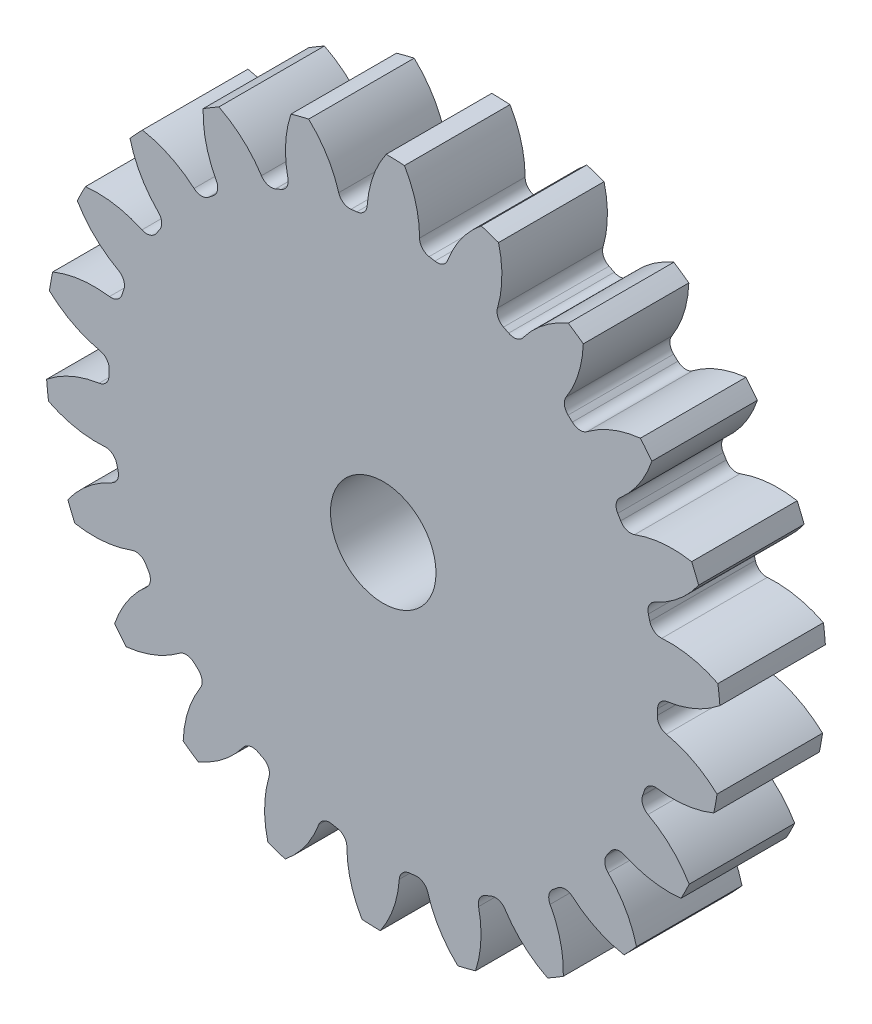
ISO-10303-21;
HEADER;
FILE_DESCRIPTION(('STEP AP214'),'2;1');
FILE_NAME('part.step','',(''),(''),'','','');
FILE_SCHEMA(('AUTOMOTIVE_DESIGN { 1 0 10303 214 1 1 1 1 }'));
ENDSEC;
DATA;
#1=APPLICATION_CONTEXT('core data for automotive mechanical design processes');
#2=APPLICATION_PROTOCOL_DEFINITION('international standard','automotive_design',2000,#1);
#3=PRODUCT_CONTEXT('',#1,'mechanical');
#4=PRODUCT('Part','Part','',(#3));
#5=PRODUCT_RELATED_PRODUCT_CATEGORY('part','',(#4));
#6=PRODUCT_DEFINITION_FORMATION('','',#4);
#7=PRODUCT_DEFINITION_CONTEXT('part definition',#1,'design');
#8=PRODUCT_DEFINITION('design','',#6,#7);
#9=PRODUCT_DEFINITION_SHAPE('','',#8);
#10=(LENGTH_UNIT() NAMED_UNIT(*) SI_UNIT(.MILLI.,.METRE.));
#11=(NAMED_UNIT(*) PLANE_ANGLE_UNIT() SI_UNIT($,.RADIAN.));
#12=(NAMED_UNIT(*) SI_UNIT($,.STERADIAN.) SOLID_ANGLE_UNIT());
#13=UNCERTAINTY_MEASURE_WITH_UNIT(LENGTH_MEASURE(1.E-05),#10,'distance_accuracy_value','');
#14=(GEOMETRIC_REPRESENTATION_CONTEXT(3) GLOBAL_UNCERTAINTY_ASSIGNED_CONTEXT((#13)) GLOBAL_UNIT_ASSIGNED_CONTEXT((#10,
#11,#12)) REPRESENTATION_CONTEXT('',''));
#15=CARTESIAN_POINT('',(0.,0.,0.));
#16=DIRECTION('',(0.,0.,1.));
#17=DIRECTION('',(1.,0.,0.));
#18=AXIS2_PLACEMENT_3D('',#15,#16,#17);
#19=CARTESIAN_POINT('',(0.,0.,127.));
#20=DIRECTION('',(0.,0.,-1.));
#21=DIRECTION('',(-1.,0.,0.));
#22=AXIS2_PLACEMENT_3D('',#19,#20,#21);
#23=CYLINDRICAL_SURFACE('',#22,406.4);
#24=DIRECTION('',(0.,0.,-1.));
#25=VECTOR('',#24,1.);
#26=CARTESIAN_POINT('',(402.756921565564,54.293849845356,63.5));
#27=LINE('',#26,#25);
#28=CARTESIAN_POINT('',(402.756921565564,54.293849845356,127.));
#29=VERTEX_POINT('',#28);
#30=CARTESIAN_POINT('',(402.756921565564,54.293849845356,0.));
#31=VERTEX_POINT('',#30);
#32=EDGE_CURVE('E888',#29,#31,#27,.T.);
#33=ORIENTED_EDGE('',*,*,#32,.F.);
#34=CARTESIAN_POINT('',(0.,0.,127.));
#35=DIRECTION('',(0.,0.,1.));
#36=DIRECTION('',(1.,0.,0.));
#37=AXIS2_PLACEMENT_3D('',#34,#35,#36);
#38=CIRCLE('',#37,406.4);
#39=CARTESIAN_POINT('',(405.103749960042,32.433189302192,127.));
#40=VERTEX_POINT('',#39);
#41=EDGE_CURVE('E1685',#40,#29,#38,.T.);
#42=ORIENTED_EDGE('',*,*,#41,.F.);
#43=DIRECTION('',(0.,0.,-1.));
#44=VECTOR('',#43,1.);
#45=CARTESIAN_POINT('',(405.103749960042,32.433189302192,63.5));
#46=LINE('',#45,#44);
#47=CARTESIAN_POINT('',(405.103749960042,32.433189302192,0.));
#48=VERTEX_POINT('',#47);
#49=EDGE_CURVE('E1679',#48,#40,#46,.F.);
#50=ORIENTED_EDGE('',*,*,#49,.F.);
#51=CARTESIAN_POINT('',(0.,0.,0.));
#52=DIRECTION('',(0.,0.,1.));
#53=DIRECTION('',(1.,0.,0.));
#54=AXIS2_PLACEMENT_3D('',#51,#52,#53);
#55=CIRCLE('',#54,406.4);
#56=EDGE_CURVE('E1690',#48,#31,#55,.T.);
#57=ORIENTED_EDGE('',*,*,#56,.T.);
#58=EDGE_LOOP('',(#33,#42,#50,#57));
#59=FACE_BOUND('',#58,.T.);
#60=ADVANCED_FACE('F33',(#59),#23,.T.);
#61=DIRECTION('',(0.,0.,-1.));
#62=VECTOR('',#61,1.);
#63=CARTESIAN_POINT('',(379.556716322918,145.250332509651,63.5));
#64=LINE('',#63,#62);
#65=CARTESIAN_POINT('',(379.556716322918,145.250332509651,0.));
#66=VERTEX_POINT('',#65);
#67=CARTESIAN_POINT('',(379.556716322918,145.250332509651,127.));
#68=VERTEX_POINT('',#67);
#69=EDGE_CURVE('E859',#66,#68,#64,.F.);
#70=ORIENTED_EDGE('',*,*,#69,.F.);
#71=CARTESIAN_POINT('',(371.146091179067,165.56430473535,0.));
#72=VERTEX_POINT('',#71);
#73=EDGE_CURVE('E1693',#66,#72,#55,.T.);
#74=ORIENTED_EDGE('',*,*,#73,.T.);
#75=DIRECTION('',(0.,0.,-1.));
#76=VECTOR('',#75,1.);
#77=CARTESIAN_POINT('',(371.146091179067,165.56430473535,63.5));
#78=LINE('',#77,#76);
#79=CARTESIAN_POINT('',(371.146091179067,165.56430473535,127.));
#80=VERTEX_POINT('',#79);
#81=EDGE_CURVE('E921',#80,#72,#78,.T.);
#82=ORIENTED_EDGE('',*,*,#81,.F.);
#83=EDGE_CURVE('E1688',#68,#80,#38,.T.);
#84=ORIENTED_EDGE('',*,*,#83,.F.);
#85=EDGE_LOOP('',(#70,#74,#82,#84));
#86=FACE_BOUND('',#85,.T.);
#87=ADVANCED_FACE('F1941',(#86),#23,.T.);
#88=CARTESIAN_POINT('',(0.,0.,127.));
#89=DIRECTION('',(0.,0.,1.));
#90=DIRECTION('',(1.,0.,0.));
#91=AXIS2_PLACEMENT_3D('',#88,#89,#90);
#92=PLANE('',#91);
#93=CARTESIAN_POINT('',(0.,0.,127.000000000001));
#94=DIRECTION('',(0.,0.,1.));
#95=DIRECTION('',(1.,0.,0.));
#96=AXIS2_PLACEMENT_3D('',#93,#94,#95);
#97=CIRCLE('',#96,63.5);
#98=CARTESIAN_POINT('',(63.5,0.,127.000000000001));
#99=VERTEX_POINT('',#98);
#100=EDGE_CURVE('E876',#99,#99,#97,.T.);
#101=ORIENTED_EDGE('',*,*,#100,.F.);
#102=EDGE_LOOP('',(#101));
#103=FACE_BOUND('',#102,.T.);
#104=ORIENTED_EDGE('',*,*,#41,.T.);
#105=CARTESIAN_POINT('',(344.485352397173,-62.2625367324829,127.));
#106=DIRECTION('',(0.,0.,-1.));
#107=DIRECTION('',(0.959492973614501,0.281732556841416,0.));
#108=AXIS2_PLACEMENT_3D('',#105,#106,#107);
#109=CIRCLE('',#108,130.311039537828);
#110=CARTESIAN_POINT('',(335.182106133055,67.7159870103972,127.));
#111=VERTEX_POINT('',#110);
#112=EDGE_CURVE('E868',#111,#29,#109,.T.);
#113=ORIENTED_EDGE('',*,*,#112,.F.);
#114=CARTESIAN_POINT('',(334.198049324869,81.4645482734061,127.));
#115=DIRECTION('',(0.,0.,1.));
#116=DIRECTION('',(-0.959492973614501,-0.281732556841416,0.));
#117=AXIS2_PLACEMENT_3D('',#114,#115,#116);
#118=CIRCLE('',#117,13.7837333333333);
#119=CARTESIAN_POINT('',(320.806437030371,78.200191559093,127.));
#120=VERTEX_POINT('',#119);
#121=EDGE_CURVE('E866',#120,#111,#118,.T.);
#122=ORIENTED_EDGE('',*,*,#121,.F.);
#123=CARTESIAN_POINT('',(0.,0.,127.));
#124=DIRECTION('',(0.,0.,-1.));
#125=DIRECTION('',(0.959492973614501,0.281732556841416,0.));
#126=AXIS2_PLACEMENT_3D('',#123,#124,#125);
#127=CIRCLE('',#126,330.2);
#128=CARTESIAN_POINT('',(319.068865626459,85.0123460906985,127.));
#129=VERTEX_POINT('',#128);
#130=EDGE_CURVE('E851',#129,#120,#127,.T.);
#131=ORIENTED_EDGE('',*,*,#130,.F.);
#132=CARTESIAN_POINT('',(332.387945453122,88.5610665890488,127.));
#133=DIRECTION('',(0.,0.,1.));
#134=DIRECTION('',(-0.959492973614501,-0.281732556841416,0.));
#135=AXIS2_PLACEMENT_3D('',#132,#133,#134);
#136=CIRCLE('',#135,13.7837333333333);
#137=CARTESIAN_POINT('',(326.666544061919,101.101276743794,127.));
#138=VERTEX_POINT('',#137);
#139=EDGE_CURVE('E843',#138,#129,#136,.T.);
#140=ORIENTED_EDGE('',*,*,#139,.F.);
#141=CARTESIAN_POINT('',(272.576571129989,219.6560820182,127.));
#142=DIRECTION('',(0.,0.,-1.));
#143=DIRECTION('',(-0.959492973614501,-0.281732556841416,0.));
#144=AXIS2_PLACEMENT_3D('',#141,#142,#143);
#145=CIRCLE('',#144,130.311039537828);
#146=EDGE_CURVE('E873',#68,#138,#145,.T.);
#147=ORIENTED_EDGE('',*,*,#146,.F.);
#148=ORIENTED_EDGE('',*,*,#83,.T.);
#149=CARTESIAN_POINT('',(348.072658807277,37.3122726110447,127.));
#150=DIRECTION('',(0.,0.,-1.));
#151=DIRECTION('',(0.841253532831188,0.540640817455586,0.));
#152=AXIS2_PLACEMENT_3D('',#149,#150,#151);
#153=CIRCLE('',#152,130.311039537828);
#154=CARTESIAN_POINT('',(302.527077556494,159.404725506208,127.));
#155=VERTEX_POINT('',#154);
#156=EDGE_CURVE('E897',#155,#80,#153,.T.);
#157=ORIENTED_EDGE('',*,*,#156,.F.);
#158=CARTESIAN_POINT('',(297.709464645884,172.319132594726,127.));
#159=DIRECTION('',(0.,0.,1.));
#160=DIRECTION('',(-0.841253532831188,-0.540640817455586,0.));
#161=AXIS2_PLACEMENT_3D('',#158,#159,#160);
#162=CIRCLE('',#161,13.7837333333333);
#163=CARTESIAN_POINT('',(285.779982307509,165.414152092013,127.));
#164=VERTEX_POINT('',#163);
#165=EDGE_CURVE('E895',#164,#155,#162,.T.);
#166=ORIENTED_EDGE('',*,*,#165,.F.);
#167=CARTESIAN_POINT('',(0.,0.,127.));
#168=DIRECTION('',(0.,0.,-1.));
#169=DIRECTION('',(0.841253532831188,0.540640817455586,0.));
#170=AXIS2_PLACEMENT_3D('',#167,#168,#169);
#171=CIRCLE('',#170,330.2);
#172=CARTESIAN_POINT('',(282.193589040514,171.460836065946,127.));
#173=VERTEX_POINT('',#172);
#174=EDGE_CURVE('E892',#173,#164,#171,.T.);
#175=ORIENTED_EDGE('',*,*,#174,.F.);
#176=CARTESIAN_POINT('',(293.973362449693,178.618226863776,127.));
#177=DIRECTION('',(0.,0.,1.));
#178=DIRECTION('',(-0.841253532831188,-0.540640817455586,0.));
#179=AXIS2_PLACEMENT_3D('',#176,#177,#178);
#180=CIRCLE('',#179,13.7837333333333);
#181=CARTESIAN_POINT('',(284.950732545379,189.038565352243,127.));
#182=VERTEX_POINT('',#181);
#183=EDGE_CURVE('E890',#182,#173,#180,.T.);
#184=ORIENTED_EDGE('',*,*,#183,.F.);
#185=CARTESIAN_POINT('',(199.651035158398,287.552161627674,127.));
#186=DIRECTION('',(0.,0.,-1.));
#187=DIRECTION('',(-0.841253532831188,-0.540640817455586,0.));
#188=AXIS2_PLACEMENT_3D('',#185,#186,#187);
#189=CIRCLE('',#188,130.311039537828);
#190=CARTESIAN_POINT('',(323.260254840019,246.300157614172,127.));
#191=VERTEX_POINT('',#190);
#192=EDGE_CURVE('E900',#191,#182,#189,.T.);
#193=ORIENTED_EDGE('',*,*,#192,.F.);
#194=CARTESIAN_POINT('',(309.467211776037,263.421724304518,127.));
#195=VERTEX_POINT('',#194);
#196=EDGE_CURVE('E1745',#191,#195,#38,.T.);
#197=ORIENTED_EDGE('',*,*,#196,.T.);
#198=CARTESIAN_POINT('',(323.461188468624,133.864263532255,127.));
#199=DIRECTION('',(0.,0.,-1.));
#200=DIRECTION('',(0.654860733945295,0.75574957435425,0.));
#201=AXIS2_PLACEMENT_3D('',#198,#199,#200);
#202=CIRCLE('',#201,130.311039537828);
#203=CARTESIAN_POINT('',(245.363104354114,238.179441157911,127.));
#204=VERTEX_POINT('',#203);
#205=EDGE_CURVE('E932',#204,#195,#202,.T.);
#206=ORIENTED_EDGE('',*,*,#205,.F.);
#207=CARTESIAN_POINT('',(237.10222968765,249.213445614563,127.));
#208=DIRECTION('',(0.,0.,1.));
#209=DIRECTION('',(-0.654860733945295,-0.75574957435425,0.));
#210=AXIS2_PLACEMENT_3D('',#207,#208,#209);
#211=CIRCLE('',#210,13.7837333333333);
#212=CARTESIAN_POINT('',(227.601333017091,239.22724177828,127.));
#213=VERTEX_POINT('',#212);
#214=EDGE_CURVE('E930',#213,#204,#211,.T.);
#215=ORIENTED_EDGE('',*,*,#214,.F.);
#216=CARTESIAN_POINT('',(0.,0.,127.));
#217=DIRECTION('',(0.,0.,-1.));
#218=DIRECTION('',(0.654860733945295,0.75574957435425,0.));
#219=AXIS2_PLACEMENT_3D('',#216,#217,#218);
#220=CIRCLE('',#219,330.2);
#221=CARTESIAN_POINT('',(222.456666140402,244.018588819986,127.));
#222=VERTEX_POINT('',#221);
#223=EDGE_CURVE('E927',#222,#213,#220,.T.);
#224=ORIENTED_EDGE('',*,*,#223,.F.);
#225=CARTESIAN_POINT('',(231.742805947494,254.204800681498,127.));
#226=DIRECTION('',(0.,0.,1.));
#227=DIRECTION('',(-0.654860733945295,-0.75574957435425,0.));
#228=AXIS2_PLACEMENT_3D('',#225,#226,#227);
#229=CIRCLE('',#228,13.7837333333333);
#230=CARTESIAN_POINT('',(220.149907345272,261.661073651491,127.));
#231=VERTEX_POINT('',#230);
#232=EDGE_CURVE('E925',#231,#222,#229,.T.);
#233=ORIENTED_EDGE('',*,*,#232,.F.);
#234=CARTESIAN_POINT('',(110.550959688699,332.152475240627,127.));
#235=DIRECTION('',(0.,0.,-1.));
#236=DIRECTION('',(-0.654860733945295,-0.75574957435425,0.));
#237=AXIS2_PLACEMENT_3D('',#234,#235,#236);
#238=CIRCLE('',#237,130.311039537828);
#239=CARTESIAN_POINT('',(240.775170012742,327.396208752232,127.));
#240=VERTEX_POINT('',#239);
#241=EDGE_CURVE('E935',#240,#231,#238,.T.);
#242=ORIENTED_EDGE('',*,*,#241,.F.);
#243=CARTESIAN_POINT('',(222.717139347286,339.938282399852,127.));
#244=VERTEX_POINT('',#243);
#245=EDGE_CURVE('E1923',#240,#244,#38,.T.);
#246=ORIENTED_EDGE('',*,*,#245,.T.);
#247=CARTESIAN_POINT('',(272.644816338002,219.571367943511,127.));
#248=DIRECTION('',(0.,0.,-1.));
#249=DIRECTION('',(0.415415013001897,0.909631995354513,0.));
#250=AXIS2_PLACEMENT_3D('',#247,#248,#249);
#251=CIRCLE('',#250,130.311039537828);
#252=CARTESIAN_POINT('',(168.321271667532,297.658274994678,127.));
#253=VERTEX_POINT('',#252);
#254=EDGE_CURVE('E970',#253,#244,#251,.T.);
#255=ORIENTED_EDGE('',*,*,#254,.F.);
#256=CARTESIAN_POINT('',(157.286382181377,305.917967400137,127.));
#257=DIRECTION('',(0.,0.,1.));
#258=DIRECTION('',(-0.415415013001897,-0.909631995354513,0.));
#259=AXIS2_PLACEMENT_3D('',#256,#257,#258);
#260=CIRCLE('',#259,13.7837333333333);
#261=CARTESIAN_POINT('',(150.983777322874,293.659563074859,127.));
#262=VERTEX_POINT('',#261);
#263=EDGE_CURVE('E968',#262,#253,#260,.T.);
#264=ORIENTED_EDGE('',*,*,#263,.F.);
#265=CARTESIAN_POINT('',(0.,0.,127.));
#266=DIRECTION('',(0.,0.,-1.));
#267=DIRECTION('',(0.415415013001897,0.909631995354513,0.));
#268=AXIS2_PLACEMENT_3D('',#265,#266,#267);
#269=CIRCLE('',#268,330.2);
#270=CARTESIAN_POINT('',(144.697627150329,296.807406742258,127.));
#271=VERTEX_POINT('',#270);
#272=EDGE_CURVE('E965',#271,#262,#269,.T.);
#273=ORIENTED_EDGE('',*,*,#272,.F.);
#274=CARTESIAN_POINT('',(150.737825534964,309.197213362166,127.));
#275=DIRECTION('',(0.,0.,1.));
#276=DIRECTION('',(-0.415415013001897,-0.909631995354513,0.));
#277=AXIS2_PLACEMENT_3D('',#274,#275,#276);
#278=CIRCLE('',#277,13.7837333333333);
#279=CARTESIAN_POINT('',(137.513845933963,313.085357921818,127.));
#280=VERTEX_POINT('',#279);
#281=EDGE_CURVE('E963',#280,#271,#278,.T.);
#282=ORIENTED_EDGE('',*,*,#281,.F.);
#283=CARTESIAN_POINT('',(12.494702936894,349.843770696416,127.));
#284=DIRECTION('',(0.,0.,-1.));
#285=DIRECTION('',(-0.415415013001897,-0.909631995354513,0.));
#286=AXIS2_PLACEMENT_3D('',#283,#284,#285);
#287=CIRCLE('',#286,130.311039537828);
#288=CARTESIAN_POINT('',(138.783912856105,381.968566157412,127.));
#289=VERTEX_POINT('',#288);
#290=EDGE_CURVE('E973',#289,#280,#287,.T.);
#291=ORIENTED_EDGE('',*,*,#290,.F.);
#292=CARTESIAN_POINT('',(117.923848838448,388.915062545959,127.));
#293=VERTEX_POINT('',#292);
#294=EDGE_CURVE('E1919',#289,#293,#38,.T.);
#295=ORIENTED_EDGE('',*,*,#294,.T.);
#296=CARTESIAN_POINT('',(199.740382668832,287.49010596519,127.));
#297=DIRECTION('',(0.,0.,-1.));
#298=DIRECTION('',(0.142314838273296,0.989821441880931,0.));
#299=AXIS2_PLACEMENT_3D('',#296,#297,#298);
#300=CIRCLE('',#299,130.311039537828);
#301=CARTESIAN_POINT('',(77.6430505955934,333.0226056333,127.));
#302=VERTEX_POINT('',#301);
#303=EDGE_CURVE('E1008',#302,#293,#300,.T.);
#304=ORIENTED_EDGE('',*,*,#303,.F.);
#305=CARTESIAN_POINT('',(64.7281274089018,337.838834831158,127.));
#306=DIRECTION('',(0.,0.,1.));
#307=DIRECTION('',(-0.142314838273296,-0.989821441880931,0.));
#308=AXIS2_PLACEMENT_3D('',#305,#306,#307);
#309=CIRCLE('',#308,13.7837333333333);
#310=CARTESIAN_POINT('',(62.1344139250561,324.30133303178,127.));
#311=VERTEX_POINT('',#310);
#312=EDGE_CURVE('E1006',#311,#302,#309,.T.);
#313=ORIENTED_EDGE('',*,*,#312,.F.);
#314=CARTESIAN_POINT('',(0.,0.,127.));
#315=DIRECTION('',(0.,0.,-1.));
#316=DIRECTION('',(0.142314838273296,0.989821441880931,0.));
#317=AXIS2_PLACEMENT_3D('',#314,#315,#316);
#318=CIRCLE('',#317,330.2);
#319=CARTESIAN_POINT('',(55.2160469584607,325.550653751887,127.));
#320=VERTEX_POINT('',#319);
#321=EDGE_CURVE('E1003',#320,#311,#318,.T.);
#322=ORIENTED_EDGE('',*,*,#321,.F.);
#323=CARTESIAN_POINT('',(57.5209629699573,339.140306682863,127.));
#324=DIRECTION('',(0.,0.,1.));
#325=DIRECTION('',(-0.142314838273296,-0.989821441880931,0.));
#326=AXIS2_PLACEMENT_3D('',#323,#324,#325);
#327=CIRCLE('',#326,13.7837333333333);
#328=CARTESIAN_POINT('',(43.7372305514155,339.145328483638,127.));
#329=VERTEX_POINT('',#328);
#330=EDGE_CURVE('E1001',#329,#320,#327,.T.);
#331=ORIENTED_EDGE('',*,*,#330,.F.);
#332=CARTESIAN_POINT('',(-86.5738003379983,339.192804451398,127.));
#333=DIRECTION('',(0.,0.,-1.));
#334=DIRECTION('',(-0.142314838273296,-0.989821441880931,0.));
#335=AXIS2_PLACEMENT_3D('',#332,#333,#334);
#336=CIRCLE('',#335,130.311039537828);
#337=CARTESIAN_POINT('',(25.5492084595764,405.59610198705,127.));
#338=VERTEX_POINT('',#337);
#339=EDGE_CURVE('E1011',#338,#329,#336,.T.);
#340=ORIENTED_EDGE('',*,*,#339,.F.);
#341=CARTESIAN_POINT('',(3.57706941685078,406.384257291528,127.));
#342=VERTEX_POINT('',#341);
#343=EDGE_CURVE('E1915',#338,#342,#38,.T.);
#344=ORIENTED_EDGE('',*,*,#343,.T.);
#345=CARTESIAN_POINT('',(110.654171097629,332.118105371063,127.));
#346=DIRECTION('',(0.,0.,-1.));
#347=DIRECTION('',(-0.142314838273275,0.989821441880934,0.));
#348=AXIS2_PLACEMENT_3D('',#345,#346,#347);
#349=CIRCLE('',#348,130.311039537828);
#350=CARTESIAN_POINT('',(-19.3253486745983,341.407425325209,127.));
#351=VERTEX_POINT('',#350);
#352=EDGE_CURVE('E1046',#351,#342,#349,.T.);
#353=ORIENTED_EDGE('',*,*,#352,.F.);
#354=CARTESIAN_POINT('',(-33.0740152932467,342.390009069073,127.));
#355=DIRECTION('',(0.,0.,1.));
#356=DIRECTION('',(0.142314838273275,-0.989821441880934,0.));
#357=AXIS2_PLACEMENT_3D('',#354,#355,#356);
#358=CIRCLE('',#357,13.7837333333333);
#359=CARTESIAN_POINT('',(-31.7487101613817,328.670137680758,127.));
#360=VERTEX_POINT('',#359);
#361=EDGE_CURVE('E1044',#360,#351,#358,.T.);
#362=ORIENTED_EDGE('',*,*,#361,.F.);
#363=CARTESIAN_POINT('',(0.,0.,127.));
#364=DIRECTION('',(0.,0.,-1.));
#365=DIRECTION('',(-0.142314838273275,0.989821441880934,0.));
#366=AXIS2_PLACEMENT_3D('',#363,#364,#365);
#367=CIRCLE('',#366,330.2);
#368=CARTESIAN_POINT('',(-38.7388089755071,327.919722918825,127.));
#369=VERTEX_POINT('',#368);
#370=EDGE_CURVE('E1041',#369,#360,#367,.T.);
#371=ORIENTED_EDGE('',*,*,#370,.F.);
#372=CARTESIAN_POINT('',(-40.3559059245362,341.60826930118,127.));
#373=DIRECTION('',(0.,0.,1.));
#374=DIRECTION('',(0.142314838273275,-0.989821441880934,0.));
#375=AXIS2_PLACEMENT_3D('',#372,#373,#374);
#376=CIRCLE('',#375,13.7837333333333);
#377=CARTESIAN_POINT('',(-53.5827151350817,337.729761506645,127.));
#378=VERTEX_POINT('',#377);
#379=EDGE_CURVE('E1039',#378,#369,#376,.T.);
#380=ORIENTED_EDGE('',*,*,#379,.F.);
#381=CARTESIAN_POINT('',(-178.628609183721,301.062454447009,127.));
#382=DIRECTION('',(0.,0.,-1.));
#383=DIRECTION('',(0.142314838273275,-0.989821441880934,0.));
#384=AXIS2_PLACEMENT_3D('',#381,#382,#383);
#385=CIRCLE('',#384,130.311039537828);
#386=CARTESIAN_POINT('',(-89.7553408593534,396.364653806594,127.));
#387=VERTEX_POINT('',#386);
#388=EDGE_CURVE('E1049',#387,#378,#385,.T.);
#389=ORIENTED_EDGE('',*,*,#388,.F.);
#390=CARTESIAN_POINT('',(-111.059502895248,390.930616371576,127.));
#391=VERTEX_POINT('',#390);
#392=EDGE_CURVE('E1911',#387,#391,#38,.T.);
#393=ORIENTED_EDGE('',*,*,#392,.T.);
#394=CARTESIAN_POINT('',(12.60341666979,349.839871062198,127.));
#395=DIRECTION('',(0.,0.,-1.));
#396=DIRECTION('',(-0.415415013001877,0.909631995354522,0.));
#397=AXIS2_PLACEMENT_3D('',#394,#395,#396);
#398=CIRCLE('',#397,130.311039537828);
#399=CARTESIAN_POINT('',(-114.728123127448,322.133445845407,127.));
#400=VERTEX_POINT('',#399);
#401=EDGE_CURVE('E1084',#400,#391,#398,.T.);
#402=ORIENTED_EDGE('',*,*,#401,.F.);
#403=CARTESIAN_POINT('',(-128.196697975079,319.202781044,127.));
#404=DIRECTION('',(0.,0.,1.));
#405=DIRECTION('',(0.415415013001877,-0.909631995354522,0.));
#406=AXIS2_PLACEMENT_3D('',#403,#404,#405);
#407=CIRCLE('',#406,13.7837333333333);
#408=CARTESIAN_POINT('',(-123.059742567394,306.412042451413,127.));
#409=VERTEX_POINT('',#408);
#410=EDGE_CURVE('E1082',#409,#400,#407,.T.);
#411=ORIENTED_EDGE('',*,*,#410,.F.);
#412=CARTESIAN_POINT('',(0.,0.,127.));
#413=DIRECTION('',(0.,0.,-1.));
#414=DIRECTION('',(-0.415415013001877,0.909631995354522,0.));
#415=AXIS2_PLACEMENT_3D('',#412,#413,#414);
#416=CIRCLE('',#415,330.2);
#417=CARTESIAN_POINT('',(-129.555276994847,303.722686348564,127.));
#418=VERTEX_POINT('',#417);
#419=EDGE_CURVE('E1079',#418,#409,#416,.T.);
#420=ORIENTED_EDGE('',*,*,#419,.F.);
#421=CARTESIAN_POINT('',(-134.963379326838,316.40116156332,127.));
#422=DIRECTION('',(0.,0.,1.));
#423=DIRECTION('',(0.415415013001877,-0.909631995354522,0.));
#424=AXIS2_PLACEMENT_3D('',#421,#422,#423);
#425=CIRCLE('',#424,13.7837333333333);
#426=CARTESIAN_POINT('',(-146.561707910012,308.953337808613,127.));
#427=VERTEX_POINT('',#426);
#428=EDGE_CURVE('E1077',#427,#418,#425,.T.);
#429=ORIENTED_EDGE('',*,*,#428,.F.);
#430=CARTESIAN_POINT('',(-256.211990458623,238.541814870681,127.));
#431=DIRECTION('',(0.,0.,-1.));
#432=DIRECTION('',(0.415415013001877,-0.909631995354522,0.));
#433=AXIS2_PLACEMENT_3D('',#430,#431,#432);
#434=CIRCLE('',#433,130.311039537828);
#435=CARTESIAN_POINT('',(-197.788446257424,355.02209864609,127.));
#436=VERTEX_POINT('',#435);
#437=EDGE_CURVE('E1087',#436,#427,#434,.T.);
#438=ORIENTED_EDGE('',*,*,#437,.F.);
#439=CARTESIAN_POINT('',(-216.69869477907,343.806101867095,127.));
#440=VERTEX_POINT('',#439);
#441=EDGE_CURVE('E1907',#436,#440,#38,.T.);
#442=ORIENTED_EDGE('',*,*,#441,.T.);
#443=CARTESIAN_POINT('',(-86.4683916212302,339.219690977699,127.));
#444=DIRECTION('',(0.,0.,-1.));
#445=DIRECTION('',(-0.654860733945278,0.755749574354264,0.));
#446=AXIS2_PLACEMENT_3D('',#443,#444,#445);
#447=CIRCLE('',#446,130.311039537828);
#448=CARTESIAN_POINT('',(-200.836307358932,276.76213038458,127.));
#449=VERTEX_POINT('',#448);
#450=EDGE_CURVE('E1122',#449,#440,#447,.T.);
#451=ORIENTED_EDGE('',*,*,#450,.F.);
#452=CARTESIAN_POINT('',(-212.93364660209,270.155642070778,127.));
#453=DIRECTION('',(0.,0.,1.));
#454=DIRECTION('',(0.654860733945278,-0.755749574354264,0.));
#455=AXIS2_PLACEMENT_3D('',#452,#453,#454);
#456=CIRCLE('',#455,13.7837333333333);
#457=CARTESIAN_POINT('',(-204.401206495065,259.330265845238,127.));
#458=VERTEX_POINT('',#457);
#459=EDGE_CURVE('E1120',#458,#449,#456,.T.);
#460=ORIENTED_EDGE('',*,*,#459,.F.);
#461=CARTESIAN_POINT('',(0.,0.,127.));
#462=DIRECTION('',(0.,0.,-1.));
#463=DIRECTION('',(-0.654860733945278,0.755749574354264,0.));
#464=AXIS2_PLACEMENT_3D('',#461,#462,#463);
#465=CIRCLE('',#464,330.2);
#466=CARTESIAN_POINT('',(-209.875946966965,254.919844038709,127.));
#467=VERTEX_POINT('',#466);
#468=EDGE_CURVE('E1117',#467,#458,#465,.T.);
#469=ORIENTED_EDGE('',*,*,#468,.F.);
#470=CARTESIAN_POINT('',(-218.636922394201,265.561113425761,127.));
#471=DIRECTION('',(0.,0.,1.));
#472=DIRECTION('',(0.654860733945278,-0.755749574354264,0.));
#473=AXIS2_PLACEMENT_3D('',#470,#471,#472);
#474=CIRCLE('',#473,13.7837333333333);
#475=CARTESIAN_POINT('',(-227.667142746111,255.147352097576,127.));
#476=VERTEX_POINT('',#475);
#477=EDGE_CURVE('E1115',#476,#467,#474,.T.);
#478=ORIENTED_EDGE('',*,*,#477,.F.);
#479=CARTESIAN_POINT('',(-313.038600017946,156.695936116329,127.));
#480=DIRECTION('',(0.,0.,-1.));
#481=DIRECTION('',(0.654860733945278,-0.755749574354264,0.));
#482=AXIS2_PLACEMENT_3D('',#479,#480,#481);
#483=CIRCLE('',#482,130.311039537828);
#484=CARTESIAN_POINT('',(-289.7979080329,284.917764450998,127.));
#485=VERTEX_POINT('',#484);
#486=EDGE_CURVE('E1125',#485,#476,#483,.T.);
#487=ORIENTED_EDGE('',*,*,#486,.F.);
#488=CARTESIAN_POINT('',(-304.782247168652,268.82846168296,127.));
#489=VERTEX_POINT('',#488);
#490=EDGE_CURVE('E1903',#485,#489,#38,.T.);
#491=ORIENTED_EDGE('',*,*,#490,.T.);
#492=CARTESIAN_POINT('',(-178.535045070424,301.117948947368,127.));
#493=DIRECTION('',(0.,0.,-1.));
#494=DIRECTION('',(-0.841253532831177,0.540640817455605,0.));
#495=AXIS2_PLACEMENT_3D('',#492,#493,#494);
#496=CIRCLE('',#495,130.311039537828);
#497=CARTESIAN_POINT('',(-270.673928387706,208.96919308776,127.));
#498=VERTEX_POINT('',#497);
#499=EDGE_CURVE('E1160',#498,#489,#496,.T.);
#500=ORIENTED_EDGE('',*,*,#499,.F.);
#501=CARTESIAN_POINT('',(-280.419977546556,199.222099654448,127.));
#502=DIRECTION('',(0.,0.,1.));
#503=DIRECTION('',(0.841253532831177,-0.540640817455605,0.));
#504=AXIS2_PLACEMENT_3D('',#501,#502,#503);
#505=CIRCLE('',#504,13.7837333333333);
#506=CARTESIAN_POINT('',(-269.183300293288,191.239093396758,127.));
#507=VERTEX_POINT('',#506);
#508=EDGE_CURVE('E1158',#507,#498,#505,.T.);
#509=ORIENTED_EDGE('',*,*,#508,.F.);
#510=CARTESIAN_POINT('',(0.,0.,127.));
#511=DIRECTION('',(0.,0.,-1.));
#512=DIRECTION('',(-0.841253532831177,0.540640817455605,0.));
#513=AXIS2_PLACEMENT_3D('',#510,#511,#512);
#514=CIRCLE('',#513,330.2);
#515=CARTESIAN_POINT('',(-273.193715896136,185.464912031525,127.));
#516=VERTEX_POINT('',#515);
#517=EDGE_CURVE('E1155',#516,#507,#514,.T.);
#518=ORIENTED_EDGE('',*,*,#517,.F.);
#519=CARTESIAN_POINT('',(-284.597802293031,193.2068832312,127.));
#520=DIRECTION('',(0.,0.,1.));
#521=DIRECTION('',(0.841253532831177,-0.540640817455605,0.));
#522=AXIS2_PLACEMENT_3D('',#519,#520,#521);
#523=CIRCLE('',#522,13.7837333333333);
#524=CARTESIAN_POINT('',(-290.328339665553,180.670845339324,127.));
#525=VERTEX_POINT('',#524);
#526=EDGE_CURVE('E1153',#525,#516,#523,.T.);
#527=ORIENTED_EDGE('',*,*,#526,.F.);
#528=CARTESIAN_POINT('',(-344.504683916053,62.1554845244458,127.));
#529=DIRECTION('',(0.,0.,-1.));
#530=DIRECTION('',(0.841253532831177,-0.540640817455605,0.));
#531=AXIS2_PLACEMENT_3D('',#528,#529,#530);
#532=CIRCLE('',#531,130.311039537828);
#533=CARTESIAN_POINT('',(-358.329666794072,191.731087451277,127.));
#534=VERTEX_POINT('',#533);
#535=EDGE_CURVE('E1163',#534,#525,#532,.T.);
#536=ORIENTED_EDGE('',*,*,#535,.F.);
#537=CARTESIAN_POINT('',(-368.174154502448,172.071938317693,127.));
#538=VERTEX_POINT('',#537);
#539=EDGE_CURVE('E1899',#534,#538,#38,.T.);
#540=ORIENTED_EDGE('',*,*,#539,.T.);
#541=CARTESIAN_POINT('',(-256.137850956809,238.621421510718,127.));
#542=DIRECTION('',(0.,0.,-1.));
#543=DIRECTION('',(-0.959492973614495,0.281732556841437,0.));
#544=AXIS2_PLACEMENT_3D('',#541,#542,#543);
#545=CIRCLE('',#544,130.311039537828);
#546=CARTESIAN_POINT('',(-318.583157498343,124.246814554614,127.));
#547=VERTEX_POINT('',#546);
#548=EDGE_CURVE('E1198',#547,#538,#545,.T.);
#549=ORIENTED_EDGE('',*,*,#548,.F.);
#550=CARTESIAN_POINT('',(-325.188349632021,112.148767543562,127.));
#551=DIRECTION('',(0.,0.,1.));
#552=DIRECTION('',(0.959492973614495,-0.281732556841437,0.));
#553=AXIS2_PLACEMENT_3D('',#550,#551,#552);
#554=CIRCLE('',#553,13.7837333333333);
#555=CARTESIAN_POINT('',(-312.157763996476,107.654866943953,127.));
#556=VERTEX_POINT('',#555);
#557=EDGE_CURVE('E1196',#556,#547,#554,.T.);
#558=ORIENTED_EDGE('',*,*,#557,.F.);
#559=CARTESIAN_POINT('',(0.,0.,127.));
#560=DIRECTION('',(0.,0.,-1.));
#561=DIRECTION('',(-0.959492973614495,0.281732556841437,0.));
#562=AXIS2_PLACEMENT_3D('',#559,#560,#561);
#563=CIRCLE('',#562,330.2);
#564=CARTESIAN_POINT('',(-314.37895470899,100.98471585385,127.));
#565=VERTEX_POINT('',#564);
#566=EDGE_CURVE('E1193',#565,#556,#563,.T.);
#567=ORIENTED_EDGE('',*,*,#566,.F.);
#568=CARTESIAN_POINT('',(-327.502260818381,105.200180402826,127.));
#569=DIRECTION('',(0.,0.,1.));
#570=DIRECTION('',(0.959492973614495,-0.281732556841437,0.));
#571=AXIS2_PLACEMENT_3D('',#568,#569,#570);
#572=CIRCLE('',#571,13.7837333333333);
#573=CARTESIAN_POINT('',(-329.468861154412,91.5574611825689,127.));
#574=VERTEX_POINT('',#573);
#575=EDGE_CURVE('E1191',#574,#565,#572,.T.);
#576=ORIENTED_EDGE('',*,*,#575,.F.);
#577=CARTESIAN_POINT('',(-348.061047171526,-37.4204347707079,127.));
#578=DIRECTION('',(0.,0.,-1.));
#579=DIRECTION('',(0.959492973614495,-0.281732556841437,0.));
#580=AXIS2_PLACEMENT_3D('',#577,#578,#579);
#581=CIRCLE('',#580,130.311039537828);
#582=CARTESIAN_POINT('',(-397.831687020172,83.0114980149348,127.));
#583=VERTEX_POINT('',#582);
#584=EDGE_CURVE('E1201',#583,#574,#581,.T.);
#585=ORIENTED_EDGE('',*,*,#584,.F.);
#586=CARTESIAN_POINT('',(-401.738781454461,61.3751698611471,127.));
#587=VERTEX_POINT('',#586);
#588=EDGE_CURVE('E1895',#583,#587,#38,.T.);
#589=ORIENTED_EDGE('',*,*,#588,.T.);
#590=CARTESIAN_POINT('',(-312.989891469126,156.793205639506,127.));
#591=DIRECTION('',(0.,0.,-1.));
#592=DIRECTION('',(-1.,0.,0.));
#593=AXIS2_PLACEMENT_3D('',#590,#591,#592);
#594=CIRCLE('',#593,130.311039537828);
#595=CARTESIAN_POINT('',(-340.682673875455,29.458698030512,127.));
#596=VERTEX_POINT('',#595);
#597=EDGE_CURVE('E1236',#596,#587,#594,.T.);
#598=ORIENTED_EDGE('',*,*,#597,.F.);
#599=CARTESIAN_POINT('',(-343.611895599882,15.9898092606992,127.));
#600=DIRECTION('',(0.,0.,1.));
#601=DIRECTION('',(1.,0.,0.));
#602=AXIS2_PLACEMENT_3D('',#599,#600,#601);
#603=CIRCLE('',#602,13.7837333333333);
#604=CARTESIAN_POINT('',(-329.843062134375,15.3490834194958,127.));
#605=VERTEX_POINT('',#604);
#606=EDGE_CURVE('E1234',#605,#596,#603,.T.);
#607=ORIENTED_EDGE('',*,*,#606,.F.);
#608=CARTESIAN_POINT('',(0.,0.,127.));
#609=DIRECTION('',(0.,0.,-1.));
#610=DIRECTION('',(-1.,0.,0.));
#611=AXIS2_PLACEMENT_3D('',#608,#609,#610);
#612=CIRCLE('',#611,330.2);
#613=CARTESIAN_POINT('',(-330.095080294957,8.32333857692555,127.));
#614=VERTEX_POINT('',#613);
#615=EDGE_CURVE('E1231',#614,#605,#612,.T.);
#616=ORIENTED_EDGE('',*,*,#615,.F.);
#617=CARTESIAN_POINT('',(-343.874433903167,8.67078460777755,127.));
#618=DIRECTION('',(0.,0.,1.));
#619=DIRECTION('',(1.,0.,0.));
#620=AXIS2_PLACEMENT_3D('',#617,#618,#619);
#621=CIRCLE('',#620,13.7837333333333);
#622=CARTESIAN_POINT('',(-341.917774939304,-4.9733639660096,127.));
#623=VERTEX_POINT('',#622);
#624=EDGE_CURVE('E1229',#623,#614,#621,.T.);
#625=ORIENTED_EDGE('',*,*,#624,.F.);
#626=CARTESIAN_POINT('',(-323.419574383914,-133.964772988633,127.));
#627=DIRECTION('',(0.,0.,-1.));
#628=DIRECTION('',(1.,0.,0.));
#629=AXIS2_PLACEMENT_3D('',#626,#627,#628);
#630=CIRCLE('',#629,130.311039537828);
#631=CARTESIAN_POINT('',(-405.103749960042,-32.433189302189,127.));
#632=VERTEX_POINT('',#631);
#633=EDGE_CURVE('E1239',#632,#623,#630,.T.);
#634=ORIENTED_EDGE('',*,*,#633,.F.);
#635=CARTESIAN_POINT('',(-402.756921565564,-54.293849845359,127.));
#636=VERTEX_POINT('',#635);
#637=EDGE_CURVE('E1891',#632,#636,#38,.T.);
#638=ORIENTED_EDGE('',*,*,#637,.T.);
#639=CARTESIAN_POINT('',(-344.485352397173,62.2625367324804,127.));
#640=DIRECTION('',(0.,0.,-1.));
#641=DIRECTION('',(-0.959492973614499,-0.281732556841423,0.));
#642=AXIS2_PLACEMENT_3D('',#639,#640,#641);
#643=CIRCLE('',#642,130.311039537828);
#644=CARTESIAN_POINT('',(-335.182106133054,-67.7159870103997,127.));
#645=VERTEX_POINT('',#644);
#646=EDGE_CURVE('E1274',#645,#636,#643,.T.);
#647=ORIENTED_EDGE('',*,*,#646,.F.);
#648=CARTESIAN_POINT('',(-334.198049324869,-81.4645482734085,127.));
#649=DIRECTION('',(0.,0.,1.));
#650=DIRECTION('',(0.959492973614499,0.281732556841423,0.));
#651=AXIS2_PLACEMENT_3D('',#648,#649,#650);
#652=CIRCLE('',#651,13.7837333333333);
#653=CARTESIAN_POINT('',(-320.80643703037,-78.2001915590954,127.));
#654=VERTEX_POINT('',#653);
#655=EDGE_CURVE('E1272',#654,#645,#652,.T.);
#656=ORIENTED_EDGE('',*,*,#655,.F.);
#657=CARTESIAN_POINT('',(0.,0.,127.));
#658=DIRECTION('',(0.,0.,-1.));
#659=DIRECTION('',(-0.959492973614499,-0.281732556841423,0.));
#660=AXIS2_PLACEMENT_3D('',#657,#658,#659);
#661=CIRCLE('',#660,330.2);
#662=CARTESIAN_POINT('',(-319.068865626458,-85.0123460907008,127.));
#663=VERTEX_POINT('',#662);
#664=EDGE_CURVE('E1269',#663,#654,#661,.T.);
#665=ORIENTED_EDGE('',*,*,#664,.F.);
#666=CARTESIAN_POINT('',(-332.387945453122,-88.5610665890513,127.));
#667=DIRECTION('',(0.,0.,1.));
#668=DIRECTION('',(0.959492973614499,0.281732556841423,0.));
#669=AXIS2_PLACEMENT_3D('',#666,#667,#668);
#670=CIRCLE('',#669,13.7837333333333);
#671=CARTESIAN_POINT('',(-326.666544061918,-101.101276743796,127.));
#672=VERTEX_POINT('',#671);
#673=EDGE_CURVE('E1267',#672,#663,#670,.T.);
#674=ORIENTED_EDGE('',*,*,#673,.F.);
#675=CARTESIAN_POINT('',(-272.576571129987,-219.656082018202,127.));
#676=DIRECTION('',(0.,0.,-1.));
#677=DIRECTION('',(0.959492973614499,0.281732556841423,0.));
#678=AXIS2_PLACEMENT_3D('',#675,#676,#677);
#679=CIRCLE('',#678,130.311039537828);
#680=CARTESIAN_POINT('',(-379.556716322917,-145.250332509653,127.));
#681=VERTEX_POINT('',#680);
#682=EDGE_CURVE('E1277',#681,#672,#679,.T.);
#683=ORIENTED_EDGE('',*,*,#682,.F.);
#684=CARTESIAN_POINT('',(-371.146091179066,-165.564304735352,127.));
#685=VERTEX_POINT('',#684);
#686=EDGE_CURVE('E1887',#681,#685,#38,.T.);
#687=ORIENTED_EDGE('',*,*,#686,.T.);
#688=CARTESIAN_POINT('',(-348.072658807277,-37.3122726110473,127.));
#689=DIRECTION('',(0.,0.,-1.));
#690=DIRECTION('',(-0.841253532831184,-0.540640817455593,0.));
#691=AXIS2_PLACEMENT_3D('',#688,#689,#690);
#692=CIRCLE('',#691,130.311039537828);
#693=CARTESIAN_POINT('',(-302.527077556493,-159.40472550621,127.));
#694=VERTEX_POINT('',#693);
#695=EDGE_CURVE('E1312',#694,#685,#692,.T.);
#696=ORIENTED_EDGE('',*,*,#695,.F.);
#697=CARTESIAN_POINT('',(-297.709464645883,-172.319132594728,127.));
#698=DIRECTION('',(0.,0.,1.));
#699=DIRECTION('',(0.841253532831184,0.540640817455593,0.));
#700=AXIS2_PLACEMENT_3D('',#697,#698,#699);
#701=CIRCLE('',#700,13.7837333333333);
#702=CARTESIAN_POINT('',(-285.779982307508,-165.414152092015,127.));
#703=VERTEX_POINT('',#702);
#704=EDGE_CURVE('E1310',#703,#694,#701,.T.);
#705=ORIENTED_EDGE('',*,*,#704,.F.);
#706=CARTESIAN_POINT('',(0.,0.,127.));
#707=DIRECTION('',(0.,0.,-1.));
#708=DIRECTION('',(-0.841253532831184,-0.540640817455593,0.));
#709=AXIS2_PLACEMENT_3D('',#706,#707,#708);
#710=CIRCLE('',#709,330.2);
#711=CARTESIAN_POINT('',(-282.193589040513,-171.460836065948,127.));
#712=VERTEX_POINT('',#711);
#713=EDGE_CURVE('E1307',#712,#703,#710,.T.);
#714=ORIENTED_EDGE('',*,*,#713,.F.);
#715=CARTESIAN_POINT('',(-293.973362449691,-178.618226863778,127.));
#716=DIRECTION('',(0.,0.,1.));
#717=DIRECTION('',(0.841253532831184,0.540640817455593,0.));
#718=AXIS2_PLACEMENT_3D('',#715,#716,#717);
#719=CIRCLE('',#718,13.7837333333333);
#720=CARTESIAN_POINT('',(-284.950732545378,-189.038565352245,127.));
#721=VERTEX_POINT('',#720);
#722=EDGE_CURVE('E1305',#721,#712,#719,.T.);
#723=ORIENTED_EDGE('',*,*,#722,.F.);
#724=CARTESIAN_POINT('',(-199.651035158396,-287.552161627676,127.));
#725=DIRECTION('',(0.,0.,-1.));
#726=DIRECTION('',(0.841253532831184,0.540640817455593,0.));
#727=AXIS2_PLACEMENT_3D('',#724,#725,#726);
#728=CIRCLE('',#727,130.311039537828);
#729=CARTESIAN_POINT('',(-323.260254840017,-246.300157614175,127.));
#730=VERTEX_POINT('',#729);
#731=EDGE_CURVE('E1315',#730,#721,#728,.T.);
#732=ORIENTED_EDGE('',*,*,#731,.F.);
#733=CARTESIAN_POINT('',(-309.467211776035,-263.421724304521,127.));
#734=VERTEX_POINT('',#733);
#735=EDGE_CURVE('E1883',#730,#734,#38,.T.);
#736=ORIENTED_EDGE('',*,*,#735,.T.);
#737=CARTESIAN_POINT('',(-323.461188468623,-133.864263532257,127.));
#738=DIRECTION('',(0.,0.,-1.));
#739=DIRECTION('',(-0.654860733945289,-0.755749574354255,0.));
#740=AXIS2_PLACEMENT_3D('',#737,#738,#739);
#741=CIRCLE('',#740,130.311039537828);
#742=CARTESIAN_POINT('',(-245.363104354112,-238.179441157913,127.));
#743=VERTEX_POINT('',#742);
#744=EDGE_CURVE('E1350',#743,#734,#741,.T.);
#745=ORIENTED_EDGE('',*,*,#744,.F.);
#746=CARTESIAN_POINT('',(-237.102229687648,-249.213445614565,127.));
#747=DIRECTION('',(0.,0.,1.));
#748=DIRECTION('',(0.654860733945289,0.755749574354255,0.));
#749=AXIS2_PLACEMENT_3D('',#746,#747,#748);
#750=CIRCLE('',#749,13.7837333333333);
#751=CARTESIAN_POINT('',(-227.601333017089,-239.227241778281,127.));
#752=VERTEX_POINT('',#751);
#753=EDGE_CURVE('E1348',#752,#743,#750,.T.);
#754=ORIENTED_EDGE('',*,*,#753,.F.);
#755=CARTESIAN_POINT('',(0.,0.,127.));
#756=DIRECTION('',(0.,0.,-1.));
#757=DIRECTION('',(-0.654860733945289,-0.755749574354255,0.));
#758=AXIS2_PLACEMENT_3D('',#755,#756,#757);
#759=CIRCLE('',#758,330.2);
#760=CARTESIAN_POINT('',(-222.4566661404,-244.018588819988,127.));
#761=VERTEX_POINT('',#760);
#762=EDGE_CURVE('E1345',#761,#752,#759,.T.);
#763=ORIENTED_EDGE('',*,*,#762,.F.);
#764=CARTESIAN_POINT('',(-231.742805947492,-254.204800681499,127.));
#765=DIRECTION('',(0.,0.,1.));
#766=DIRECTION('',(0.654860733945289,0.755749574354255,0.));
#767=AXIS2_PLACEMENT_3D('',#764,#765,#766);
#768=CIRCLE('',#767,13.7837333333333);
#769=CARTESIAN_POINT('',(-220.14990734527,-261.661073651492,127.));
#770=VERTEX_POINT('',#769);
#771=EDGE_CURVE('E1343',#770,#761,#768,.T.);
#772=ORIENTED_EDGE('',*,*,#771,.F.);
#773=CARTESIAN_POINT('',(-110.550959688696,-332.152475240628,127.));
#774=DIRECTION('',(0.,0.,-1.));
#775=DIRECTION('',(0.654860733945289,0.755749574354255,0.));
#776=AXIS2_PLACEMENT_3D('',#773,#774,#775);
#777=CIRCLE('',#776,130.311039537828);
#778=CARTESIAN_POINT('',(-240.775170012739,-327.396208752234,127.));
#779=VERTEX_POINT('',#778);
#780=EDGE_CURVE('E1353',#779,#770,#777,.T.);
#781=ORIENTED_EDGE('',*,*,#780,.F.);
#782=CARTESIAN_POINT('',(-222.717139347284,-339.938282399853,127.));
#783=VERTEX_POINT('',#782);
#784=EDGE_CURVE('E1879',#779,#783,#38,.T.);
#785=ORIENTED_EDGE('',*,*,#784,.T.);
#786=CARTESIAN_POINT('',(-272.644816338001,-219.571367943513,127.));
#787=DIRECTION('',(0.,0.,-1.));
#788=DIRECTION('',(-0.415415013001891,-0.909631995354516,0.));
#789=AXIS2_PLACEMENT_3D('',#786,#787,#788);
#790=CIRCLE('',#789,130.311039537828);
#791=CARTESIAN_POINT('',(-168.32127166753,-297.65827499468,127.));
#792=VERTEX_POINT('',#791);
#793=EDGE_CURVE('E1388',#792,#783,#790,.T.);
#794=ORIENTED_EDGE('',*,*,#793,.F.);
#795=CARTESIAN_POINT('',(-157.286382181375,-305.917967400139,127.));
#796=DIRECTION('',(0.,0.,1.));
#797=DIRECTION('',(0.415415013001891,0.909631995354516,0.));
#798=AXIS2_PLACEMENT_3D('',#795,#796,#797);
#799=CIRCLE('',#798,13.7837333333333);
#800=CARTESIAN_POINT('',(-150.983777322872,-293.65956307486,127.));
#801=VERTEX_POINT('',#800);
#802=EDGE_CURVE('E1386',#801,#792,#799,.T.);
#803=ORIENTED_EDGE('',*,*,#802,.F.);
#804=CARTESIAN_POINT('',(0.,0.,127.));
#805=DIRECTION('',(0.,0.,-1.));
#806=DIRECTION('',(-0.415415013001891,-0.909631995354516,0.));
#807=AXIS2_PLACEMENT_3D('',#804,#805,#806);
#808=CIRCLE('',#807,330.2);
#809=CARTESIAN_POINT('',(-144.697627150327,-296.807406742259,127.));
#810=VERTEX_POINT('',#809);
#811=EDGE_CURVE('E1383',#810,#801,#808,.T.);
#812=ORIENTED_EDGE('',*,*,#811,.F.);
#813=CARTESIAN_POINT('',(-150.737825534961,-309.197213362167,127.));
#814=DIRECTION('',(0.,0.,1.));
#815=DIRECTION('',(0.415415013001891,0.909631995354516,0.));
#816=AXIS2_PLACEMENT_3D('',#813,#814,#815);
#817=CIRCLE('',#816,13.7837333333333);
#818=CARTESIAN_POINT('',(-137.51384593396,-313.085357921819,127.));
#819=VERTEX_POINT('',#818);
#820=EDGE_CURVE('E1381',#819,#810,#817,.T.);
#821=ORIENTED_EDGE('',*,*,#820,.F.);
#822=CARTESIAN_POINT('',(-12.4947029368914,-349.843770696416,127.));
#823=DIRECTION('',(0.,0.,-1.));
#824=DIRECTION('',(0.415415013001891,0.909631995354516,0.));
#825=AXIS2_PLACEMENT_3D('',#822,#823,#824);
#826=CIRCLE('',#825,130.311039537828);
#827=CARTESIAN_POINT('',(-138.783912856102,-381.968566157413,127.));
#828=VERTEX_POINT('',#827);
#829=EDGE_CURVE('E1391',#828,#819,#826,.T.);
#830=ORIENTED_EDGE('',*,*,#829,.F.);
#831=CARTESIAN_POINT('',(-117.923848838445,-388.91506254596,127.));
#832=VERTEX_POINT('',#831);
#833=EDGE_CURVE('E1875',#828,#832,#38,.T.);
#834=ORIENTED_EDGE('',*,*,#833,.T.);
#835=CARTESIAN_POINT('',(-199.74038266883,-287.490105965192,127.));
#836=DIRECTION('',(0.,0.,-1.));
#837=DIRECTION('',(-0.142314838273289,-0.989821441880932,0.));
#838=AXIS2_PLACEMENT_3D('',#835,#836,#837);
#839=CIRCLE('',#838,130.311039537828);
#840=CARTESIAN_POINT('',(-77.6430505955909,-333.022605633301,127.));
#841=VERTEX_POINT('',#840);
#842=EDGE_CURVE('E1426',#841,#832,#839,.T.);
#843=ORIENTED_EDGE('',*,*,#842,.F.);
#844=CARTESIAN_POINT('',(-64.7281274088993,-337.838834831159,127.));
#845=DIRECTION('',(0.,0.,1.));
#846=DIRECTION('',(0.142314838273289,0.989821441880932,0.));
#847=AXIS2_PLACEMENT_3D('',#844,#845,#846);
#848=CIRCLE('',#847,13.7837333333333);
#849=CARTESIAN_POINT('',(-62.1344139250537,-324.301333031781,127.));
#850=VERTEX_POINT('',#849);
#851=EDGE_CURVE('E1424',#850,#841,#848,.T.);
#852=ORIENTED_EDGE('',*,*,#851,.F.);
#853=CARTESIAN_POINT('',(0.,0.,127.));
#854=DIRECTION('',(0.,0.,-1.));
#855=DIRECTION('',(-0.142314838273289,-0.989821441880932,0.));
#856=AXIS2_PLACEMENT_3D('',#853,#854,#855);
#857=CIRCLE('',#856,330.2);
#858=CARTESIAN_POINT('',(-55.2160469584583,-325.550653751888,127.));
#859=VERTEX_POINT('',#858);
#860=EDGE_CURVE('E1421',#859,#850,#857,.T.);
#861=ORIENTED_EDGE('',*,*,#860,.F.);
#862=CARTESIAN_POINT('',(-57.5209629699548,-339.140306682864,127.));
#863=DIRECTION('',(0.,0.,1.));
#864=DIRECTION('',(0.142314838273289,0.989821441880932,0.));
#865=AXIS2_PLACEMENT_3D('',#862,#863,#864);
#866=CIRCLE('',#865,13.7837333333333);
#867=CARTESIAN_POINT('',(-43.737230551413,-339.145328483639,127.));
#868=VERTEX_POINT('',#867);
#869=EDGE_CURVE('E1419',#868,#859,#866,.T.);
#870=ORIENTED_EDGE('',*,*,#869,.F.);
#871=CARTESIAN_POINT('',(86.5738003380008,-339.192804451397,127.));
#872=DIRECTION('',(0.,0.,-1.));
#873=DIRECTION('',(0.142314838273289,0.989821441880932,0.));
#874=AXIS2_PLACEMENT_3D('',#871,#872,#873);
#875=CIRCLE('',#874,130.311039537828);
#876=CARTESIAN_POINT('',(-25.5492084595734,-405.59610198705,127.));
#877=VERTEX_POINT('',#876);
#878=EDGE_CURVE('E1429',#877,#868,#875,.T.);
#879=ORIENTED_EDGE('',*,*,#878,.F.);
#880=CARTESIAN_POINT('',(-3.57706941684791,-406.384257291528,127.));
#881=VERTEX_POINT('',#880);
#882=EDGE_CURVE('E1871',#877,#881,#38,.T.);
#883=ORIENTED_EDGE('',*,*,#882,.T.);
#884=CARTESIAN_POINT('',(-110.654171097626,-332.118105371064,127.));
#885=DIRECTION('',(0.,0.,-1.));
#886=DIRECTION('',(0.142314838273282,-0.989821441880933,0.));
#887=AXIS2_PLACEMENT_3D('',#884,#885,#886);
#888=CIRCLE('',#887,130.311039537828);
#889=CARTESIAN_POINT('',(19.3253486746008,-341.407425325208,127.));
#890=VERTEX_POINT('',#889);
#891=EDGE_CURVE('E1464',#890,#881,#888,.T.);
#892=ORIENTED_EDGE('',*,*,#891,.F.);
#893=CARTESIAN_POINT('',(33.0740152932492,-342.390009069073,127.));
#894=DIRECTION('',(0.,0.,1.));
#895=DIRECTION('',(-0.142314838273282,0.989821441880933,0.));
#896=AXIS2_PLACEMENT_3D('',#893,#894,#895);
#897=CIRCLE('',#896,13.7837333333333);
#898=CARTESIAN_POINT('',(31.7487101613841,-328.670137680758,127.));
#899=VERTEX_POINT('',#898);
#900=EDGE_CURVE('E1462',#899,#890,#897,.T.);
#901=ORIENTED_EDGE('',*,*,#900,.F.);
#902=CARTESIAN_POINT('',(0.,0.,127.));
#903=DIRECTION('',(0.,0.,-1.));
#904=DIRECTION('',(0.142314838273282,-0.989821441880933,0.));
#905=AXIS2_PLACEMENT_3D('',#902,#903,#904);
#906=CIRCLE('',#905,330.2);
#907=CARTESIAN_POINT('',(38.7388089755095,-327.919722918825,127.));
#908=VERTEX_POINT('',#907);
#909=EDGE_CURVE('E1459',#908,#899,#906,.T.);
#910=ORIENTED_EDGE('',*,*,#909,.F.);
#911=CARTESIAN_POINT('',(40.3559059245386,-341.60826930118,127.));
#912=DIRECTION('',(0.,0.,1.));
#913=DIRECTION('',(-0.142314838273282,0.989821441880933,0.));
#914=AXIS2_PLACEMENT_3D('',#911,#912,#913);
#915=CIRCLE('',#914,13.7837333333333);
#916=CARTESIAN_POINT('',(53.5827151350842,-337.729761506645,127.));
#917=VERTEX_POINT('',#916);
#918=EDGE_CURVE('E1457',#917,#908,#915,.T.);
#919=ORIENTED_EDGE('',*,*,#918,.F.);
#920=CARTESIAN_POINT('',(178.628609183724,-301.062454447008,127.));
#921=DIRECTION('',(0.,0.,-1.));
#922=DIRECTION('',(-0.142314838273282,0.989821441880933,0.));
#923=AXIS2_PLACEMENT_3D('',#920,#921,#922);
#924=CIRCLE('',#923,130.311039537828);
#925=CARTESIAN_POINT('',(89.7553408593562,-396.364653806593,127.));
#926=VERTEX_POINT('',#925);
#927=EDGE_CURVE('E1467',#926,#917,#924,.T.);
#928=ORIENTED_EDGE('',*,*,#927,.F.);
#929=CARTESIAN_POINT('',(111.059502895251,-390.930616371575,127.));
#930=VERTEX_POINT('',#929);
#931=EDGE_CURVE('E1867',#926,#930,#38,.T.);
#932=ORIENTED_EDGE('',*,*,#931,.T.);
#933=CARTESIAN_POINT('',(-12.6034166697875,-349.839871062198,127.));
#934=DIRECTION('',(0.,0.,-1.));
#935=DIRECTION('',(0.415415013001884,-0.909631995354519,0.));
#936=AXIS2_PLACEMENT_3D('',#933,#934,#935);
#937=CIRCLE('',#936,130.311039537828);
#938=CARTESIAN_POINT('',(114.72812312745,-322.133445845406,127.));
#939=VERTEX_POINT('',#938);
#940=EDGE_CURVE('E1502',#939,#930,#937,.T.);
#941=ORIENTED_EDGE('',*,*,#940,.F.);
#942=CARTESIAN_POINT('',(128.196697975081,-319.202781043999,127.));
#943=DIRECTION('',(0.,0.,1.));
#944=DIRECTION('',(-0.415415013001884,0.909631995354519,0.));
#945=AXIS2_PLACEMENT_3D('',#942,#943,#944);
#946=CIRCLE('',#945,13.7837333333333);
#947=CARTESIAN_POINT('',(123.059742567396,-306.412042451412,127.));
#948=VERTEX_POINT('',#947);
#949=EDGE_CURVE('E1500',#948,#939,#946,.T.);
#950=ORIENTED_EDGE('',*,*,#949,.F.);
#951=CARTESIAN_POINT('',(0.,0.,127.));
#952=DIRECTION('',(0.,0.,-1.));
#953=DIRECTION('',(0.415415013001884,-0.909631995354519,0.));
#954=AXIS2_PLACEMENT_3D('',#951,#952,#953);
#955=CIRCLE('',#954,330.2);
#956=CARTESIAN_POINT('',(129.55527699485,-303.722686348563,127.));
#957=VERTEX_POINT('',#956);
#958=EDGE_CURVE('E1497',#957,#948,#955,.T.);
#959=ORIENTED_EDGE('',*,*,#958,.F.);
#960=CARTESIAN_POINT('',(134.96337932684,-316.401161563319,127.));
#961=DIRECTION('',(0.,0.,1.));
#962=DIRECTION('',(-0.415415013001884,0.909631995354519,0.));
#963=AXIS2_PLACEMENT_3D('',#960,#961,#962);
#964=CIRCLE('',#963,13.7837333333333);
#965=CARTESIAN_POINT('',(146.561707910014,-308.953337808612,127.));
#966=VERTEX_POINT('',#965);
#967=EDGE_CURVE('E1495',#966,#957,#964,.T.);
#968=ORIENTED_EDGE('',*,*,#967,.F.);
#969=CARTESIAN_POINT('',(256.211990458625,-238.541814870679,127.));
#970=DIRECTION('',(0.,0.,-1.));
#971=DIRECTION('',(-0.415415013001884,0.909631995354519,0.));
#972=AXIS2_PLACEMENT_3D('',#969,#970,#971);
#973=CIRCLE('',#972,130.311039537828);
#974=CARTESIAN_POINT('',(197.788446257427,-355.022098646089,127.));
#975=VERTEX_POINT('',#974);
#976=EDGE_CURVE('E1505',#975,#966,#973,.T.);
#977=ORIENTED_EDGE('',*,*,#976,.F.);
#978=CARTESIAN_POINT('',(216.698694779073,-343.806101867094,127.));
#979=VERTEX_POINT('',#978);
#980=EDGE_CURVE('E1863',#975,#979,#38,.T.);
#981=ORIENTED_EDGE('',*,*,#980,.T.);
#982=CARTESIAN_POINT('',(86.4683916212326,-339.219690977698,127.));
#983=DIRECTION('',(0.,0.,-1.));
#984=DIRECTION('',(0.654860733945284,-0.755749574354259,0.));
#985=AXIS2_PLACEMENT_3D('',#982,#983,#984);
#986=CIRCLE('',#985,130.311039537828);
#987=CARTESIAN_POINT('',(200.836307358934,-276.762130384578,127.));
#988=VERTEX_POINT('',#987);
#989=EDGE_CURVE('E1540',#988,#979,#986,.T.);
#990=ORIENTED_EDGE('',*,*,#989,.F.);
#991=CARTESIAN_POINT('',(212.933646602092,-270.155642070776,127.));
#992=DIRECTION('',(0.,0.,1.));
#993=DIRECTION('',(-0.654860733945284,0.755749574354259,0.));
#994=AXIS2_PLACEMENT_3D('',#991,#992,#993);
#995=CIRCLE('',#994,13.7837333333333);
#996=CARTESIAN_POINT('',(204.401206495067,-259.330265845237,127.));
#997=VERTEX_POINT('',#996);
#998=EDGE_CURVE('E1538',#997,#988,#995,.T.);
#999=ORIENTED_EDGE('',*,*,#998,.F.);
#1000=CARTESIAN_POINT('',(0.,0.,127.));
#1001=DIRECTION('',(0.,0.,-1.));
#1002=DIRECTION('',(0.654860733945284,-0.755749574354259,0.));
#1003=AXIS2_PLACEMENT_3D('',#1000,#1001,#1002);
#1004=CIRCLE('',#1003,330.2);
#1005=CARTESIAN_POINT('',(209.875946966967,-254.919844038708,127.));
#1006=VERTEX_POINT('',#1005);
#1007=EDGE_CURVE('E1535',#1006,#997,#1004,.T.);
#1008=ORIENTED_EDGE('',*,*,#1007,.F.);
#1009=CARTESIAN_POINT('',(218.636922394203,-265.561113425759,127.));
#1010=DIRECTION('',(0.,0.,1.));
#1011=DIRECTION('',(-0.654860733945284,0.755749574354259,0.));
#1012=AXIS2_PLACEMENT_3D('',#1009,#1010,#1011);
#1013=CIRCLE('',#1012,13.7837333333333);
#1014=CARTESIAN_POINT('',(227.667142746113,-255.147352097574,127.));
#1015=VERTEX_POINT('',#1014);
#1016=EDGE_CURVE('E1533',#1015,#1006,#1013,.T.);
#1017=ORIENTED_EDGE('',*,*,#1016,.F.);
#1018=CARTESIAN_POINT('',(313.038600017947,-156.695936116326,127.));
#1019=DIRECTION('',(0.,0.,-1.));
#1020=DIRECTION('',(-0.654860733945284,0.755749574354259,0.));
#1021=AXIS2_PLACEMENT_3D('',#1018,#1019,#1020);
#1022=CIRCLE('',#1021,130.311039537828);
#1023=CARTESIAN_POINT('',(289.797908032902,-284.917764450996,127.));
#1024=VERTEX_POINT('',#1023);
#1025=EDGE_CURVE('E1543',#1024,#1015,#1022,.T.);
#1026=ORIENTED_EDGE('',*,*,#1025,.F.);
#1027=CARTESIAN_POINT('',(304.782247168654,-268.828461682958,127.));
#1028=VERTEX_POINT('',#1027);
#1029=EDGE_CURVE('E1859',#1024,#1028,#38,.T.);
#1030=ORIENTED_EDGE('',*,*,#1029,.T.);
#1031=CARTESIAN_POINT('',(178.535045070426,-301.117948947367,127.));
#1032=DIRECTION('',(0.,0.,-1.));
#1033=DIRECTION('',(0.841253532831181,-0.540640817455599,0.));
#1034=AXIS2_PLACEMENT_3D('',#1031,#1032,#1033);
#1035=CIRCLE('',#1034,130.311039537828);
#1036=CARTESIAN_POINT('',(270.673928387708,-208.969193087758,127.));
#1037=VERTEX_POINT('',#1036);
#1038=EDGE_CURVE('E1578',#1037,#1028,#1035,.T.);
#1039=ORIENTED_EDGE('',*,*,#1038,.F.);
#1040=CARTESIAN_POINT('',(280.419977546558,-199.222099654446,127.));
#1041=DIRECTION('',(0.,0.,1.));
#1042=DIRECTION('',(-0.841253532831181,0.540640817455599,0.));
#1043=AXIS2_PLACEMENT_3D('',#1040,#1041,#1042);
#1044=CIRCLE('',#1043,13.7837333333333);
#1045=CARTESIAN_POINT('',(269.183300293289,-191.239093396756,127.));
#1046=VERTEX_POINT('',#1045);
#1047=EDGE_CURVE('E1576',#1046,#1037,#1044,.T.);
#1048=ORIENTED_EDGE('',*,*,#1047,.F.);
#1049=CARTESIAN_POINT('',(0.,0.,127.));
#1050=DIRECTION('',(0.,0.,-1.));
#1051=DIRECTION('',(0.841253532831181,-0.540640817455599,0.));
#1052=AXIS2_PLACEMENT_3D('',#1049,#1050,#1051);
#1053=CIRCLE('',#1052,330.2);
#1054=CARTESIAN_POINT('',(273.193715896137,-185.464912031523,127.));
#1055=VERTEX_POINT('',#1054);
#1056=EDGE_CURVE('E1573',#1055,#1046,#1053,.T.);
#1057=ORIENTED_EDGE('',*,*,#1056,.F.);
#1058=CARTESIAN_POINT('',(284.597802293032,-193.206883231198,127.));
#1059=DIRECTION('',(0.,0.,1.));
#1060=DIRECTION('',(-0.841253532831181,0.540640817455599,0.));
#1061=AXIS2_PLACEMENT_3D('',#1058,#1059,#1060);
#1062=CIRCLE('',#1061,13.7837333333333);
#1063=CARTESIAN_POINT('',(290.328339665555,-180.670845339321,127.));
#1064=VERTEX_POINT('',#1063);
#1065=EDGE_CURVE('E1571',#1064,#1055,#1062,.T.);
#1066=ORIENTED_EDGE('',*,*,#1065,.F.);
#1067=CARTESIAN_POINT('',(344.504683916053,-62.1554845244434,127.));
#1068=DIRECTION('',(0.,0.,-1.));
#1069=DIRECTION('',(-0.841253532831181,0.540640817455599,0.));
#1070=AXIS2_PLACEMENT_3D('',#1067,#1068,#1069);
#1071=CIRCLE('',#1070,130.311039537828);
#1072=CARTESIAN_POINT('',(358.329666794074,-191.731087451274,127.));
#1073=VERTEX_POINT('',#1072);
#1074=EDGE_CURVE('E1581',#1073,#1064,#1071,.T.);
#1075=ORIENTED_EDGE('',*,*,#1074,.F.);
#1076=CARTESIAN_POINT('',(368.174154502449,-172.07193831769,127.));
#1077=VERTEX_POINT('',#1076);
#1078=EDGE_CURVE('E1858',#1073,#1077,#38,.T.);
#1079=ORIENTED_EDGE('',*,*,#1078,.T.);
#1080=CARTESIAN_POINT('',(256.13785095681,-238.621421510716,127.));
#1081=DIRECTION('',(0.,0.,-1.));
#1082=DIRECTION('',(0.959492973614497,-0.28173255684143,0.));
#1083=AXIS2_PLACEMENT_3D('',#1080,#1081,#1082);
#1084=CIRCLE('',#1083,130.311039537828);
#1085=CARTESIAN_POINT('',(318.583157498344,-124.246814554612,127.));
#1086=VERTEX_POINT('',#1085);
#1087=EDGE_CURVE('E1616',#1086,#1077,#1084,.T.);
#1088=ORIENTED_EDGE('',*,*,#1087,.F.);
#1089=CARTESIAN_POINT('',(325.188349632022,-112.14876754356,127.));
#1090=DIRECTION('',(0.,0.,1.));
#1091=DIRECTION('',(-0.959492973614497,0.28173255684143,0.));
#1092=AXIS2_PLACEMENT_3D('',#1089,#1090,#1091);
#1093=CIRCLE('',#1092,13.7837333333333);
#1094=CARTESIAN_POINT('',(312.157763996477,-107.654866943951,127.));
#1095=VERTEX_POINT('',#1094);
#1096=EDGE_CURVE('E1614',#1095,#1086,#1093,.T.);
#1097=ORIENTED_EDGE('',*,*,#1096,.F.);
#1098=CARTESIAN_POINT('',(0.,0.,127.));
#1099=DIRECTION('',(0.,0.,-1.));
#1100=DIRECTION('',(0.959492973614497,-0.28173255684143,0.));
#1101=AXIS2_PLACEMENT_3D('',#1098,#1099,#1100);
#1102=CIRCLE('',#1101,330.2);
#1103=CARTESIAN_POINT('',(314.378954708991,-100.984715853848,127.));
#1104=VERTEX_POINT('',#1103);
#1105=EDGE_CURVE('E1611',#1104,#1095,#1102,.T.);
#1106=ORIENTED_EDGE('',*,*,#1105,.F.);
#1107=CARTESIAN_POINT('',(327.502260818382,-105.200180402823,127.));
#1108=DIRECTION('',(0.,0.,1.));
#1109=DIRECTION('',(-0.959492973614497,0.28173255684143,0.));
#1110=AXIS2_PLACEMENT_3D('',#1107,#1108,#1109);
#1111=CIRCLE('',#1110,13.7837333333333);
#1112=CARTESIAN_POINT('',(329.468861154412,-91.5574611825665,127.));
#1113=VERTEX_POINT('',#1112);
#1114=EDGE_CURVE('E1609',#1113,#1104,#1111,.T.);
#1115=ORIENTED_EDGE('',*,*,#1114,.F.);
#1116=CARTESIAN_POINT('',(348.061047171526,37.4204347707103,127.));
#1117=DIRECTION('',(0.,0.,-1.));
#1118=DIRECTION('',(-0.959492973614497,0.28173255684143,0.));
#1119=AXIS2_PLACEMENT_3D('',#1116,#1117,#1118);
#1120=CIRCLE('',#1119,130.311039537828);
#1121=CARTESIAN_POINT('',(397.831687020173,-83.011498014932,127.));
#1122=VERTEX_POINT('',#1121);
#1123=EDGE_CURVE('E1619',#1122,#1113,#1120,.T.);
#1124=ORIENTED_EDGE('',*,*,#1123,.F.);
#1125=CARTESIAN_POINT('',(401.738781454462,-61.3751698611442,127.));
#1126=VERTEX_POINT('',#1125);
#1127=EDGE_CURVE('E1689',#1122,#1126,#38,.T.);
#1128=ORIENTED_EDGE('',*,*,#1127,.T.);
#1129=CARTESIAN_POINT('',(312.989891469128,-156.793205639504,127.));
#1130=DIRECTION('',(0.,0.,-1.));
#1131=DIRECTION('',(1.,0.,0.));
#1132=AXIS2_PLACEMENT_3D('',#1129,#1130,#1131);
#1133=CIRCLE('',#1132,130.311039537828);
#1134=CARTESIAN_POINT('',(340.682673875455,-29.4586980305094,127.));
#1135=VERTEX_POINT('',#1134);
#1136=EDGE_CURVE('E1654',#1135,#1126,#1133,.T.);
#1137=ORIENTED_EDGE('',*,*,#1136,.F.);
#1138=CARTESIAN_POINT('',(343.611895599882,-15.9898092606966,127.));
#1139=DIRECTION('',(0.,0.,1.));
#1140=DIRECTION('',(-1.,0.,0.));
#1141=AXIS2_PLACEMENT_3D('',#1138,#1139,#1140);
#1142=CIRCLE('',#1141,13.7837333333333);
#1143=CARTESIAN_POINT('',(329.843062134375,-15.3490834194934,127.));
#1144=VERTEX_POINT('',#1143);
#1145=EDGE_CURVE('E1652',#1144,#1135,#1142,.T.);
#1146=ORIENTED_EDGE('',*,*,#1145,.F.);
#1147=CARTESIAN_POINT('',(0.,0.,127.));
#1148=DIRECTION('',(0.,0.,-1.));
#1149=DIRECTION('',(1.,0.,0.));
#1150=AXIS2_PLACEMENT_3D('',#1147,#1148,#1149);
#1151=CIRCLE('',#1150,330.2);
#1152=CARTESIAN_POINT('',(330.095080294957,-8.3233385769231,127.));
#1153=VERTEX_POINT('',#1152);
#1154=EDGE_CURVE('E1649',#1153,#1144,#1151,.T.);
#1155=ORIENTED_EDGE('',*,*,#1154,.F.);
#1156=CARTESIAN_POINT('',(343.874433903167,-8.670784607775,127.));
#1157=DIRECTION('',(0.,0.,1.));
#1158=DIRECTION('',(-1.,0.,0.));
#1159=AXIS2_PLACEMENT_3D('',#1156,#1157,#1158);
#1160=CIRCLE('',#1159,13.7837333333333);
#1161=CARTESIAN_POINT('',(341.917774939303,4.97336396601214,127.));
#1162=VERTEX_POINT('',#1161);
#1163=EDGE_CURVE('E1647',#1162,#1153,#1160,.T.);
#1164=ORIENTED_EDGE('',*,*,#1163,.F.);
#1165=CARTESIAN_POINT('',(323.419574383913,133.964772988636,127.));
#1166=DIRECTION('',(0.,0.,-1.));
#1167=DIRECTION('',(-1.,0.,0.));
#1168=AXIS2_PLACEMENT_3D('',#1165,#1166,#1167);
#1169=CIRCLE('',#1168,130.311039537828);
#1170=EDGE_CURVE('E1657',#40,#1162,#1169,.T.);
#1171=ORIENTED_EDGE('',*,*,#1170,.F.);
#1172=EDGE_LOOP('',(#104,#113,#122,#131,#140,#147,#148,#157,#166,#175,#184,#193,#197,#206,#215,
#224,#233,#242,#246,#255,#264,#273,#282,#291,#295,#304,#313,#322,#331,#340,#344,#353,#362,#371,
#380,#389,#393,#402,#411,#420,#429,#438,#442,#451,#460,#469,#478,#487,#491,#500,#509,#518,#527,
#536,#540,#549,#558,#567,#576,#585,#589,#598,#607,#616,#625,#634,#638,#647,#656,#665,#674,#683,
#687,#696,#705,#714,#723,#732,#736,#745,#754,#763,#772,#781,#785,#794,#803,#812,#821,#830,#834,
#843,#852,#861,#870,#879,#883,#892,#901,#910,#919,#928,#932,#941,#950,#959,#968,#977,#981,#990,
#999,#1008,#1017,#1026,#1030,#1039,#1048,#1057,#1066,#1075,#1079,#1088,#1097,#1106,#1115,#1124,
#1128,#1137,#1146,#1155,#1164,#1171));
#1173=FACE_BOUND('',#1172,.T.);
#1174=ADVANCED_FACE('F864',(#103,#1173),#92,.T.);
#1175=CARTESIAN_POINT('',(0.,0.,0.));
#1176=DIRECTION('',(0.,0.,1.));
#1177=DIRECTION('',(1.,0.,0.));
#1178=AXIS2_PLACEMENT_3D('',#1175,#1176,#1177);
#1179=PLANE('',#1178);
#1180=CARTESIAN_POINT('',(0.,0.,0.));
#1181=DIRECTION('',(0.,0.,1.));
#1182=DIRECTION('',(1.,0.,0.));
#1183=AXIS2_PLACEMENT_3D('',#1180,#1181,#1182);
#1184=CIRCLE('',#1183,63.5);
#1185=CARTESIAN_POINT('',(63.5,0.,-1.77635683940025E-12));
#1186=VERTEX_POINT('',#1185);
#1187=EDGE_CURVE('E36',#1186,#1186,#1184,.T.);
#1188=ORIENTED_EDGE('',*,*,#1187,.T.);
#1189=EDGE_LOOP('',(#1188));
#1190=FACE_BOUND('',#1189,.T.);
#1191=CARTESIAN_POINT('',(344.485352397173,-62.2625367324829,0.));
#1192=DIRECTION('',(0.,0.,-1.));
#1193=DIRECTION('',(0.959492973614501,0.281732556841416,0.));
#1194=AXIS2_PLACEMENT_3D('',#1191,#1192,#1193);
#1195=CIRCLE('',#1194,130.311039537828);
#1196=CARTESIAN_POINT('',(335.182106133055,67.7159870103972,0.));
#1197=VERTEX_POINT('',#1196);
#1198=EDGE_CURVE('E852',#1197,#31,#1195,.T.);
#1199=ORIENTED_EDGE('',*,*,#1198,.T.);
#1200=ORIENTED_EDGE('',*,*,#56,.F.);
#1201=CARTESIAN_POINT('',(323.419574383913,133.964772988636,0.));
#1202=DIRECTION('',(0.,0.,1.));
#1203=DIRECTION('',(1.,0.,0.));
#1204=AXIS2_PLACEMENT_3D('',#1201,#1202,#1203);
#1205=CIRCLE('',#1204,130.311039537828);
#1206=CARTESIAN_POINT('',(341.917774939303,4.97336396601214,0.));
#1207=VERTEX_POINT('',#1206);
#1208=EDGE_CURVE('E1687',#1207,#48,#1205,.T.);
#1209=ORIENTED_EDGE('',*,*,#1208,.F.);
#1210=CARTESIAN_POINT('',(343.874433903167,-8.670784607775,0.));
#1211=DIRECTION('',(0.,0.,1.));
#1212=DIRECTION('',(-1.,0.,0.));
#1213=AXIS2_PLACEMENT_3D('',#1210,#1211,#1212);
#1214=CIRCLE('',#1213,13.7837333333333);
#1215=CARTESIAN_POINT('',(330.095080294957,-8.3233385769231,0.));
#1216=VERTEX_POINT('',#1215);
#1217=EDGE_CURVE('E1646',#1207,#1216,#1214,.T.);
#1218=ORIENTED_EDGE('',*,*,#1217,.T.);
#1219=CARTESIAN_POINT('',(0.,0.,0.));
#1220=DIRECTION('',(0.,0.,-1.));
#1221=DIRECTION('',(1.,0.,0.));
#1222=AXIS2_PLACEMENT_3D('',#1219,#1220,#1221);
#1223=CIRCLE('',#1222,330.2);
#1224=CARTESIAN_POINT('',(329.843062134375,-15.3490834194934,0.));
#1225=VERTEX_POINT('',#1224);
#1226=EDGE_CURVE('E1662',#1216,#1225,#1223,.T.);
#1227=ORIENTED_EDGE('',*,*,#1226,.T.);
#1228=CARTESIAN_POINT('',(343.611895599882,-15.9898092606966,0.));
#1229=DIRECTION('',(0.,0.,1.));
#1230=DIRECTION('',(-1.,0.,0.));
#1231=AXIS2_PLACEMENT_3D('',#1228,#1229,#1230);
#1232=CIRCLE('',#1231,13.7837333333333);
#1233=CARTESIAN_POINT('',(340.682673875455,-29.4586980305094,0.));
#1234=VERTEX_POINT('',#1233);
#1235=EDGE_CURVE('E1665',#1225,#1234,#1232,.T.);
#1236=ORIENTED_EDGE('',*,*,#1235,.T.);
#1237=CARTESIAN_POINT('',(312.989891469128,-156.793205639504,0.));
#1238=DIRECTION('',(0.,0.,-1.));
#1239=DIRECTION('',(1.,0.,0.));
#1240=AXIS2_PLACEMENT_3D('',#1237,#1238,#1239);
#1241=CIRCLE('',#1240,130.311039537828);
#1242=CARTESIAN_POINT('',(401.738781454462,-61.3751698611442,0.));
#1243=VERTEX_POINT('',#1242);
#1244=EDGE_CURVE('E1650',#1234,#1243,#1241,.T.);
#1245=ORIENTED_EDGE('',*,*,#1244,.T.);
#1246=CARTESIAN_POINT('',(397.831687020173,-83.011498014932,0.));
#1247=VERTEX_POINT('',#1246);
#1248=EDGE_CURVE('E1684',#1247,#1243,#55,.T.);
#1249=ORIENTED_EDGE('',*,*,#1248,.F.);
#1250=CARTESIAN_POINT('',(348.061047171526,37.4204347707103,0.));
#1251=DIRECTION('',(0.,0.,1.));
#1252=DIRECTION('',(1.,0.,0.));
#1253=AXIS2_PLACEMENT_3D('',#1250,#1251,#1252);
#1254=CIRCLE('',#1253,130.311039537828);
#1255=CARTESIAN_POINT('',(329.468861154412,-91.5574611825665,0.));
#1256=VERTEX_POINT('',#1255);
#1257=EDGE_CURVE('E1695',#1256,#1247,#1254,.T.);
#1258=ORIENTED_EDGE('',*,*,#1257,.F.);
#1259=CARTESIAN_POINT('',(327.502260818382,-105.200180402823,0.));
#1260=DIRECTION('',(0.,0.,1.));
#1261=DIRECTION('',(-0.959492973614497,0.28173255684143,0.));
#1262=AXIS2_PLACEMENT_3D('',#1259,#1260,#1261);
#1263=CIRCLE('',#1262,13.7837333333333);
#1264=CARTESIAN_POINT('',(314.378954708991,-100.984715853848,0.));
#1265=VERTEX_POINT('',#1264);
#1266=EDGE_CURVE('E1608',#1256,#1265,#1263,.T.);
#1267=ORIENTED_EDGE('',*,*,#1266,.T.);
#1268=CARTESIAN_POINT('',(0.,0.,0.));
#1269=DIRECTION('',(0.,0.,-1.));
#1270=DIRECTION('',(0.959492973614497,-0.28173255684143,0.));
#1271=AXIS2_PLACEMENT_3D('',#1268,#1269,#1270);
#1272=CIRCLE('',#1271,330.2);
#1273=CARTESIAN_POINT('',(312.157763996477,-107.654866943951,0.));
#1274=VERTEX_POINT('',#1273);
#1275=EDGE_CURVE('E1624',#1265,#1274,#1272,.T.);
#1276=ORIENTED_EDGE('',*,*,#1275,.T.);
#1277=CARTESIAN_POINT('',(325.188349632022,-112.14876754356,0.));
#1278=DIRECTION('',(0.,0.,1.));
#1279=DIRECTION('',(-0.959492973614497,0.28173255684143,0.));
#1280=AXIS2_PLACEMENT_3D('',#1277,#1278,#1279);
#1281=CIRCLE('',#1280,13.7837333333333);
#1282=CARTESIAN_POINT('',(318.583157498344,-124.246814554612,0.));
#1283=VERTEX_POINT('',#1282);
#1284=EDGE_CURVE('E1627',#1274,#1283,#1281,.T.);
#1285=ORIENTED_EDGE('',*,*,#1284,.T.);
#1286=CARTESIAN_POINT('',(256.13785095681,-238.621421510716,0.));
#1287=DIRECTION('',(0.,0.,-1.));
#1288=DIRECTION('',(0.959492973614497,-0.28173255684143,0.));
#1289=AXIS2_PLACEMENT_3D('',#1286,#1287,#1288);
#1290=CIRCLE('',#1289,130.311039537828);
#1291=CARTESIAN_POINT('',(368.174154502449,-172.07193831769,0.));
#1292=VERTEX_POINT('',#1291);
#1293=EDGE_CURVE('E1612',#1283,#1292,#1290,.T.);
#1294=ORIENTED_EDGE('',*,*,#1293,.T.);
#1295=CARTESIAN_POINT('',(358.329666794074,-191.731087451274,0.));
#1296=VERTEX_POINT('',#1295);
#1297=EDGE_CURVE('E1829',#1296,#1292,#55,.T.);
#1298=ORIENTED_EDGE('',*,*,#1297,.F.);
#1299=CARTESIAN_POINT('',(344.504683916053,-62.1554845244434,0.));
#1300=DIRECTION('',(0.,0.,1.));
#1301=DIRECTION('',(1.,0.,0.));
#1302=AXIS2_PLACEMENT_3D('',#1299,#1300,#1301);
#1303=CIRCLE('',#1302,130.311039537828);
#1304=CARTESIAN_POINT('',(290.328339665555,-180.670845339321,0.));
#1305=VERTEX_POINT('',#1304);
#1306=EDGE_CURVE('E1697',#1305,#1296,#1303,.T.);
#1307=ORIENTED_EDGE('',*,*,#1306,.F.);
#1308=CARTESIAN_POINT('',(284.597802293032,-193.206883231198,0.));
#1309=DIRECTION('',(0.,0.,1.));
#1310=DIRECTION('',(-0.841253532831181,0.540640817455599,0.));
#1311=AXIS2_PLACEMENT_3D('',#1308,#1309,#1310);
#1312=CIRCLE('',#1311,13.7837333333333);
#1313=CARTESIAN_POINT('',(273.193715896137,-185.464912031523,0.));
#1314=VERTEX_POINT('',#1313);
#1315=EDGE_CURVE('E1570',#1305,#1314,#1312,.T.);
#1316=ORIENTED_EDGE('',*,*,#1315,.T.);
#1317=CARTESIAN_POINT('',(0.,0.,0.));
#1318=DIRECTION('',(0.,0.,-1.));
#1319=DIRECTION('',(0.841253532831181,-0.540640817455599,0.));
#1320=AXIS2_PLACEMENT_3D('',#1317,#1318,#1319);
#1321=CIRCLE('',#1320,330.2);
#1322=CARTESIAN_POINT('',(269.183300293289,-191.239093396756,0.));
#1323=VERTEX_POINT('',#1322);
#1324=EDGE_CURVE('E1586',#1314,#1323,#1321,.T.);
#1325=ORIENTED_EDGE('',*,*,#1324,.T.);
#1326=CARTESIAN_POINT('',(280.419977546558,-199.222099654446,0.));
#1327=DIRECTION('',(0.,0.,1.));
#1328=DIRECTION('',(-0.841253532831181,0.540640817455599,0.));
#1329=AXIS2_PLACEMENT_3D('',#1326,#1327,#1328);
#1330=CIRCLE('',#1329,13.7837333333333);
#1331=CARTESIAN_POINT('',(270.673928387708,-208.969193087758,0.));
#1332=VERTEX_POINT('',#1331);
#1333=EDGE_CURVE('E1589',#1323,#1332,#1330,.T.);
#1334=ORIENTED_EDGE('',*,*,#1333,.T.);
#1335=CARTESIAN_POINT('',(178.535045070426,-301.117948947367,0.));
#1336=DIRECTION('',(0.,0.,-1.));
#1337=DIRECTION('',(0.841253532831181,-0.540640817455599,0.));
#1338=AXIS2_PLACEMENT_3D('',#1335,#1336,#1337);
#1339=CIRCLE('',#1338,130.311039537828);
#1340=CARTESIAN_POINT('',(304.782247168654,-268.828461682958,0.));
#1341=VERTEX_POINT('',#1340);
#1342=EDGE_CURVE('E1574',#1332,#1341,#1339,.T.);
#1343=ORIENTED_EDGE('',*,*,#1342,.T.);
#1344=CARTESIAN_POINT('',(289.797908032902,-284.917764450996,0.));
#1345=VERTEX_POINT('',#1344);
#1346=EDGE_CURVE('E1824',#1345,#1341,#55,.T.);
#1347=ORIENTED_EDGE('',*,*,#1346,.F.);
#1348=CARTESIAN_POINT('',(313.038600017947,-156.695936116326,0.));
#1349=DIRECTION('',(0.,0.,1.));
#1350=DIRECTION('',(1.,0.,0.));
#1351=AXIS2_PLACEMENT_3D('',#1348,#1349,#1350);
#1352=CIRCLE('',#1351,130.311039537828);
#1353=CARTESIAN_POINT('',(227.667142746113,-255.147352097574,0.));
#1354=VERTEX_POINT('',#1353);
#1355=EDGE_CURVE('E1699',#1354,#1345,#1352,.T.);
#1356=ORIENTED_EDGE('',*,*,#1355,.F.);
#1357=CARTESIAN_POINT('',(218.636922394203,-265.561113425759,0.));
#1358=DIRECTION('',(0.,0.,1.));
#1359=DIRECTION('',(-0.654860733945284,0.755749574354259,0.));
#1360=AXIS2_PLACEMENT_3D('',#1357,#1358,#1359);
#1361=CIRCLE('',#1360,13.7837333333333);
#1362=CARTESIAN_POINT('',(209.875946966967,-254.919844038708,0.));
#1363=VERTEX_POINT('',#1362);
#1364=EDGE_CURVE('E1532',#1354,#1363,#1361,.T.);
#1365=ORIENTED_EDGE('',*,*,#1364,.T.);
#1366=CARTESIAN_POINT('',(0.,0.,0.));
#1367=DIRECTION('',(0.,0.,-1.));
#1368=DIRECTION('',(0.654860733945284,-0.755749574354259,0.));
#1369=AXIS2_PLACEMENT_3D('',#1366,#1367,#1368);
#1370=CIRCLE('',#1369,330.2);
#1371=CARTESIAN_POINT('',(204.401206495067,-259.330265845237,0.));
#1372=VERTEX_POINT('',#1371);
#1373=EDGE_CURVE('E1548',#1363,#1372,#1370,.T.);
#1374=ORIENTED_EDGE('',*,*,#1373,.T.);
#1375=CARTESIAN_POINT('',(212.933646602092,-270.155642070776,0.));
#1376=DIRECTION('',(0.,0.,1.));
#1377=DIRECTION('',(-0.654860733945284,0.755749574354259,0.));
#1378=AXIS2_PLACEMENT_3D('',#1375,#1376,#1377);
#1379=CIRCLE('',#1378,13.7837333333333);
#1380=CARTESIAN_POINT('',(200.836307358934,-276.762130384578,0.));
#1381=VERTEX_POINT('',#1380);
#1382=EDGE_CURVE('E1551',#1372,#1381,#1379,.T.);
#1383=ORIENTED_EDGE('',*,*,#1382,.T.);
#1384=CARTESIAN_POINT('',(86.4683916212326,-339.219690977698,0.));
#1385=DIRECTION('',(0.,0.,-1.));
#1386=DIRECTION('',(0.654860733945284,-0.755749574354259,0.));
#1387=AXIS2_PLACEMENT_3D('',#1384,#1385,#1386);
#1388=CIRCLE('',#1387,130.311039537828);
#1389=CARTESIAN_POINT('',(216.698694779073,-343.806101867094,0.));
#1390=VERTEX_POINT('',#1389);
#1391=EDGE_CURVE('E1536',#1381,#1390,#1388,.T.);
#1392=ORIENTED_EDGE('',*,*,#1391,.T.);
#1393=CARTESIAN_POINT('',(197.788446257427,-355.022098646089,0.));
#1394=VERTEX_POINT('',#1393);
#1395=EDGE_CURVE('E1819',#1394,#1390,#55,.T.);
#1396=ORIENTED_EDGE('',*,*,#1395,.F.);
#1397=CARTESIAN_POINT('',(256.211990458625,-238.541814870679,0.));
#1398=DIRECTION('',(0.,0.,1.));
#1399=DIRECTION('',(1.,0.,0.));
#1400=AXIS2_PLACEMENT_3D('',#1397,#1398,#1399);
#1401=CIRCLE('',#1400,130.311039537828);
#1402=CARTESIAN_POINT('',(146.561707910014,-308.953337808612,0.));
#1403=VERTEX_POINT('',#1402);
#1404=EDGE_CURVE('E1701',#1403,#1394,#1401,.T.);
#1405=ORIENTED_EDGE('',*,*,#1404,.F.);
#1406=CARTESIAN_POINT('',(134.96337932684,-316.401161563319,0.));
#1407=DIRECTION('',(0.,0.,1.));
#1408=DIRECTION('',(-0.415415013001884,0.909631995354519,0.));
#1409=AXIS2_PLACEMENT_3D('',#1406,#1407,#1408);
#1410=CIRCLE('',#1409,13.7837333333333);
#1411=CARTESIAN_POINT('',(129.55527699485,-303.722686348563,0.));
#1412=VERTEX_POINT('',#1411);
#1413=EDGE_CURVE('E1494',#1403,#1412,#1410,.T.);
#1414=ORIENTED_EDGE('',*,*,#1413,.T.);
#1415=CARTESIAN_POINT('',(0.,0.,0.));
#1416=DIRECTION('',(0.,0.,-1.));
#1417=DIRECTION('',(0.415415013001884,-0.909631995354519,0.));
#1418=AXIS2_PLACEMENT_3D('',#1415,#1416,#1417);
#1419=CIRCLE('',#1418,330.2);
#1420=CARTESIAN_POINT('',(123.059742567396,-306.412042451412,0.));
#1421=VERTEX_POINT('',#1420);
#1422=EDGE_CURVE('E1510',#1412,#1421,#1419,.T.);
#1423=ORIENTED_EDGE('',*,*,#1422,.T.);
#1424=CARTESIAN_POINT('',(128.196697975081,-319.202781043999,0.));
#1425=DIRECTION('',(0.,0.,1.));
#1426=DIRECTION('',(-0.415415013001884,0.909631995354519,0.));
#1427=AXIS2_PLACEMENT_3D('',#1424,#1425,#1426);
#1428=CIRCLE('',#1427,13.7837333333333);
#1429=CARTESIAN_POINT('',(114.72812312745,-322.133445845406,0.));
#1430=VERTEX_POINT('',#1429);
#1431=EDGE_CURVE('E1513',#1421,#1430,#1428,.T.);
#1432=ORIENTED_EDGE('',*,*,#1431,.T.);
#1433=CARTESIAN_POINT('',(-12.6034166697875,-349.839871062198,0.));
#1434=DIRECTION('',(0.,0.,-1.));
#1435=DIRECTION('',(0.415415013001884,-0.909631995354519,0.));
#1436=AXIS2_PLACEMENT_3D('',#1433,#1434,#1435);
#1437=CIRCLE('',#1436,130.311039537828);
#1438=CARTESIAN_POINT('',(111.059502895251,-390.930616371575,0.));
#1439=VERTEX_POINT('',#1438);
#1440=EDGE_CURVE('E1498',#1430,#1439,#1437,.T.);
#1441=ORIENTED_EDGE('',*,*,#1440,.T.);
#1442=CARTESIAN_POINT('',(89.7553408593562,-396.364653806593,0.));
#1443=VERTEX_POINT('',#1442);
#1444=EDGE_CURVE('E1814',#1443,#1439,#55,.T.);
#1445=ORIENTED_EDGE('',*,*,#1444,.F.);
#1446=CARTESIAN_POINT('',(178.628609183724,-301.062454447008,0.));
#1447=DIRECTION('',(0.,0.,1.));
#1448=DIRECTION('',(1.,0.,0.));
#1449=AXIS2_PLACEMENT_3D('',#1446,#1447,#1448);
#1450=CIRCLE('',#1449,130.311039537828);
#1451=CARTESIAN_POINT('',(53.5827151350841,-337.729761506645,0.));
#1452=VERTEX_POINT('',#1451);
#1453=EDGE_CURVE('E1703',#1452,#1443,#1450,.T.);
#1454=ORIENTED_EDGE('',*,*,#1453,.F.);
#1455=CARTESIAN_POINT('',(40.3559059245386,-341.60826930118,0.));
#1456=DIRECTION('',(0.,0.,1.));
#1457=DIRECTION('',(-0.142314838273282,0.989821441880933,0.));
#1458=AXIS2_PLACEMENT_3D('',#1455,#1456,#1457);
#1459=CIRCLE('',#1458,13.7837333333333);
#1460=CARTESIAN_POINT('',(38.7388089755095,-327.919722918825,0.));
#1461=VERTEX_POINT('',#1460);
#1462=EDGE_CURVE('E1456',#1452,#1461,#1459,.T.);
#1463=ORIENTED_EDGE('',*,*,#1462,.T.);
#1464=CARTESIAN_POINT('',(0.,0.,0.));
#1465=DIRECTION('',(0.,0.,-1.));
#1466=DIRECTION('',(0.142314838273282,-0.989821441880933,0.));
#1467=AXIS2_PLACEMENT_3D('',#1464,#1465,#1466);
#1468=CIRCLE('',#1467,330.2);
#1469=CARTESIAN_POINT('',(31.7487101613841,-328.670137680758,0.));
#1470=VERTEX_POINT('',#1469);
#1471=EDGE_CURVE('E1472',#1461,#1470,#1468,.T.);
#1472=ORIENTED_EDGE('',*,*,#1471,.T.);
#1473=CARTESIAN_POINT('',(33.0740152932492,-342.390009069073,0.));
#1474=DIRECTION('',(0.,0.,1.));
#1475=DIRECTION('',(-0.142314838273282,0.989821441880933,0.));
#1476=AXIS2_PLACEMENT_3D('',#1473,#1474,#1475);
#1477=CIRCLE('',#1476,13.7837333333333);
#1478=CARTESIAN_POINT('',(19.3253486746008,-341.407425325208,0.));
#1479=VERTEX_POINT('',#1478);
#1480=EDGE_CURVE('E1475',#1470,#1479,#1477,.T.);
#1481=ORIENTED_EDGE('',*,*,#1480,.T.);
#1482=CARTESIAN_POINT('',(-110.654171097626,-332.118105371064,0.));
#1483=DIRECTION('',(0.,0.,-1.));
#1484=DIRECTION('',(0.142314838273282,-0.989821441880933,0.));
#1485=AXIS2_PLACEMENT_3D('',#1482,#1483,#1484);
#1486=CIRCLE('',#1485,130.311039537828);
#1487=CARTESIAN_POINT('',(-3.57706941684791,-406.384257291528,0.));
#1488=VERTEX_POINT('',#1487);
#1489=EDGE_CURVE('E1460',#1479,#1488,#1486,.T.);
#1490=ORIENTED_EDGE('',*,*,#1489,.T.);
#1491=CARTESIAN_POINT('',(-25.5492084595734,-405.59610198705,0.));
#1492=VERTEX_POINT('',#1491);
#1493=EDGE_CURVE('E1809',#1492,#1488,#55,.T.);
#1494=ORIENTED_EDGE('',*,*,#1493,.F.);
#1495=CARTESIAN_POINT('',(86.5738003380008,-339.192804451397,0.));
#1496=DIRECTION('',(0.,0.,1.));
#1497=DIRECTION('',(1.,0.,0.));
#1498=AXIS2_PLACEMENT_3D('',#1495,#1496,#1497);
#1499=CIRCLE('',#1498,130.311039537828);
#1500=CARTESIAN_POINT('',(-43.737230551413,-339.145328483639,0.));
#1501=VERTEX_POINT('',#1500);
#1502=EDGE_CURVE('E1705',#1501,#1492,#1499,.T.);
#1503=ORIENTED_EDGE('',*,*,#1502,.F.);
#1504=CARTESIAN_POINT('',(-57.5209629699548,-339.140306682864,0.));
#1505=DIRECTION('',(0.,0.,1.));
#1506=DIRECTION('',(0.142314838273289,0.989821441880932,0.));
#1507=AXIS2_PLACEMENT_3D('',#1504,#1505,#1506);
#1508=CIRCLE('',#1507,13.7837333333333);
#1509=CARTESIAN_POINT('',(-55.2160469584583,-325.550653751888,0.));
#1510=VERTEX_POINT('',#1509);
#1511=EDGE_CURVE('E1418',#1501,#1510,#1508,.T.);
#1512=ORIENTED_EDGE('',*,*,#1511,.T.);
#1513=CARTESIAN_POINT('',(0.,0.,0.));
#1514=DIRECTION('',(0.,0.,-1.));
#1515=DIRECTION('',(-0.142314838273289,-0.989821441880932,0.));
#1516=AXIS2_PLACEMENT_3D('',#1513,#1514,#1515);
#1517=CIRCLE('',#1516,330.2);
#1518=CARTESIAN_POINT('',(-62.1344139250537,-324.301333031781,0.));
#1519=VERTEX_POINT('',#1518);
#1520=EDGE_CURVE('E1434',#1510,#1519,#1517,.T.);
#1521=ORIENTED_EDGE('',*,*,#1520,.T.);
#1522=CARTESIAN_POINT('',(-64.7281274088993,-337.838834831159,0.));
#1523=DIRECTION('',(0.,0.,1.));
#1524=DIRECTION('',(0.142314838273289,0.989821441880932,0.));
#1525=AXIS2_PLACEMENT_3D('',#1522,#1523,#1524);
#1526=CIRCLE('',#1525,13.7837333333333);
#1527=CARTESIAN_POINT('',(-77.6430505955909,-333.022605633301,0.));
#1528=VERTEX_POINT('',#1527);
#1529=EDGE_CURVE('E1437',#1519,#1528,#1526,.T.);
#1530=ORIENTED_EDGE('',*,*,#1529,.T.);
#1531=CARTESIAN_POINT('',(-199.74038266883,-287.490105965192,0.));
#1532=DIRECTION('',(0.,0.,-1.));
#1533=DIRECTION('',(-0.142314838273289,-0.989821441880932,0.));
#1534=AXIS2_PLACEMENT_3D('',#1531,#1532,#1533);
#1535=CIRCLE('',#1534,130.311039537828);
#1536=CARTESIAN_POINT('',(-117.923848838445,-388.91506254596,0.));
#1537=VERTEX_POINT('',#1536);
#1538=EDGE_CURVE('E1422',#1528,#1537,#1535,.T.);
#1539=ORIENTED_EDGE('',*,*,#1538,.T.);
#1540=CARTESIAN_POINT('',(-138.783912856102,-381.968566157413,0.));
#1541=VERTEX_POINT('',#1540);
#1542=EDGE_CURVE('E1804',#1541,#1537,#55,.T.);
#1543=ORIENTED_EDGE('',*,*,#1542,.F.);
#1544=CARTESIAN_POINT('',(-12.4947029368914,-349.843770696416,0.));
#1545=DIRECTION('',(0.,0.,1.));
#1546=DIRECTION('',(1.,0.,0.));
#1547=AXIS2_PLACEMENT_3D('',#1544,#1545,#1546);
#1548=CIRCLE('',#1547,130.311039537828);
#1549=CARTESIAN_POINT('',(-137.51384593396,-313.085357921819,0.));
#1550=VERTEX_POINT('',#1549);
#1551=EDGE_CURVE('E1707',#1550,#1541,#1548,.T.);
#1552=ORIENTED_EDGE('',*,*,#1551,.F.);
#1553=CARTESIAN_POINT('',(-150.737825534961,-309.197213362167,0.));
#1554=DIRECTION('',(0.,0.,1.));
#1555=DIRECTION('',(0.415415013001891,0.909631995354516,0.));
#1556=AXIS2_PLACEMENT_3D('',#1553,#1554,#1555);
#1557=CIRCLE('',#1556,13.7837333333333);
#1558=CARTESIAN_POINT('',(-144.697627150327,-296.807406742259,0.));
#1559=VERTEX_POINT('',#1558);
#1560=EDGE_CURVE('E1380',#1550,#1559,#1557,.T.);
#1561=ORIENTED_EDGE('',*,*,#1560,.T.);
#1562=CARTESIAN_POINT('',(0.,0.,0.));
#1563=DIRECTION('',(0.,0.,-1.));
#1564=DIRECTION('',(-0.415415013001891,-0.909631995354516,0.));
#1565=AXIS2_PLACEMENT_3D('',#1562,#1563,#1564);
#1566=CIRCLE('',#1565,330.2);
#1567=CARTESIAN_POINT('',(-150.983777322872,-293.65956307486,0.));
#1568=VERTEX_POINT('',#1567);
#1569=EDGE_CURVE('E1396',#1559,#1568,#1566,.T.);
#1570=ORIENTED_EDGE('',*,*,#1569,.T.);
#1571=CARTESIAN_POINT('',(-157.286382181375,-305.917967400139,0.));
#1572=DIRECTION('',(0.,0.,1.));
#1573=DIRECTION('',(0.415415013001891,0.909631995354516,0.));
#1574=AXIS2_PLACEMENT_3D('',#1571,#1572,#1573);
#1575=CIRCLE('',#1574,13.7837333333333);
#1576=CARTESIAN_POINT('',(-168.32127166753,-297.65827499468,0.));
#1577=VERTEX_POINT('',#1576);
#1578=EDGE_CURVE('E1399',#1568,#1577,#1575,.T.);
#1579=ORIENTED_EDGE('',*,*,#1578,.T.);
#1580=CARTESIAN_POINT('',(-272.644816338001,-219.571367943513,0.));
#1581=DIRECTION('',(0.,0.,-1.));
#1582=DIRECTION('',(-0.415415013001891,-0.909631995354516,0.));
#1583=AXIS2_PLACEMENT_3D('',#1580,#1581,#1582);
#1584=CIRCLE('',#1583,130.311039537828);
#1585=CARTESIAN_POINT('',(-222.717139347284,-339.938282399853,0.));
#1586=VERTEX_POINT('',#1585);
#1587=EDGE_CURVE('E1384',#1577,#1586,#1584,.T.);
#1588=ORIENTED_EDGE('',*,*,#1587,.T.);
#1589=CARTESIAN_POINT('',(-240.775170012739,-327.396208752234,0.));
#1590=VERTEX_POINT('',#1589);
#1591=EDGE_CURVE('E1799',#1590,#1586,#55,.T.);
#1592=ORIENTED_EDGE('',*,*,#1591,.F.);
#1593=CARTESIAN_POINT('',(-110.550959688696,-332.152475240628,0.));
#1594=DIRECTION('',(0.,0.,1.));
#1595=DIRECTION('',(1.,0.,0.));
#1596=AXIS2_PLACEMENT_3D('',#1593,#1594,#1595);
#1597=CIRCLE('',#1596,130.311039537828);
#1598=CARTESIAN_POINT('',(-220.14990734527,-261.661073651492,0.));
#1599=VERTEX_POINT('',#1598);
#1600=EDGE_CURVE('E1709',#1599,#1590,#1597,.T.);
#1601=ORIENTED_EDGE('',*,*,#1600,.F.);
#1602=CARTESIAN_POINT('',(-231.742805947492,-254.204800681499,0.));
#1603=DIRECTION('',(0.,0.,1.));
#1604=DIRECTION('',(0.654860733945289,0.755749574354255,0.));
#1605=AXIS2_PLACEMENT_3D('',#1602,#1603,#1604);
#1606=CIRCLE('',#1605,13.7837333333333);
#1607=CARTESIAN_POINT('',(-222.4566661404,-244.018588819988,0.));
#1608=VERTEX_POINT('',#1607);
#1609=EDGE_CURVE('E1342',#1599,#1608,#1606,.T.);
#1610=ORIENTED_EDGE('',*,*,#1609,.T.);
#1611=CARTESIAN_POINT('',(0.,0.,0.));
#1612=DIRECTION('',(0.,0.,-1.));
#1613=DIRECTION('',(-0.654860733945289,-0.755749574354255,0.));
#1614=AXIS2_PLACEMENT_3D('',#1611,#1612,#1613);
#1615=CIRCLE('',#1614,330.2);
#1616=CARTESIAN_POINT('',(-227.601333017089,-239.227241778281,0.));
#1617=VERTEX_POINT('',#1616);
#1618=EDGE_CURVE('E1358',#1608,#1617,#1615,.T.);
#1619=ORIENTED_EDGE('',*,*,#1618,.T.);
#1620=CARTESIAN_POINT('',(-237.102229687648,-249.213445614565,0.));
#1621=DIRECTION('',(0.,0.,1.));
#1622=DIRECTION('',(0.654860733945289,0.755749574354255,0.));
#1623=AXIS2_PLACEMENT_3D('',#1620,#1621,#1622);
#1624=CIRCLE('',#1623,13.7837333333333);
#1625=CARTESIAN_POINT('',(-245.363104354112,-238.179441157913,0.));
#1626=VERTEX_POINT('',#1625);
#1627=EDGE_CURVE('E1361',#1617,#1626,#1624,.T.);
#1628=ORIENTED_EDGE('',*,*,#1627,.T.);
#1629=CARTESIAN_POINT('',(-323.461188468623,-133.864263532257,0.));
#1630=DIRECTION('',(0.,0.,-1.));
#1631=DIRECTION('',(-0.654860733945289,-0.755749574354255,0.));
#1632=AXIS2_PLACEMENT_3D('',#1629,#1630,#1631);
#1633=CIRCLE('',#1632,130.311039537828);
#1634=CARTESIAN_POINT('',(-309.467211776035,-263.421724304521,0.));
#1635=VERTEX_POINT('',#1634);
#1636=EDGE_CURVE('E1346',#1626,#1635,#1633,.T.);
#1637=ORIENTED_EDGE('',*,*,#1636,.T.);
#1638=CARTESIAN_POINT('',(-323.260254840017,-246.300157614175,0.));
#1639=VERTEX_POINT('',#1638);
#1640=EDGE_CURVE('E1794',#1639,#1635,#55,.T.);
#1641=ORIENTED_EDGE('',*,*,#1640,.F.);
#1642=CARTESIAN_POINT('',(-199.651035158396,-287.552161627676,0.));
#1643=DIRECTION('',(0.,0.,1.));
#1644=DIRECTION('',(1.,0.,0.));
#1645=AXIS2_PLACEMENT_3D('',#1642,#1643,#1644);
#1646=CIRCLE('',#1645,130.311039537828);
#1647=CARTESIAN_POINT('',(-284.950732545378,-189.038565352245,0.));
#1648=VERTEX_POINT('',#1647);
#1649=EDGE_CURVE('E1711',#1648,#1639,#1646,.T.);
#1650=ORIENTED_EDGE('',*,*,#1649,.F.);
#1651=CARTESIAN_POINT('',(-293.973362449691,-178.618226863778,0.));
#1652=DIRECTION('',(0.,0.,1.));
#1653=DIRECTION('',(0.841253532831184,0.540640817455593,0.));
#1654=AXIS2_PLACEMENT_3D('',#1651,#1652,#1653);
#1655=CIRCLE('',#1654,13.7837333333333);
#1656=CARTESIAN_POINT('',(-282.193589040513,-171.460836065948,0.));
#1657=VERTEX_POINT('',#1656);
#1658=EDGE_CURVE('E1304',#1648,#1657,#1655,.T.);
#1659=ORIENTED_EDGE('',*,*,#1658,.T.);
#1660=CARTESIAN_POINT('',(0.,0.,0.));
#1661=DIRECTION('',(0.,0.,-1.));
#1662=DIRECTION('',(-0.841253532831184,-0.540640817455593,0.));
#1663=AXIS2_PLACEMENT_3D('',#1660,#1661,#1662);
#1664=CIRCLE('',#1663,330.2);
#1665=CARTESIAN_POINT('',(-285.779982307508,-165.414152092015,0.));
#1666=VERTEX_POINT('',#1665);
#1667=EDGE_CURVE('E1320',#1657,#1666,#1664,.T.);
#1668=ORIENTED_EDGE('',*,*,#1667,.T.);
#1669=CARTESIAN_POINT('',(-297.709464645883,-172.319132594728,0.));
#1670=DIRECTION('',(0.,0.,1.));
#1671=DIRECTION('',(0.841253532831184,0.540640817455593,0.));
#1672=AXIS2_PLACEMENT_3D('',#1669,#1670,#1671);
#1673=CIRCLE('',#1672,13.7837333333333);
#1674=CARTESIAN_POINT('',(-302.527077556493,-159.40472550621,0.));
#1675=VERTEX_POINT('',#1674);
#1676=EDGE_CURVE('E1323',#1666,#1675,#1673,.T.);
#1677=ORIENTED_EDGE('',*,*,#1676,.T.);
#1678=CARTESIAN_POINT('',(-348.072658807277,-37.3122726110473,0.));
#1679=DIRECTION('',(0.,0.,-1.));
#1680=DIRECTION('',(-0.841253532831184,-0.540640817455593,0.));
#1681=AXIS2_PLACEMENT_3D('',#1678,#1679,#1680);
#1682=CIRCLE('',#1681,130.311039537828);
#1683=CARTESIAN_POINT('',(-371.146091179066,-165.564304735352,0.));
#1684=VERTEX_POINT('',#1683);
#1685=EDGE_CURVE('E1308',#1675,#1684,#1682,.T.);
#1686=ORIENTED_EDGE('',*,*,#1685,.T.);
#1687=CARTESIAN_POINT('',(-379.556716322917,-145.250332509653,0.));
#1688=VERTEX_POINT('',#1687);
#1689=EDGE_CURVE('E1789',#1688,#1684,#55,.T.);
#1690=ORIENTED_EDGE('',*,*,#1689,.F.);
#1691=CARTESIAN_POINT('',(-272.576571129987,-219.656082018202,0.));
#1692=DIRECTION('',(0.,0.,1.));
#1693=DIRECTION('',(1.,0.,0.));
#1694=AXIS2_PLACEMENT_3D('',#1691,#1692,#1693);
#1695=CIRCLE('',#1694,130.311039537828);
#1696=CARTESIAN_POINT('',(-326.666544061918,-101.101276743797,0.));
#1697=VERTEX_POINT('',#1696);
#1698=EDGE_CURVE('E1713',#1697,#1688,#1695,.T.);
#1699=ORIENTED_EDGE('',*,*,#1698,.F.);
#1700=CARTESIAN_POINT('',(-332.387945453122,-88.5610665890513,0.));
#1701=DIRECTION('',(0.,0.,1.));
#1702=DIRECTION('',(0.959492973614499,0.281732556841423,0.));
#1703=AXIS2_PLACEMENT_3D('',#1700,#1701,#1702);
#1704=CIRCLE('',#1703,13.7837333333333);
#1705=CARTESIAN_POINT('',(-319.068865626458,-85.0123460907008,0.));
#1706=VERTEX_POINT('',#1705);
#1707=EDGE_CURVE('E1266',#1697,#1706,#1704,.T.);
#1708=ORIENTED_EDGE('',*,*,#1707,.T.);
#1709=CARTESIAN_POINT('',(0.,0.,0.));
#1710=DIRECTION('',(0.,0.,-1.));
#1711=DIRECTION('',(-0.959492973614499,-0.281732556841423,0.));
#1712=AXIS2_PLACEMENT_3D('',#1709,#1710,#1711);
#1713=CIRCLE('',#1712,330.2);
#1714=CARTESIAN_POINT('',(-320.80643703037,-78.2001915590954,0.));
#1715=VERTEX_POINT('',#1714);
#1716=EDGE_CURVE('E1282',#1706,#1715,#1713,.T.);
#1717=ORIENTED_EDGE('',*,*,#1716,.T.);
#1718=CARTESIAN_POINT('',(-334.198049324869,-81.4645482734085,0.));
#1719=DIRECTION('',(0.,0.,1.));
#1720=DIRECTION('',(0.959492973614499,0.281732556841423,0.));
#1721=AXIS2_PLACEMENT_3D('',#1718,#1719,#1720);
#1722=CIRCLE('',#1721,13.7837333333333);
#1723=CARTESIAN_POINT('',(-335.182106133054,-67.7159870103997,0.));
#1724=VERTEX_POINT('',#1723);
#1725=EDGE_CURVE('E1285',#1715,#1724,#1722,.T.);
#1726=ORIENTED_EDGE('',*,*,#1725,.T.);
#1727=CARTESIAN_POINT('',(-344.485352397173,62.2625367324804,0.));
#1728=DIRECTION('',(0.,0.,-1.));
#1729=DIRECTION('',(-0.959492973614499,-0.281732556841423,0.));
#1730=AXIS2_PLACEMENT_3D('',#1727,#1728,#1729);
#1731=CIRCLE('',#1730,130.311039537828);
#1732=CARTESIAN_POINT('',(-402.756921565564,-54.293849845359,0.));
#1733=VERTEX_POINT('',#1732);
#1734=EDGE_CURVE('E1270',#1724,#1733,#1731,.T.);
#1735=ORIENTED_EDGE('',*,*,#1734,.T.);
#1736=CARTESIAN_POINT('',(-405.103749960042,-32.433189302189,0.));
#1737=VERTEX_POINT('',#1736);
#1738=EDGE_CURVE('E1784',#1737,#1733,#55,.T.);
#1739=ORIENTED_EDGE('',*,*,#1738,.F.);
#1740=CARTESIAN_POINT('',(-323.419574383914,-133.964772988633,0.));
#1741=DIRECTION('',(0.,0.,1.));
#1742=DIRECTION('',(1.,0.,0.));
#1743=AXIS2_PLACEMENT_3D('',#1740,#1741,#1742);
#1744=CIRCLE('',#1743,130.311039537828);
#1745=CARTESIAN_POINT('',(-341.917774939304,-4.97336396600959,0.));
#1746=VERTEX_POINT('',#1745);
#1747=EDGE_CURVE('E1715',#1746,#1737,#1744,.T.);
#1748=ORIENTED_EDGE('',*,*,#1747,.F.);
#1749=CARTESIAN_POINT('',(-343.874433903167,8.67078460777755,0.));
#1750=DIRECTION('',(0.,0.,1.));
#1751=DIRECTION('',(1.,0.,0.));
#1752=AXIS2_PLACEMENT_3D('',#1749,#1750,#1751);
#1753=CIRCLE('',#1752,13.7837333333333);
#1754=CARTESIAN_POINT('',(-330.095080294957,8.32333857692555,0.));
#1755=VERTEX_POINT('',#1754);
#1756=EDGE_CURVE('E1228',#1746,#1755,#1753,.T.);
#1757=ORIENTED_EDGE('',*,*,#1756,.T.);
#1758=CARTESIAN_POINT('',(0.,0.,0.));
#1759=DIRECTION('',(0.,0.,-1.));
#1760=DIRECTION('',(-1.,0.,0.));
#1761=AXIS2_PLACEMENT_3D('',#1758,#1759,#1760);
#1762=CIRCLE('',#1761,330.2);
#1763=CARTESIAN_POINT('',(-329.843062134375,15.3490834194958,0.));
#1764=VERTEX_POINT('',#1763);
#1765=EDGE_CURVE('E1244',#1755,#1764,#1762,.T.);
#1766=ORIENTED_EDGE('',*,*,#1765,.T.);
#1767=CARTESIAN_POINT('',(-343.611895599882,15.9898092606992,0.));
#1768=DIRECTION('',(0.,0.,1.));
#1769=DIRECTION('',(1.,0.,0.));
#1770=AXIS2_PLACEMENT_3D('',#1767,#1768,#1769);
#1771=CIRCLE('',#1770,13.7837333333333);
#1772=CARTESIAN_POINT('',(-340.682673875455,29.458698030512,0.));
#1773=VERTEX_POINT('',#1772);
#1774=EDGE_CURVE('E1247',#1764,#1773,#1771,.T.);
#1775=ORIENTED_EDGE('',*,*,#1774,.T.);
#1776=CARTESIAN_POINT('',(-312.989891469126,156.793205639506,0.));
#1777=DIRECTION('',(0.,0.,-1.));
#1778=DIRECTION('',(-1.,0.,0.));
#1779=AXIS2_PLACEMENT_3D('',#1776,#1777,#1778);
#1780=CIRCLE('',#1779,130.311039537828);
#1781=CARTESIAN_POINT('',(-401.738781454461,61.3751698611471,0.));
#1782=VERTEX_POINT('',#1781);
#1783=EDGE_CURVE('E1232',#1773,#1782,#1780,.T.);
#1784=ORIENTED_EDGE('',*,*,#1783,.T.);
#1785=CARTESIAN_POINT('',(-397.831687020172,83.0114980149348,0.));
#1786=VERTEX_POINT('',#1785);
#1787=EDGE_CURVE('E1779',#1786,#1782,#55,.T.);
#1788=ORIENTED_EDGE('',*,*,#1787,.F.);
#1789=CARTESIAN_POINT('',(-348.061047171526,-37.4204347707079,0.));
#1790=DIRECTION('',(0.,0.,1.));
#1791=DIRECTION('',(1.,0.,0.));
#1792=AXIS2_PLACEMENT_3D('',#1789,#1790,#1791);
#1793=CIRCLE('',#1792,130.311039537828);
#1794=CARTESIAN_POINT('',(-329.468861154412,91.5574611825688,0.));
#1795=VERTEX_POINT('',#1794);
#1796=EDGE_CURVE('E1717',#1795,#1786,#1793,.T.);
#1797=ORIENTED_EDGE('',*,*,#1796,.F.);
#1798=CARTESIAN_POINT('',(-327.502260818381,105.200180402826,0.));
#1799=DIRECTION('',(0.,0.,1.));
#1800=DIRECTION('',(0.959492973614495,-0.281732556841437,0.));
#1801=AXIS2_PLACEMENT_3D('',#1798,#1799,#1800);
#1802=CIRCLE('',#1801,13.7837333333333);
#1803=CARTESIAN_POINT('',(-314.37895470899,100.98471585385,0.));
#1804=VERTEX_POINT('',#1803);
#1805=EDGE_CURVE('E1190',#1795,#1804,#1802,.T.);
#1806=ORIENTED_EDGE('',*,*,#1805,.T.);
#1807=CARTESIAN_POINT('',(0.,0.,0.));
#1808=DIRECTION('',(0.,0.,-1.));
#1809=DIRECTION('',(-0.959492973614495,0.281732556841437,0.));
#1810=AXIS2_PLACEMENT_3D('',#1807,#1808,#1809);
#1811=CIRCLE('',#1810,330.2);
#1812=CARTESIAN_POINT('',(-312.157763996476,107.654866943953,0.));
#1813=VERTEX_POINT('',#1812);
#1814=EDGE_CURVE('E1206',#1804,#1813,#1811,.T.);
#1815=ORIENTED_EDGE('',*,*,#1814,.T.);
#1816=CARTESIAN_POINT('',(-325.188349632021,112.148767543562,0.));
#1817=DIRECTION('',(0.,0.,1.));
#1818=DIRECTION('',(0.959492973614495,-0.281732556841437,0.));
#1819=AXIS2_PLACEMENT_3D('',#1816,#1817,#1818);
#1820=CIRCLE('',#1819,13.7837333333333);
#1821=CARTESIAN_POINT('',(-318.583157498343,124.246814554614,0.));
#1822=VERTEX_POINT('',#1821);
#1823=EDGE_CURVE('E1209',#1813,#1822,#1820,.T.);
#1824=ORIENTED_EDGE('',*,*,#1823,.T.);
#1825=CARTESIAN_POINT('',(-256.137850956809,238.621421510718,0.));
#1826=DIRECTION('',(0.,0.,-1.));
#1827=DIRECTION('',(-0.959492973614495,0.281732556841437,0.));
#1828=AXIS2_PLACEMENT_3D('',#1825,#1826,#1827);
#1829=CIRCLE('',#1828,130.311039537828);
#1830=CARTESIAN_POINT('',(-368.174154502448,172.071938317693,0.));
#1831=VERTEX_POINT('',#1830);
#1832=EDGE_CURVE('E1194',#1822,#1831,#1829,.T.);
#1833=ORIENTED_EDGE('',*,*,#1832,.T.);
#1834=CARTESIAN_POINT('',(-358.329666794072,191.731087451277,0.));
#1835=VERTEX_POINT('',#1834);
#1836=EDGE_CURVE('E1774',#1835,#1831,#55,.T.);
#1837=ORIENTED_EDGE('',*,*,#1836,.F.);
#1838=CARTESIAN_POINT('',(-344.504683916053,62.1554845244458,0.));
#1839=DIRECTION('',(0.,0.,1.));
#1840=DIRECTION('',(1.,0.,0.));
#1841=AXIS2_PLACEMENT_3D('',#1838,#1839,#1840);
#1842=CIRCLE('',#1841,130.311039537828);
#1843=CARTESIAN_POINT('',(-290.328339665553,180.670845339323,0.));
#1844=VERTEX_POINT('',#1843);
#1845=EDGE_CURVE('E1719',#1844,#1835,#1842,.T.);
#1846=ORIENTED_EDGE('',*,*,#1845,.F.);
#1847=CARTESIAN_POINT('',(-284.597802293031,193.2068832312,0.));
#1848=DIRECTION('',(0.,0.,1.));
#1849=DIRECTION('',(0.841253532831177,-0.540640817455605,0.));
#1850=AXIS2_PLACEMENT_3D('',#1847,#1848,#1849);
#1851=CIRCLE('',#1850,13.7837333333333);
#1852=CARTESIAN_POINT('',(-273.193715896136,185.464912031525,0.));
#1853=VERTEX_POINT('',#1852);
#1854=EDGE_CURVE('E1152',#1844,#1853,#1851,.T.);
#1855=ORIENTED_EDGE('',*,*,#1854,.T.);
#1856=CARTESIAN_POINT('',(0.,0.,0.));
#1857=DIRECTION('',(0.,0.,-1.));
#1858=DIRECTION('',(-0.841253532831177,0.540640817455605,0.));
#1859=AXIS2_PLACEMENT_3D('',#1856,#1857,#1858);
#1860=CIRCLE('',#1859,330.2);
#1861=CARTESIAN_POINT('',(-269.183300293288,191.239093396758,0.));
#1862=VERTEX_POINT('',#1861);
#1863=EDGE_CURVE('E1168',#1853,#1862,#1860,.T.);
#1864=ORIENTED_EDGE('',*,*,#1863,.T.);
#1865=CARTESIAN_POINT('',(-280.419977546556,199.222099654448,0.));
#1866=DIRECTION('',(0.,0.,1.));
#1867=DIRECTION('',(0.841253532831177,-0.540640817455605,0.));
#1868=AXIS2_PLACEMENT_3D('',#1865,#1866,#1867);
#1869=CIRCLE('',#1868,13.7837333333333);
#1870=CARTESIAN_POINT('',(-270.673928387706,208.96919308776,0.));
#1871=VERTEX_POINT('',#1870);
#1872=EDGE_CURVE('E1171',#1862,#1871,#1869,.T.);
#1873=ORIENTED_EDGE('',*,*,#1872,.T.);
#1874=CARTESIAN_POINT('',(-178.535045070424,301.117948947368,0.));
#1875=DIRECTION('',(0.,0.,-1.));
#1876=DIRECTION('',(-0.841253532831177,0.540640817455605,0.));
#1877=AXIS2_PLACEMENT_3D('',#1874,#1875,#1876);
#1878=CIRCLE('',#1877,130.311039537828);
#1879=CARTESIAN_POINT('',(-304.782247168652,268.82846168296,0.));
#1880=VERTEX_POINT('',#1879);
#1881=EDGE_CURVE('E1156',#1871,#1880,#1878,.T.);
#1882=ORIENTED_EDGE('',*,*,#1881,.T.);
#1883=CARTESIAN_POINT('',(-289.7979080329,284.917764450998,0.));
#1884=VERTEX_POINT('',#1883);
#1885=EDGE_CURVE('E1769',#1884,#1880,#55,.T.);
#1886=ORIENTED_EDGE('',*,*,#1885,.F.);
#1887=CARTESIAN_POINT('',(-313.038600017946,156.695936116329,0.));
#1888=DIRECTION('',(0.,0.,1.));
#1889=DIRECTION('',(1.,0.,0.));
#1890=AXIS2_PLACEMENT_3D('',#1887,#1888,#1889);
#1891=CIRCLE('',#1890,130.311039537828);
#1892=CARTESIAN_POINT('',(-227.667142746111,255.147352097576,0.));
#1893=VERTEX_POINT('',#1892);
#1894=EDGE_CURVE('E1721',#1893,#1884,#1891,.T.);
#1895=ORIENTED_EDGE('',*,*,#1894,.F.);
#1896=CARTESIAN_POINT('',(-218.636922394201,265.561113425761,0.));
#1897=DIRECTION('',(0.,0.,1.));
#1898=DIRECTION('',(0.654860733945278,-0.755749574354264,0.));
#1899=AXIS2_PLACEMENT_3D('',#1896,#1897,#1898);
#1900=CIRCLE('',#1899,13.7837333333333);
#1901=CARTESIAN_POINT('',(-209.875946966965,254.919844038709,0.));
#1902=VERTEX_POINT('',#1901);
#1903=EDGE_CURVE('E1114',#1893,#1902,#1900,.T.);
#1904=ORIENTED_EDGE('',*,*,#1903,.T.);
#1905=CARTESIAN_POINT('',(0.,0.,0.));
#1906=DIRECTION('',(0.,0.,-1.));
#1907=DIRECTION('',(-0.654860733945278,0.755749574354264,0.));
#1908=AXIS2_PLACEMENT_3D('',#1905,#1906,#1907);
#1909=CIRCLE('',#1908,330.2);
#1910=CARTESIAN_POINT('',(-204.401206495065,259.330265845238,0.));
#1911=VERTEX_POINT('',#1910);
#1912=EDGE_CURVE('E1130',#1902,#1911,#1909,.T.);
#1913=ORIENTED_EDGE('',*,*,#1912,.T.);
#1914=CARTESIAN_POINT('',(-212.93364660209,270.155642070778,0.));
#1915=DIRECTION('',(0.,0.,1.));
#1916=DIRECTION('',(0.654860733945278,-0.755749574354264,0.));
#1917=AXIS2_PLACEMENT_3D('',#1914,#1915,#1916);
#1918=CIRCLE('',#1917,13.7837333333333);
#1919=CARTESIAN_POINT('',(-200.836307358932,276.76213038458,0.));
#1920=VERTEX_POINT('',#1919);
#1921=EDGE_CURVE('E1133',#1911,#1920,#1918,.T.);
#1922=ORIENTED_EDGE('',*,*,#1921,.T.);
#1923=CARTESIAN_POINT('',(-86.4683916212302,339.219690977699,0.));
#1924=DIRECTION('',(0.,0.,-1.));
#1925=DIRECTION('',(-0.654860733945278,0.755749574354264,0.));
#1926=AXIS2_PLACEMENT_3D('',#1923,#1924,#1925);
#1927=CIRCLE('',#1926,130.311039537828);
#1928=CARTESIAN_POINT('',(-216.69869477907,343.806101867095,0.));
#1929=VERTEX_POINT('',#1928);
#1930=EDGE_CURVE('E1118',#1920,#1929,#1927,.T.);
#1931=ORIENTED_EDGE('',*,*,#1930,.T.);
#1932=CARTESIAN_POINT('',(-197.788446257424,355.02209864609,0.));
#1933=VERTEX_POINT('',#1932);
#1934=EDGE_CURVE('E1764',#1933,#1929,#55,.T.);
#1935=ORIENTED_EDGE('',*,*,#1934,.F.);
#1936=CARTESIAN_POINT('',(-256.211990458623,238.541814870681,0.));
#1937=DIRECTION('',(0.,0.,1.));
#1938=DIRECTION('',(1.,0.,0.));
#1939=AXIS2_PLACEMENT_3D('',#1936,#1937,#1938);
#1940=CIRCLE('',#1939,130.311039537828);
#1941=CARTESIAN_POINT('',(-146.561707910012,308.953337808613,0.));
#1942=VERTEX_POINT('',#1941);
#1943=EDGE_CURVE('E1723',#1942,#1933,#1940,.T.);
#1944=ORIENTED_EDGE('',*,*,#1943,.F.);
#1945=CARTESIAN_POINT('',(-134.963379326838,316.40116156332,0.));
#1946=DIRECTION('',(0.,0.,1.));
#1947=DIRECTION('',(0.415415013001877,-0.909631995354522,0.));
#1948=AXIS2_PLACEMENT_3D('',#1945,#1946,#1947);
#1949=CIRCLE('',#1948,13.7837333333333);
#1950=CARTESIAN_POINT('',(-129.555276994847,303.722686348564,0.));
#1951=VERTEX_POINT('',#1950);
#1952=EDGE_CURVE('E1076',#1942,#1951,#1949,.T.);
#1953=ORIENTED_EDGE('',*,*,#1952,.T.);
#1954=CARTESIAN_POINT('',(0.,0.,0.));
#1955=DIRECTION('',(0.,0.,-1.));
#1956=DIRECTION('',(-0.415415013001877,0.909631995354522,0.));
#1957=AXIS2_PLACEMENT_3D('',#1954,#1955,#1956);
#1958=CIRCLE('',#1957,330.2);
#1959=CARTESIAN_POINT('',(-123.059742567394,306.412042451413,0.));
#1960=VERTEX_POINT('',#1959);
#1961=EDGE_CURVE('E1092',#1951,#1960,#1958,.T.);
#1962=ORIENTED_EDGE('',*,*,#1961,.T.);
#1963=CARTESIAN_POINT('',(-128.196697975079,319.202781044,0.));
#1964=DIRECTION('',(0.,0.,1.));
#1965=DIRECTION('',(0.415415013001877,-0.909631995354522,0.));
#1966=AXIS2_PLACEMENT_3D('',#1963,#1964,#1965);
#1967=CIRCLE('',#1966,13.7837333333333);
#1968=CARTESIAN_POINT('',(-114.728123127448,322.133445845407,0.));
#1969=VERTEX_POINT('',#1968);
#1970=EDGE_CURVE('E1095',#1960,#1969,#1967,.T.);
#1971=ORIENTED_EDGE('',*,*,#1970,.T.);
#1972=CARTESIAN_POINT('',(12.60341666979,349.839871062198,0.));
#1973=DIRECTION('',(0.,0.,-1.));
#1974=DIRECTION('',(-0.415415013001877,0.909631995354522,0.));
#1975=AXIS2_PLACEMENT_3D('',#1972,#1973,#1974);
#1976=CIRCLE('',#1975,130.311039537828);
#1977=CARTESIAN_POINT('',(-111.059502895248,390.930616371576,0.));
#1978=VERTEX_POINT('',#1977);
#1979=EDGE_CURVE('E1080',#1969,#1978,#1976,.T.);
#1980=ORIENTED_EDGE('',*,*,#1979,.T.);
#1981=CARTESIAN_POINT('',(-89.7553408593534,396.364653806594,0.));
#1982=VERTEX_POINT('',#1981);
#1983=EDGE_CURVE('E1759',#1982,#1978,#55,.T.);
#1984=ORIENTED_EDGE('',*,*,#1983,.F.);
#1985=CARTESIAN_POINT('',(-178.628609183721,301.062454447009,0.));
#1986=DIRECTION('',(0.,0.,1.));
#1987=DIRECTION('',(1.,0.,0.));
#1988=AXIS2_PLACEMENT_3D('',#1985,#1986,#1987);
#1989=CIRCLE('',#1988,130.311039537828);
#1990=CARTESIAN_POINT('',(-53.5827151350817,337.729761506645,0.));
#1991=VERTEX_POINT('',#1990);
#1992=EDGE_CURVE('E1725',#1991,#1982,#1989,.T.);
#1993=ORIENTED_EDGE('',*,*,#1992,.F.);
#1994=CARTESIAN_POINT('',(-40.3559059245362,341.60826930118,0.));
#1995=DIRECTION('',(0.,0.,1.));
#1996=DIRECTION('',(0.142314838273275,-0.989821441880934,0.));
#1997=AXIS2_PLACEMENT_3D('',#1994,#1995,#1996);
#1998=CIRCLE('',#1997,13.7837333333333);
#1999=CARTESIAN_POINT('',(-38.7388089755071,327.919722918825,0.));
#2000=VERTEX_POINT('',#1999);
#2001=EDGE_CURVE('E1038',#1991,#2000,#1998,.T.);
#2002=ORIENTED_EDGE('',*,*,#2001,.T.);
#2003=CARTESIAN_POINT('',(0.,0.,0.));
#2004=DIRECTION('',(0.,0.,-1.));
#2005=DIRECTION('',(-0.142314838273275,0.989821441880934,0.));
#2006=AXIS2_PLACEMENT_3D('',#2003,#2004,#2005);
#2007=CIRCLE('',#2006,330.2);
#2008=CARTESIAN_POINT('',(-31.7487101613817,328.670137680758,0.));
#2009=VERTEX_POINT('',#2008);
#2010=EDGE_CURVE('E1054',#2000,#2009,#2007,.T.);
#2011=ORIENTED_EDGE('',*,*,#2010,.T.);
#2012=CARTESIAN_POINT('',(-33.0740152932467,342.390009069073,0.));
#2013=DIRECTION('',(0.,0.,1.));
#2014=DIRECTION('',(0.142314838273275,-0.989821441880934,0.));
#2015=AXIS2_PLACEMENT_3D('',#2012,#2013,#2014);
#2016=CIRCLE('',#2015,13.7837333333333);
#2017=CARTESIAN_POINT('',(-19.3253486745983,341.407425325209,0.));
#2018=VERTEX_POINT('',#2017);
#2019=EDGE_CURVE('E1057',#2009,#2018,#2016,.T.);
#2020=ORIENTED_EDGE('',*,*,#2019,.T.);
#2021=CARTESIAN_POINT('',(110.654171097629,332.118105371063,0.));
#2022=DIRECTION('',(0.,0.,-1.));
#2023=DIRECTION('',(-0.142314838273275,0.989821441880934,0.));
#2024=AXIS2_PLACEMENT_3D('',#2021,#2022,#2023);
#2025=CIRCLE('',#2024,130.311039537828);
#2026=CARTESIAN_POINT('',(3.57706941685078,406.384257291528,0.));
#2027=VERTEX_POINT('',#2026);
#2028=EDGE_CURVE('E1042',#2018,#2027,#2025,.T.);
#2029=ORIENTED_EDGE('',*,*,#2028,.T.);
#2030=CARTESIAN_POINT('',(25.5492084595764,405.59610198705,0.));
#2031=VERTEX_POINT('',#2030);
#2032=EDGE_CURVE('E1754',#2031,#2027,#55,.T.);
#2033=ORIENTED_EDGE('',*,*,#2032,.F.);
#2034=CARTESIAN_POINT('',(-86.5738003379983,339.192804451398,0.));
#2035=DIRECTION('',(0.,0.,1.));
#2036=DIRECTION('',(1.,0.,0.));
#2037=AXIS2_PLACEMENT_3D('',#2034,#2035,#2036);
#2038=CIRCLE('',#2037,130.311039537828);
#2039=CARTESIAN_POINT('',(43.7372305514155,339.145328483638,0.));
#2040=VERTEX_POINT('',#2039);
#2041=EDGE_CURVE('E1727',#2040,#2031,#2038,.T.);
#2042=ORIENTED_EDGE('',*,*,#2041,.F.);
#2043=CARTESIAN_POINT('',(57.5209629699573,339.140306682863,0.));
#2044=DIRECTION('',(0.,0.,1.));
#2045=DIRECTION('',(-0.142314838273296,-0.989821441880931,0.));
#2046=AXIS2_PLACEMENT_3D('',#2043,#2044,#2045);
#2047=CIRCLE('',#2046,13.7837333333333);
#2048=CARTESIAN_POINT('',(55.2160469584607,325.550653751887,0.));
#2049=VERTEX_POINT('',#2048);
#2050=EDGE_CURVE('E1000',#2040,#2049,#2047,.T.);
#2051=ORIENTED_EDGE('',*,*,#2050,.T.);
#2052=CARTESIAN_POINT('',(0.,0.,0.));
#2053=DIRECTION('',(0.,0.,-1.));
#2054=DIRECTION('',(0.142314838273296,0.989821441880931,0.));
#2055=AXIS2_PLACEMENT_3D('',#2052,#2053,#2054);
#2056=CIRCLE('',#2055,330.2);
#2057=CARTESIAN_POINT('',(62.1344139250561,324.30133303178,0.));
#2058=VERTEX_POINT('',#2057);
#2059=EDGE_CURVE('E1016',#2049,#2058,#2056,.T.);
#2060=ORIENTED_EDGE('',*,*,#2059,.T.);
#2061=CARTESIAN_POINT('',(64.7281274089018,337.838834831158,0.));
#2062=DIRECTION('',(0.,0.,1.));
#2063=DIRECTION('',(-0.142314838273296,-0.989821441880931,0.));
#2064=AXIS2_PLACEMENT_3D('',#2061,#2062,#2063);
#2065=CIRCLE('',#2064,13.7837333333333);
#2066=CARTESIAN_POINT('',(77.6430505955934,333.0226056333,0.));
#2067=VERTEX_POINT('',#2066);
#2068=EDGE_CURVE('E1019',#2058,#2067,#2065,.T.);
#2069=ORIENTED_EDGE('',*,*,#2068,.T.);
#2070=CARTESIAN_POINT('',(199.740382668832,287.49010596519,0.));
#2071=DIRECTION('',(0.,0.,-1.));
#2072=DIRECTION('',(0.142314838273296,0.989821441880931,0.));
#2073=AXIS2_PLACEMENT_3D('',#2070,#2071,#2072);
#2074=CIRCLE('',#2073,130.311039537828);
#2075=CARTESIAN_POINT('',(117.923848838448,388.915062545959,0.));
#2076=VERTEX_POINT('',#2075);
#2077=EDGE_CURVE('E1004',#2067,#2076,#2074,.T.);
#2078=ORIENTED_EDGE('',*,*,#2077,.T.);
#2079=CARTESIAN_POINT('',(138.783912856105,381.968566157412,0.));
#2080=VERTEX_POINT('',#2079);
#2081=EDGE_CURVE('E1749',#2080,#2076,#55,.T.);
#2082=ORIENTED_EDGE('',*,*,#2081,.F.);
#2083=CARTESIAN_POINT('',(12.494702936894,349.843770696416,0.));
#2084=DIRECTION('',(0.,0.,1.));
#2085=DIRECTION('',(1.,0.,0.));
#2086=AXIS2_PLACEMENT_3D('',#2083,#2084,#2085);
#2087=CIRCLE('',#2086,130.311039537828);
#2088=CARTESIAN_POINT('',(137.513845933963,313.085357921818,0.));
#2089=VERTEX_POINT('',#2088);
#2090=EDGE_CURVE('E1729',#2089,#2080,#2087,.T.);
#2091=ORIENTED_EDGE('',*,*,#2090,.F.);
#2092=CARTESIAN_POINT('',(150.737825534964,309.197213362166,0.));
#2093=DIRECTION('',(0.,0.,1.));
#2094=DIRECTION('',(-0.415415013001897,-0.909631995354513,0.));
#2095=AXIS2_PLACEMENT_3D('',#2092,#2093,#2094);
#2096=CIRCLE('',#2095,13.7837333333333);
#2097=CARTESIAN_POINT('',(144.697627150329,296.807406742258,0.));
#2098=VERTEX_POINT('',#2097);
#2099=EDGE_CURVE('E962',#2089,#2098,#2096,.T.);
#2100=ORIENTED_EDGE('',*,*,#2099,.T.);
#2101=CARTESIAN_POINT('',(0.,0.,0.));
#2102=DIRECTION('',(0.,0.,-1.));
#2103=DIRECTION('',(0.415415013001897,0.909631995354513,0.));
#2104=AXIS2_PLACEMENT_3D('',#2101,#2102,#2103);
#2105=CIRCLE('',#2104,330.2);
#2106=CARTESIAN_POINT('',(150.983777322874,293.659563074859,0.));
#2107=VERTEX_POINT('',#2106);
#2108=EDGE_CURVE('E978',#2098,#2107,#2105,.T.);
#2109=ORIENTED_EDGE('',*,*,#2108,.T.);
#2110=CARTESIAN_POINT('',(157.286382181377,305.917967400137,0.));
#2111=DIRECTION('',(0.,0.,1.));
#2112=DIRECTION('',(-0.415415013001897,-0.909631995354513,0.));
#2113=AXIS2_PLACEMENT_3D('',#2110,#2111,#2112);
#2114=CIRCLE('',#2113,13.7837333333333);
#2115=CARTESIAN_POINT('',(168.321271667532,297.658274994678,0.));
#2116=VERTEX_POINT('',#2115);
#2117=EDGE_CURVE('E981',#2107,#2116,#2114,.T.);
#2118=ORIENTED_EDGE('',*,*,#2117,.T.);
#2119=CARTESIAN_POINT('',(272.644816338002,219.571367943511,0.));
#2120=DIRECTION('',(0.,0.,-1.));
#2121=DIRECTION('',(0.415415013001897,0.909631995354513,0.));
#2122=AXIS2_PLACEMENT_3D('',#2119,#2120,#2121);
#2123=CIRCLE('',#2122,130.311039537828);
#2124=CARTESIAN_POINT('',(222.717139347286,339.938282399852,0.));
#2125=VERTEX_POINT('',#2124);
#2126=EDGE_CURVE('E966',#2116,#2125,#2123,.T.);
#2127=ORIENTED_EDGE('',*,*,#2126,.T.);
#2128=CARTESIAN_POINT('',(240.775170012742,327.396208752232,0.));
#2129=VERTEX_POINT('',#2128);
#2130=EDGE_CURVE('E1748',#2129,#2125,#55,.T.);
#2131=ORIENTED_EDGE('',*,*,#2130,.F.);
#2132=CARTESIAN_POINT('',(110.550959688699,332.152475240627,0.));
#2133=DIRECTION('',(0.,0.,1.));
#2134=DIRECTION('',(1.,0.,0.));
#2135=AXIS2_PLACEMENT_3D('',#2132,#2133,#2134);
#2136=CIRCLE('',#2135,130.311039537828);
#2137=CARTESIAN_POINT('',(220.149907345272,261.661073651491,0.));
#2138=VERTEX_POINT('',#2137);
#2139=EDGE_CURVE('E1731',#2138,#2129,#2136,.T.);
#2140=ORIENTED_EDGE('',*,*,#2139,.F.);
#2141=CARTESIAN_POINT('',(231.742805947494,254.204800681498,0.));
#2142=DIRECTION('',(0.,0.,1.));
#2143=DIRECTION('',(-0.654860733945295,-0.75574957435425,0.));
#2144=AXIS2_PLACEMENT_3D('',#2141,#2142,#2143);
#2145=CIRCLE('',#2144,13.7837333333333);
#2146=CARTESIAN_POINT('',(222.456666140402,244.018588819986,0.));
#2147=VERTEX_POINT('',#2146);
#2148=EDGE_CURVE('E924',#2138,#2147,#2145,.T.);
#2149=ORIENTED_EDGE('',*,*,#2148,.T.);
#2150=CARTESIAN_POINT('',(0.,0.,0.));
#2151=DIRECTION('',(0.,0.,-1.));
#2152=DIRECTION('',(0.654860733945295,0.75574957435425,0.));
#2153=AXIS2_PLACEMENT_3D('',#2150,#2151,#2152);
#2154=CIRCLE('',#2153,330.2);
#2155=CARTESIAN_POINT('',(227.601333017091,239.22724177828,0.));
#2156=VERTEX_POINT('',#2155);
#2157=EDGE_CURVE('E940',#2147,#2156,#2154,.T.);
#2158=ORIENTED_EDGE('',*,*,#2157,.T.);
#2159=CARTESIAN_POINT('',(237.10222968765,249.213445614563,0.));
#2160=DIRECTION('',(0.,0.,1.));
#2161=DIRECTION('',(-0.654860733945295,-0.75574957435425,0.));
#2162=AXIS2_PLACEMENT_3D('',#2159,#2160,#2161);
#2163=CIRCLE('',#2162,13.7837333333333);
#2164=CARTESIAN_POINT('',(245.363104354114,238.179441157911,0.));
#2165=VERTEX_POINT('',#2164);
#2166=EDGE_CURVE('E943',#2156,#2165,#2163,.T.);
#2167=ORIENTED_EDGE('',*,*,#2166,.T.);
#2168=CARTESIAN_POINT('',(323.461188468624,133.864263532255,0.));
#2169=DIRECTION('',(0.,0.,-1.));
#2170=DIRECTION('',(0.654860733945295,0.75574957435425,0.));
#2171=AXIS2_PLACEMENT_3D('',#2168,#2169,#2170);
#2172=CIRCLE('',#2171,130.311039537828);
#2173=CARTESIAN_POINT('',(309.467211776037,263.421724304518,0.));
#2174=VERTEX_POINT('',#2173);
#2175=EDGE_CURVE('E928',#2165,#2174,#2172,.T.);
#2176=ORIENTED_EDGE('',*,*,#2175,.T.);
#2177=CARTESIAN_POINT('',(323.260254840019,246.300157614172,0.));
#2178=VERTEX_POINT('',#2177);
#2179=EDGE_CURVE('E1744',#2178,#2174,#55,.T.);
#2180=ORIENTED_EDGE('',*,*,#2179,.F.);
#2181=CARTESIAN_POINT('',(199.651035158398,287.552161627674,0.));
#2182=DIRECTION('',(0.,0.,1.));
#2183=DIRECTION('',(1.,0.,0.));
#2184=AXIS2_PLACEMENT_3D('',#2181,#2182,#2183);
#2185=CIRCLE('',#2184,130.311039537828);
#2186=CARTESIAN_POINT('',(284.950732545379,189.038565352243,0.));
#2187=VERTEX_POINT('',#2186);
#2188=EDGE_CURVE('E41',#2187,#2178,#2185,.T.);
#2189=ORIENTED_EDGE('',*,*,#2188,.F.);
#2190=CARTESIAN_POINT('',(293.973362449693,178.618226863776,0.));
#2191=DIRECTION('',(0.,0.,1.));
#2192=DIRECTION('',(-0.841253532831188,-0.540640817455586,0.));
#2193=AXIS2_PLACEMENT_3D('',#2190,#2191,#2192);
#2194=CIRCLE('',#2193,13.7837333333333);
#2195=CARTESIAN_POINT('',(282.193589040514,171.460836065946,0.));
#2196=VERTEX_POINT('',#2195);
#2197=EDGE_CURVE('E56',#2187,#2196,#2194,.T.);
#2198=ORIENTED_EDGE('',*,*,#2197,.T.);
#2199=CARTESIAN_POINT('',(0.,0.,0.));
#2200=DIRECTION('',(0.,0.,-1.));
#2201=DIRECTION('',(0.841253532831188,0.540640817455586,0.));
#2202=AXIS2_PLACEMENT_3D('',#2199,#2200,#2201);
#2203=CIRCLE('',#2202,330.2);
#2204=CARTESIAN_POINT('',(285.779982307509,165.414152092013,0.));
#2205=VERTEX_POINT('',#2204);
#2206=EDGE_CURVE('E904',#2196,#2205,#2203,.T.);
#2207=ORIENTED_EDGE('',*,*,#2206,.T.);
#2208=CARTESIAN_POINT('',(297.709464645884,172.319132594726,0.));
#2209=DIRECTION('',(0.,0.,1.));
#2210=DIRECTION('',(-0.841253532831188,-0.540640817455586,0.));
#2211=AXIS2_PLACEMENT_3D('',#2208,#2209,#2210);
#2212=CIRCLE('',#2211,13.7837333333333);
#2213=CARTESIAN_POINT('',(302.527077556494,159.404725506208,0.));
#2214=VERTEX_POINT('',#2213);
#2215=EDGE_CURVE('E907',#2205,#2214,#2212,.T.);
#2216=ORIENTED_EDGE('',*,*,#2215,.T.);
#2217=CARTESIAN_POINT('',(348.072658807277,37.3122726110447,0.));
#2218=DIRECTION('',(0.,0.,-1.));
#2219=DIRECTION('',(0.841253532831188,0.540640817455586,0.));
#2220=AXIS2_PLACEMENT_3D('',#2217,#2218,#2219);
#2221=CIRCLE('',#2220,130.311039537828);
#2222=EDGE_CURVE('E893',#2214,#72,#2221,.T.);
#2223=ORIENTED_EDGE('',*,*,#2222,.T.);
#2224=ORIENTED_EDGE('',*,*,#73,.F.);
#2225=CARTESIAN_POINT('',(272.576571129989,219.6560820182,0.));
#2226=DIRECTION('',(0.,0.,1.));
#2227=DIRECTION('',(1.,0.,0.));
#2228=AXIS2_PLACEMENT_3D('',#2225,#2226,#2227);
#2229=CIRCLE('',#2228,130.311039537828);
#2230=CARTESIAN_POINT('',(326.666544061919,101.101276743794,0.));
#2231=VERTEX_POINT('',#2230);
#2232=EDGE_CURVE('E11',#2231,#66,#2229,.T.);
#2233=ORIENTED_EDGE('',*,*,#2232,.F.);
#2234=CARTESIAN_POINT('',(332.387945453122,88.5610665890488,0.));
#2235=DIRECTION('',(0.,0.,1.));
#2236=DIRECTION('',(-0.959492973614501,-0.281732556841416,0.));
#2237=AXIS2_PLACEMENT_3D('',#2234,#2235,#2236);
#2238=CIRCLE('',#2237,13.7837333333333);
#2239=CARTESIAN_POINT('',(319.068865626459,85.0123460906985,0.));
#2240=VERTEX_POINT('',#2239);
#2241=EDGE_CURVE('E48',#2231,#2240,#2238,.T.);
#2242=ORIENTED_EDGE('',*,*,#2241,.T.);
#2243=CARTESIAN_POINT('',(0.,0.,0.));
#2244=DIRECTION('',(0.,0.,-1.));
#2245=DIRECTION('',(0.959492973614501,0.281732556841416,0.));
#2246=AXIS2_PLACEMENT_3D('',#2243,#2244,#2245);
#2247=CIRCLE('',#2246,330.2);
#2248=CARTESIAN_POINT('',(320.806437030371,78.200191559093,0.));
#2249=VERTEX_POINT('',#2248);
#2250=EDGE_CURVE('E858',#2240,#2249,#2247,.T.);
#2251=ORIENTED_EDGE('',*,*,#2250,.T.);
#2252=CARTESIAN_POINT('',(334.198049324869,81.4645482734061,0.));
#2253=DIRECTION('',(0.,0.,1.));
#2254=DIRECTION('',(-0.959492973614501,-0.281732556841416,0.));
#2255=AXIS2_PLACEMENT_3D('',#2252,#2253,#2254);
#2256=CIRCLE('',#2255,13.7837333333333);
#2257=EDGE_CURVE('E878',#2249,#1197,#2256,.T.);
#2258=ORIENTED_EDGE('',*,*,#2257,.T.);
#2259=EDGE_LOOP('',(#1199,#1200,#1209,#1218,#1227,#1236,#1245,#1249,#1258,#1267,#1276,#1285,
#1294,#1298,#1307,#1316,#1325,#1334,#1343,#1347,#1356,#1365,#1374,#1383,#1392,#1396,#1405,#1414,
#1423,#1432,#1441,#1445,#1454,#1463,#1472,#1481,#1490,#1494,#1503,#1512,#1521,#1530,#1539,#1543,
#1552,#1561,#1570,#1579,#1588,#1592,#1601,#1610,#1619,#1628,#1637,#1641,#1650,#1659,#1668,#1677,
#1686,#1690,#1699,#1708,#1717,#1726,#1735,#1739,#1748,#1757,#1766,#1775,#1784,#1788,#1797,#1806,
#1815,#1824,#1833,#1837,#1846,#1855,#1864,#1873,#1882,#1886,#1895,#1904,#1913,#1922,#1931,#1935,
#1944,#1953,#1962,#1971,#1980,#1984,#1993,#2002,#2011,#2020,#2029,#2033,#2042,#2051,#2060,#2069,
#2078,#2082,#2091,#2100,#2109,#2118,#2127,#2131,#2140,#2149,#2158,#2167,#2176,#2180,#2189,#2198,
#2207,#2216,#2223,#2224,#2233,#2242,#2251,#2258));
#2260=FACE_BOUND('',#2259,.T.);
#2261=ADVANCED_FACE('F1746',(#1190,#2260),#1179,.F.);
#2262=DIRECTION('',(0.,0.,-1.));
#2263=VECTOR('',#2262,1.);
#2264=CARTESIAN_POINT('',(323.260254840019,246.300157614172,63.5));
#2265=LINE('',#2264,#2263);
#2266=EDGE_CURVE('E919',#2178,#191,#2265,.F.);
#2267=ORIENTED_EDGE('',*,*,#2266,.F.);
#2268=ORIENTED_EDGE('',*,*,#2179,.T.);
#2269=DIRECTION('',(0.,0.,-1.));
#2270=VECTOR('',#2269,1.);
#2271=CARTESIAN_POINT('',(309.467211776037,263.421724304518,63.5));
#2272=LINE('',#2271,#2270);
#2273=EDGE_CURVE('E959',#195,#2174,#2272,.T.);
#2274=ORIENTED_EDGE('',*,*,#2273,.F.);
#2275=ORIENTED_EDGE('',*,*,#196,.F.);
#2276=EDGE_LOOP('',(#2267,#2268,#2274,#2275));
#2277=FACE_BOUND('',#2276,.T.);
#2278=ADVANCED_FACE('F1742',(#2277),#23,.T.);
#2279=DIRECTION('',(0.,0.,-1.));
#2280=VECTOR('',#2279,1.);
#2281=CARTESIAN_POINT('',(240.775170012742,327.396208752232,63.5));
#2282=LINE('',#2281,#2280);
#2283=EDGE_CURVE('E957',#2129,#240,#2282,.F.);
#2284=ORIENTED_EDGE('',*,*,#2283,.F.);
#2285=ORIENTED_EDGE('',*,*,#2130,.T.);
#2286=DIRECTION('',(0.,0.,-1.));
#2287=VECTOR('',#2286,1.);
#2288=CARTESIAN_POINT('',(222.717139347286,339.938282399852,63.5));
#2289=LINE('',#2288,#2287);
#2290=EDGE_CURVE('E997',#244,#2125,#2289,.T.);
#2291=ORIENTED_EDGE('',*,*,#2290,.F.);
#2292=ORIENTED_EDGE('',*,*,#245,.F.);
#2293=EDGE_LOOP('',(#2284,#2285,#2291,#2292));
#2294=FACE_BOUND('',#2293,.T.);
#2295=ADVANCED_FACE('F2039',(#2294),#23,.T.);
#2296=DIRECTION('',(0.,0.,-1.));
#2297=VECTOR('',#2296,1.);
#2298=CARTESIAN_POINT('',(138.783912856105,381.968566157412,63.5));
#2299=LINE('',#2298,#2297);
#2300=EDGE_CURVE('E995',#2080,#289,#2299,.F.);
#2301=ORIENTED_EDGE('',*,*,#2300,.F.);
#2302=ORIENTED_EDGE('',*,*,#2081,.T.);
#2303=DIRECTION('',(0.,0.,-1.));
#2304=VECTOR('',#2303,1.);
#2305=CARTESIAN_POINT('',(117.923848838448,388.915062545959,63.5));
#2306=LINE('',#2305,#2304);
#2307=EDGE_CURVE('E1035',#293,#2076,#2306,.T.);
#2308=ORIENTED_EDGE('',*,*,#2307,.F.);
#2309=ORIENTED_EDGE('',*,*,#294,.F.);
#2310=EDGE_LOOP('',(#2301,#2302,#2308,#2309));
#2311=FACE_BOUND('',#2310,.T.);
#2312=ADVANCED_FACE('F2127',(#2311),#23,.T.);
#2313=DIRECTION('',(0.,0.,-1.));
#2314=VECTOR('',#2313,1.);
#2315=CARTESIAN_POINT('',(25.5492084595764,405.59610198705,63.5));
#2316=LINE('',#2315,#2314);
#2317=EDGE_CURVE('E1033',#2031,#338,#2316,.F.);
#2318=ORIENTED_EDGE('',*,*,#2317,.F.);
#2319=ORIENTED_EDGE('',*,*,#2032,.T.);
#2320=DIRECTION('',(0.,0.,-1.));
#2321=VECTOR('',#2320,1.);
#2322=CARTESIAN_POINT('',(3.57706941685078,406.384257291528,63.5));
#2323=LINE('',#2322,#2321);
#2324=EDGE_CURVE('E1073',#342,#2027,#2323,.T.);
#2325=ORIENTED_EDGE('',*,*,#2324,.F.);
#2326=ORIENTED_EDGE('',*,*,#343,.F.);
#2327=EDGE_LOOP('',(#2318,#2319,#2325,#2326));
#2328=FACE_BOUND('',#2327,.T.);
#2329=ADVANCED_FACE('F2134',(#2328),#23,.T.);
#2330=DIRECTION('',(0.,0.,-1.));
#2331=VECTOR('',#2330,1.);
#2332=CARTESIAN_POINT('',(-89.7553408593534,396.364653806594,63.5));
#2333=LINE('',#2332,#2331);
#2334=EDGE_CURVE('E1071',#1982,#387,#2333,.F.);
#2335=ORIENTED_EDGE('',*,*,#2334,.F.);
#2336=ORIENTED_EDGE('',*,*,#1983,.T.);
#2337=DIRECTION('',(0.,0.,-1.));
#2338=VECTOR('',#2337,1.);
#2339=CARTESIAN_POINT('',(-111.059502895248,390.930616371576,63.5));
#2340=LINE('',#2339,#2338);
#2341=EDGE_CURVE('E1111',#391,#1978,#2340,.T.);
#2342=ORIENTED_EDGE('',*,*,#2341,.F.);
#2343=ORIENTED_EDGE('',*,*,#392,.F.);
#2344=EDGE_LOOP('',(#2335,#2336,#2342,#2343));
#2345=FACE_BOUND('',#2344,.T.);
#2346=ADVANCED_FACE('F2141',(#2345),#23,.T.);
#2347=DIRECTION('',(0.,0.,-1.));
#2348=VECTOR('',#2347,1.);
#2349=CARTESIAN_POINT('',(-197.788446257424,355.02209864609,63.5));
#2350=LINE('',#2349,#2348);
#2351=EDGE_CURVE('E1109',#1933,#436,#2350,.F.);
#2352=ORIENTED_EDGE('',*,*,#2351,.F.);
#2353=ORIENTED_EDGE('',*,*,#1934,.T.);
#2354=DIRECTION('',(0.,0.,-1.));
#2355=VECTOR('',#2354,1.);
#2356=CARTESIAN_POINT('',(-216.69869477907,343.806101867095,63.5));
#2357=LINE('',#2356,#2355);
#2358=EDGE_CURVE('E1149',#440,#1929,#2357,.T.);
#2359=ORIENTED_EDGE('',*,*,#2358,.F.);
#2360=ORIENTED_EDGE('',*,*,#441,.F.);
#2361=EDGE_LOOP('',(#2352,#2353,#2359,#2360));
#2362=FACE_BOUND('',#2361,.T.);
#2363=ADVANCED_FACE('F2148',(#2362),#23,.T.);
#2364=DIRECTION('',(0.,0.,-1.));
#2365=VECTOR('',#2364,1.);
#2366=CARTESIAN_POINT('',(-289.7979080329,284.917764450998,63.5));
#2367=LINE('',#2366,#2365);
#2368=EDGE_CURVE('E1147',#1884,#485,#2367,.F.);
#2369=ORIENTED_EDGE('',*,*,#2368,.F.);
#2370=ORIENTED_EDGE('',*,*,#1885,.T.);
#2371=DIRECTION('',(0.,0.,-1.));
#2372=VECTOR('',#2371,1.);
#2373=CARTESIAN_POINT('',(-304.782247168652,268.82846168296,63.5));
#2374=LINE('',#2373,#2372);
#2375=EDGE_CURVE('E1187',#489,#1880,#2374,.T.);
#2376=ORIENTED_EDGE('',*,*,#2375,.F.);
#2377=ORIENTED_EDGE('',*,*,#490,.F.);
#2378=EDGE_LOOP('',(#2369,#2370,#2376,#2377));
#2379=FACE_BOUND('',#2378,.T.);
#2380=ADVANCED_FACE('F2155',(#2379),#23,.T.);
#2381=DIRECTION('',(0.,0.,-1.));
#2382=VECTOR('',#2381,1.);
#2383=CARTESIAN_POINT('',(-358.329666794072,191.731087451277,63.5));
#2384=LINE('',#2383,#2382);
#2385=EDGE_CURVE('E1185',#1835,#534,#2384,.F.);
#2386=ORIENTED_EDGE('',*,*,#2385,.F.);
#2387=ORIENTED_EDGE('',*,*,#1836,.T.);
#2388=DIRECTION('',(0.,0.,-1.));
#2389=VECTOR('',#2388,1.);
#2390=CARTESIAN_POINT('',(-368.174154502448,172.071938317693,63.5));
#2391=LINE('',#2390,#2389);
#2392=EDGE_CURVE('E1225',#538,#1831,#2391,.T.);
#2393=ORIENTED_EDGE('',*,*,#2392,.F.);
#2394=ORIENTED_EDGE('',*,*,#539,.F.);
#2395=EDGE_LOOP('',(#2386,#2387,#2393,#2394));
#2396=FACE_BOUND('',#2395,.T.);
#2397=ADVANCED_FACE('F2162',(#2396),#23,.T.);
#2398=DIRECTION('',(0.,0.,-1.));
#2399=VECTOR('',#2398,1.);
#2400=CARTESIAN_POINT('',(-397.831687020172,83.0114980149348,63.5));
#2401=LINE('',#2400,#2399);
#2402=EDGE_CURVE('E1223',#1786,#583,#2401,.F.);
#2403=ORIENTED_EDGE('',*,*,#2402,.F.);
#2404=ORIENTED_EDGE('',*,*,#1787,.T.);
#2405=DIRECTION('',(0.,0.,-1.));
#2406=VECTOR('',#2405,1.);
#2407=CARTESIAN_POINT('',(-401.738781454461,61.3751698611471,63.5));
#2408=LINE('',#2407,#2406);
#2409=EDGE_CURVE('E1263',#587,#1782,#2408,.T.);
#2410=ORIENTED_EDGE('',*,*,#2409,.F.);
#2411=ORIENTED_EDGE('',*,*,#588,.F.);
#2412=EDGE_LOOP('',(#2403,#2404,#2410,#2411));
#2413=FACE_BOUND('',#2412,.T.);
#2414=ADVANCED_FACE('F2169',(#2413),#23,.T.);
#2415=DIRECTION('',(0.,0.,-1.));
#2416=VECTOR('',#2415,1.);
#2417=CARTESIAN_POINT('',(-405.103749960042,-32.433189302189,63.5));
#2418=LINE('',#2417,#2416);
#2419=EDGE_CURVE('E1261',#1737,#632,#2418,.F.);
#2420=ORIENTED_EDGE('',*,*,#2419,.F.);
#2421=ORIENTED_EDGE('',*,*,#1738,.T.);
#2422=DIRECTION('',(0.,0.,-1.));
#2423=VECTOR('',#2422,1.);
#2424=CARTESIAN_POINT('',(-402.756921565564,-54.293849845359,63.5));
#2425=LINE('',#2424,#2423);
#2426=EDGE_CURVE('E1301',#636,#1733,#2425,.T.);
#2427=ORIENTED_EDGE('',*,*,#2426,.F.);
#2428=ORIENTED_EDGE('',*,*,#637,.F.);
#2429=EDGE_LOOP('',(#2420,#2421,#2427,#2428));
#2430=FACE_BOUND('',#2429,.T.);
#2431=ADVANCED_FACE('F2176',(#2430),#23,.T.);
#2432=DIRECTION('',(0.,0.,-1.));
#2433=VECTOR('',#2432,1.);
#2434=CARTESIAN_POINT('',(-379.556716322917,-145.250332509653,63.5));
#2435=LINE('',#2434,#2433);
#2436=EDGE_CURVE('E1299',#1688,#681,#2435,.F.);
#2437=ORIENTED_EDGE('',*,*,#2436,.F.);
#2438=ORIENTED_EDGE('',*,*,#1689,.T.);
#2439=DIRECTION('',(0.,0.,-1.));
#2440=VECTOR('',#2439,1.);
#2441=CARTESIAN_POINT('',(-371.146091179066,-165.564304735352,63.5));
#2442=LINE('',#2441,#2440);
#2443=EDGE_CURVE('E1339',#685,#1684,#2442,.T.);
#2444=ORIENTED_EDGE('',*,*,#2443,.F.);
#2445=ORIENTED_EDGE('',*,*,#686,.F.);
#2446=EDGE_LOOP('',(#2437,#2438,#2444,#2445));
#2447=FACE_BOUND('',#2446,.T.);
#2448=ADVANCED_FACE('F2183',(#2447),#23,.T.);
#2449=DIRECTION('',(0.,0.,-1.));
#2450=VECTOR('',#2449,1.);
#2451=CARTESIAN_POINT('',(-323.260254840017,-246.300157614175,63.5));
#2452=LINE('',#2451,#2450);
#2453=EDGE_CURVE('E1337',#1639,#730,#2452,.F.);
#2454=ORIENTED_EDGE('',*,*,#2453,.F.);
#2455=ORIENTED_EDGE('',*,*,#1640,.T.);
#2456=DIRECTION('',(0.,0.,-1.));
#2457=VECTOR('',#2456,1.);
#2458=CARTESIAN_POINT('',(-309.467211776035,-263.421724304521,63.5));
#2459=LINE('',#2458,#2457);
#2460=EDGE_CURVE('E1377',#734,#1635,#2459,.T.);
#2461=ORIENTED_EDGE('',*,*,#2460,.F.);
#2462=ORIENTED_EDGE('',*,*,#735,.F.);
#2463=EDGE_LOOP('',(#2454,#2455,#2461,#2462));
#2464=FACE_BOUND('',#2463,.T.);
#2465=ADVANCED_FACE('F2190',(#2464),#23,.T.);
#2466=DIRECTION('',(0.,0.,-1.));
#2467=VECTOR('',#2466,1.);
#2468=CARTESIAN_POINT('',(-240.775170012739,-327.396208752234,63.5));
#2469=LINE('',#2468,#2467);
#2470=EDGE_CURVE('E1375',#1590,#779,#2469,.F.);
#2471=ORIENTED_EDGE('',*,*,#2470,.F.);
#2472=ORIENTED_EDGE('',*,*,#1591,.T.);
#2473=DIRECTION('',(0.,0.,-1.));
#2474=VECTOR('',#2473,1.);
#2475=CARTESIAN_POINT('',(-222.717139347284,-339.938282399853,63.5));
#2476=LINE('',#2475,#2474);
#2477=EDGE_CURVE('E1415',#783,#1586,#2476,.T.);
#2478=ORIENTED_EDGE('',*,*,#2477,.F.);
#2479=ORIENTED_EDGE('',*,*,#784,.F.);
#2480=EDGE_LOOP('',(#2471,#2472,#2478,#2479));
#2481=FACE_BOUND('',#2480,.T.);
#2482=ADVANCED_FACE('F2197',(#2481),#23,.T.);
#2483=DIRECTION('',(0.,0.,-1.));
#2484=VECTOR('',#2483,1.);
#2485=CARTESIAN_POINT('',(-138.783912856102,-381.968566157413,63.5));
#2486=LINE('',#2485,#2484);
#2487=EDGE_CURVE('E1413',#1541,#828,#2486,.F.);
#2488=ORIENTED_EDGE('',*,*,#2487,.F.);
#2489=ORIENTED_EDGE('',*,*,#1542,.T.);
#2490=DIRECTION('',(0.,0.,-1.));
#2491=VECTOR('',#2490,1.);
#2492=CARTESIAN_POINT('',(-117.923848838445,-388.91506254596,63.5));
#2493=LINE('',#2492,#2491);
#2494=EDGE_CURVE('E1453',#832,#1537,#2493,.T.);
#2495=ORIENTED_EDGE('',*,*,#2494,.F.);
#2496=ORIENTED_EDGE('',*,*,#833,.F.);
#2497=EDGE_LOOP('',(#2488,#2489,#2495,#2496));
#2498=FACE_BOUND('',#2497,.T.);
#2499=ADVANCED_FACE('F2204',(#2498),#23,.T.);
#2500=DIRECTION('',(0.,0.,-1.));
#2501=VECTOR('',#2500,1.);
#2502=CARTESIAN_POINT('',(-25.5492084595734,-405.59610198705,63.5));
#2503=LINE('',#2502,#2501);
#2504=EDGE_CURVE('E1451',#1492,#877,#2503,.F.);
#2505=ORIENTED_EDGE('',*,*,#2504,.F.);
#2506=ORIENTED_EDGE('',*,*,#1493,.T.);
#2507=DIRECTION('',(0.,0.,-1.));
#2508=VECTOR('',#2507,1.);
#2509=CARTESIAN_POINT('',(-3.57706941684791,-406.384257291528,63.5));
#2510=LINE('',#2509,#2508);
#2511=EDGE_CURVE('E1491',#881,#1488,#2510,.T.);
#2512=ORIENTED_EDGE('',*,*,#2511,.F.);
#2513=ORIENTED_EDGE('',*,*,#882,.F.);
#2514=EDGE_LOOP('',(#2505,#2506,#2512,#2513));
#2515=FACE_BOUND('',#2514,.T.);
#2516=ADVANCED_FACE('F2211',(#2515),#23,.T.);
#2517=DIRECTION('',(0.,0.,-1.));
#2518=VECTOR('',#2517,1.);
#2519=CARTESIAN_POINT('',(89.7553408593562,-396.364653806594,63.5));
#2520=LINE('',#2519,#2518);
#2521=EDGE_CURVE('E1489',#1443,#926,#2520,.F.);
#2522=ORIENTED_EDGE('',*,*,#2521,.F.);
#2523=ORIENTED_EDGE('',*,*,#1444,.T.);
#2524=DIRECTION('',(0.,0.,-1.));
#2525=VECTOR('',#2524,1.);
#2526=CARTESIAN_POINT('',(111.059502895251,-390.930616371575,63.5));
#2527=LINE('',#2526,#2525);
#2528=EDGE_CURVE('E1529',#930,#1439,#2527,.T.);
#2529=ORIENTED_EDGE('',*,*,#2528,.F.);
#2530=ORIENTED_EDGE('',*,*,#931,.F.);
#2531=EDGE_LOOP('',(#2522,#2523,#2529,#2530));
#2532=FACE_BOUND('',#2531,.T.);
#2533=ADVANCED_FACE('F2218',(#2532),#23,.T.);
#2534=DIRECTION('',(0.,0.,-1.));
#2535=VECTOR('',#2534,1.);
#2536=CARTESIAN_POINT('',(197.788446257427,-355.022098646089,63.5));
#2537=LINE('',#2536,#2535);
#2538=EDGE_CURVE('E1527',#1394,#975,#2537,.F.);
#2539=ORIENTED_EDGE('',*,*,#2538,.F.);
#2540=ORIENTED_EDGE('',*,*,#1395,.T.);
#2541=DIRECTION('',(0.,0.,-1.));
#2542=VECTOR('',#2541,1.);
#2543=CARTESIAN_POINT('',(216.698694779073,-343.806101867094,63.5));
#2544=LINE('',#2543,#2542);
#2545=EDGE_CURVE('E1567',#979,#1390,#2544,.T.);
#2546=ORIENTED_EDGE('',*,*,#2545,.F.);
#2547=ORIENTED_EDGE('',*,*,#980,.F.);
#2548=EDGE_LOOP('',(#2539,#2540,#2546,#2547));
#2549=FACE_BOUND('',#2548,.T.);
#2550=ADVANCED_FACE('F1981',(#2549),#23,.T.);
#2551=DIRECTION('',(0.,0.,-1.));
#2552=VECTOR('',#2551,1.);
#2553=CARTESIAN_POINT('',(289.797908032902,-284.917764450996,63.5));
#2554=LINE('',#2553,#2552);
#2555=EDGE_CURVE('E1565',#1345,#1024,#2554,.F.);
#2556=ORIENTED_EDGE('',*,*,#2555,.F.);
#2557=ORIENTED_EDGE('',*,*,#1346,.T.);
#2558=DIRECTION('',(0.,0.,-1.));
#2559=VECTOR('',#2558,1.);
#2560=CARTESIAN_POINT('',(304.782247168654,-268.828461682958,63.5));
#2561=LINE('',#2560,#2559);
#2562=EDGE_CURVE('E1605',#1028,#1341,#2561,.T.);
#2563=ORIENTED_EDGE('',*,*,#2562,.F.);
#2564=ORIENTED_EDGE('',*,*,#1029,.F.);
#2565=EDGE_LOOP('',(#2556,#2557,#2563,#2564));
#2566=FACE_BOUND('',#2565,.T.);
#2567=ADVANCED_FACE('F1977',(#2566),#23,.T.);
#2568=DIRECTION('',(0.,0.,-1.));
#2569=VECTOR('',#2568,1.);
#2570=CARTESIAN_POINT('',(358.329666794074,-191.731087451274,63.5));
#2571=LINE('',#2570,#2569);
#2572=EDGE_CURVE('E1603',#1296,#1073,#2571,.F.);
#2573=ORIENTED_EDGE('',*,*,#2572,.F.);
#2574=ORIENTED_EDGE('',*,*,#1297,.T.);
#2575=DIRECTION('',(0.,0.,-1.));
#2576=VECTOR('',#2575,1.);
#2577=CARTESIAN_POINT('',(368.174154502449,-172.07193831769,63.5));
#2578=LINE('',#2577,#2576);
#2579=EDGE_CURVE('E1643',#1077,#1292,#2578,.T.);
#2580=ORIENTED_EDGE('',*,*,#2579,.F.);
#2581=ORIENTED_EDGE('',*,*,#1078,.F.);
#2582=EDGE_LOOP('',(#2573,#2574,#2580,#2581));
#2583=FACE_BOUND('',#2582,.T.);
#2584=ADVANCED_FACE('F1970',(#2583),#23,.T.);
#2585=DIRECTION('',(0.,0.,-1.));
#2586=VECTOR('',#2585,1.);
#2587=CARTESIAN_POINT('',(397.831687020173,-83.011498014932,63.5));
#2588=LINE('',#2587,#2586);
#2589=EDGE_CURVE('E1641',#1247,#1122,#2588,.F.);
#2590=ORIENTED_EDGE('',*,*,#2589,.F.);
#2591=ORIENTED_EDGE('',*,*,#1248,.T.);
#2592=DIRECTION('',(0.,0.,-1.));
#2593=VECTOR('',#2592,1.);
#2594=CARTESIAN_POINT('',(401.738781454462,-61.3751698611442,63.5));
#2595=LINE('',#2594,#2593);
#2596=EDGE_CURVE('E1681',#1126,#1243,#2595,.T.);
#2597=ORIENTED_EDGE('',*,*,#2596,.F.);
#2598=ORIENTED_EDGE('',*,*,#1127,.F.);
#2599=EDGE_LOOP('',(#2590,#2591,#2597,#2598));
#2600=FACE_BOUND('',#2599,.T.);
#2601=ADVANCED_FACE('F1842',(#2600),#23,.T.);
#2602=CARTESIAN_POINT('',(312.989891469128,-156.793205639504,127.));
#2603=DIRECTION('',(0.,0.,-1.));
#2604=DIRECTION('',(-1.,0.,0.));
#2605=AXIS2_PLACEMENT_3D('',#2602,#2603,#2604);
#2606=CYLINDRICAL_SURFACE('',#2605,130.311039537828);
#2607=ORIENTED_EDGE('',*,*,#2596,.T.);
#2608=ORIENTED_EDGE('',*,*,#1244,.F.);
#2609=DIRECTION('',(0.,0.,-1.));
#2610=VECTOR('',#2609,1.);
#2611=CARTESIAN_POINT('',(340.682673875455,-29.4586980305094,127.));
#2612=LINE('',#2611,#2610);
#2613=EDGE_CURVE('E1672',#1135,#1234,#2612,.T.);
#2614=ORIENTED_EDGE('',*,*,#2613,.F.);
#2615=ORIENTED_EDGE('',*,*,#1136,.T.);
#2616=EDGE_LOOP('',(#2607,#2608,#2614,#2615));
#2617=FACE_BOUND('',#2616,.T.);
#2618=ADVANCED_FACE('F1847',(#2617),#2606,.T.);
#2619=CARTESIAN_POINT('',(323.419574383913,133.964772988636,127.));
#2620=DIRECTION('',(0.,0.,-1.));
#2621=DIRECTION('',(-1.,0.,0.));
#2622=AXIS2_PLACEMENT_3D('',#2619,#2620,#2621);
#2623=CYLINDRICAL_SURFACE('',#2622,130.311039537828);
#2624=ORIENTED_EDGE('',*,*,#49,.T.);
#2625=ORIENTED_EDGE('',*,*,#1170,.T.);
#2626=DIRECTION('',(0.,0.,-1.));
#2627=VECTOR('',#2626,1.);
#2628=CARTESIAN_POINT('',(341.917774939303,4.97336396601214,127.));
#2629=LINE('',#2628,#2627);
#2630=EDGE_CURVE('E1659',#1162,#1207,#2629,.T.);
#2631=ORIENTED_EDGE('',*,*,#2630,.T.);
#2632=ORIENTED_EDGE('',*,*,#1208,.T.);
#2633=EDGE_LOOP('',(#2624,#2625,#2631,#2632));
#2634=FACE_BOUND('',#2633,.T.);
#2635=ADVANCED_FACE('F1975',(#2634),#2623,.T.);
#2636=CARTESIAN_POINT('',(343.874433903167,-8.670784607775,127.));
#2637=DIRECTION('',(0.,0.,-1.));
#2638=DIRECTION('',(-1.,0.,0.));
#2639=AXIS2_PLACEMENT_3D('',#2636,#2637,#2638);
#2640=CYLINDRICAL_SURFACE('',#2639,13.7837333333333);
#2641=ORIENTED_EDGE('',*,*,#1217,.F.);
#2642=ORIENTED_EDGE('',*,*,#2630,.F.);
#2643=ORIENTED_EDGE('',*,*,#1163,.T.);
#2644=DIRECTION('',(0.,0.,-1.));
#2645=VECTOR('',#2644,1.);
#2646=CARTESIAN_POINT('',(330.095080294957,-8.3233385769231,127.));
#2647=LINE('',#2646,#2645);
#2648=EDGE_CURVE('E1676',#1153,#1216,#2647,.T.);
#2649=ORIENTED_EDGE('',*,*,#2648,.T.);
#2650=EDGE_LOOP('',(#2641,#2642,#2643,#2649));
#2651=FACE_BOUND('',#2650,.T.);
#2652=ADVANCED_FACE('F2020',(#2651),#2640,.F.);
#2653=CARTESIAN_POINT('',(0.,0.,127.));
#2654=DIRECTION('',(0.,0.,-1.));
#2655=DIRECTION('',(-1.,0.,0.));
#2656=AXIS2_PLACEMENT_3D('',#2653,#2654,#2655);
#2657=CYLINDRICAL_SURFACE('',#2656,330.2);
#2658=ORIENTED_EDGE('',*,*,#1226,.F.);
#2659=ORIENTED_EDGE('',*,*,#2648,.F.);
#2660=ORIENTED_EDGE('',*,*,#1154,.T.);
#2661=DIRECTION('',(0.,0.,-1.));
#2662=VECTOR('',#2661,1.);
#2663=CARTESIAN_POINT('',(329.843062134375,-15.3490834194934,127.));
#2664=LINE('',#2663,#2662);
#2665=EDGE_CURVE('E1674',#1144,#1225,#2664,.T.);
#2666=ORIENTED_EDGE('',*,*,#2665,.T.);
#2667=EDGE_LOOP('',(#2658,#2659,#2660,#2666));
#2668=FACE_BOUND('',#2667,.T.);
#2669=ADVANCED_FACE('F2025',(#2668),#2657,.T.);
#2670=CARTESIAN_POINT('',(343.611895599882,-15.9898092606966,127.));
#2671=DIRECTION('',(0.,0.,-1.));
#2672=DIRECTION('',(-1.,0.,0.));
#2673=AXIS2_PLACEMENT_3D('',#2670,#2671,#2672);
#2674=CYLINDRICAL_SURFACE('',#2673,13.7837333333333);
#2675=ORIENTED_EDGE('',*,*,#1235,.F.);
#2676=ORIENTED_EDGE('',*,*,#2665,.F.);
#2677=ORIENTED_EDGE('',*,*,#1145,.T.);
#2678=ORIENTED_EDGE('',*,*,#2613,.T.);
#2679=EDGE_LOOP('',(#2675,#2676,#2677,#2678));
#2680=FACE_BOUND('',#2679,.T.);
#2681=ADVANCED_FACE('F1853',(#2680),#2674,.F.);
#2682=CARTESIAN_POINT('',(256.13785095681,-238.621421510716,127.));
#2683=DIRECTION('',(0.,0.,-1.));
#2684=DIRECTION('',(-1.,0.,0.));
#2685=AXIS2_PLACEMENT_3D('',#2682,#2683,#2684);
#2686=CYLINDRICAL_SURFACE('',#2685,130.311039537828);
#2687=ORIENTED_EDGE('',*,*,#2579,.T.);
#2688=ORIENTED_EDGE('',*,*,#1293,.F.);
#2689=DIRECTION('',(0.,0.,-1.));
#2690=VECTOR('',#2689,1.);
#2691=CARTESIAN_POINT('',(318.583157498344,-124.246814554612,127.));
#2692=LINE('',#2691,#2690);
#2693=EDGE_CURVE('E1634',#1086,#1283,#2692,.T.);
#2694=ORIENTED_EDGE('',*,*,#2693,.F.);
#2695=ORIENTED_EDGE('',*,*,#1087,.T.);
#2696=EDGE_LOOP('',(#2687,#2688,#2694,#2695));
#2697=FACE_BOUND('',#2696,.T.);
#2698=ADVANCED_FACE('F1988',(#2697),#2686,.T.);
#2699=CARTESIAN_POINT('',(348.061047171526,37.4204347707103,127.));
#2700=DIRECTION('',(0.,0.,-1.));
#2701=DIRECTION('',(-1.,0.,0.));
#2702=AXIS2_PLACEMENT_3D('',#2699,#2700,#2701);
#2703=CYLINDRICAL_SURFACE('',#2702,130.311039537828);
#2704=ORIENTED_EDGE('',*,*,#2589,.T.);
#2705=ORIENTED_EDGE('',*,*,#1123,.T.);
#2706=DIRECTION('',(0.,0.,-1.));
#2707=VECTOR('',#2706,1.);
#2708=CARTESIAN_POINT('',(329.468861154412,-91.5574611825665,127.));
#2709=LINE('',#2708,#2707);
#2710=EDGE_CURVE('E1621',#1113,#1256,#2709,.T.);
#2711=ORIENTED_EDGE('',*,*,#2710,.T.);
#2712=ORIENTED_EDGE('',*,*,#1257,.T.);
#2713=EDGE_LOOP('',(#2704,#2705,#2711,#2712));
#2714=FACE_BOUND('',#2713,.T.);
#2715=ADVANCED_FACE('F2001',(#2714),#2703,.T.);
#2716=CARTESIAN_POINT('',(327.502260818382,-105.200180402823,127.));
#2717=DIRECTION('',(0.,0.,-1.));
#2718=DIRECTION('',(-1.,0.,0.));
#2719=AXIS2_PLACEMENT_3D('',#2716,#2717,#2718);
#2720=CYLINDRICAL_SURFACE('',#2719,13.7837333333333);
#2721=ORIENTED_EDGE('',*,*,#1266,.F.);
#2722=ORIENTED_EDGE('',*,*,#2710,.F.);
#2723=ORIENTED_EDGE('',*,*,#1114,.T.);
#2724=DIRECTION('',(0.,0.,-1.));
#2725=VECTOR('',#2724,1.);
#2726=CARTESIAN_POINT('',(314.378954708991,-100.984715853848,127.));
#2727=LINE('',#2726,#2725);
#2728=EDGE_CURVE('E1638',#1104,#1265,#2727,.T.);
#2729=ORIENTED_EDGE('',*,*,#2728,.T.);
#2730=EDGE_LOOP('',(#2721,#2722,#2723,#2729));
#2731=FACE_BOUND('',#2730,.T.);
#2732=ADVANCED_FACE('F1998',(#2731),#2720,.F.);
#2733=CARTESIAN_POINT('',(0.,0.,127.));
#2734=DIRECTION('',(0.,0.,-1.));
#2735=DIRECTION('',(-1.,0.,0.));
#2736=AXIS2_PLACEMENT_3D('',#2733,#2734,#2735);
#2737=CYLINDRICAL_SURFACE('',#2736,330.2);
#2738=ORIENTED_EDGE('',*,*,#1275,.F.);
#2739=ORIENTED_EDGE('',*,*,#2728,.F.);
#2740=ORIENTED_EDGE('',*,*,#1105,.T.);
#2741=DIRECTION('',(0.,0.,-1.));
#2742=VECTOR('',#2741,1.);
#2743=CARTESIAN_POINT('',(312.157763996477,-107.654866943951,127.));
#2744=LINE('',#2743,#2742);
#2745=EDGE_CURVE('E1636',#1095,#1274,#2744,.T.);
#2746=ORIENTED_EDGE('',*,*,#2745,.T.);
#2747=EDGE_LOOP('',(#2738,#2739,#2740,#2746));
#2748=FACE_BOUND('',#2747,.T.);
#2749=ADVANCED_FACE('F1995',(#2748),#2737,.T.);
#2750=CARTESIAN_POINT('',(325.188349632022,-112.14876754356,127.));
#2751=DIRECTION('',(0.,0.,-1.));
#2752=DIRECTION('',(-1.,0.,0.));
#2753=AXIS2_PLACEMENT_3D('',#2750,#2751,#2752);
#2754=CYLINDRICAL_SURFACE('',#2753,13.7837333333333);
#2755=ORIENTED_EDGE('',*,*,#1284,.F.);
#2756=ORIENTED_EDGE('',*,*,#2745,.F.);
#2757=ORIENTED_EDGE('',*,*,#1096,.T.);
#2758=ORIENTED_EDGE('',*,*,#2693,.T.);
#2759=EDGE_LOOP('',(#2755,#2756,#2757,#2758));
#2760=FACE_BOUND('',#2759,.T.);
#2761=ADVANCED_FACE('F1993',(#2760),#2754,.F.);
#2762=CARTESIAN_POINT('',(178.535045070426,-301.117948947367,127.));
#2763=DIRECTION('',(0.,0.,-1.));
#2764=DIRECTION('',(-1.,0.,0.));
#2765=AXIS2_PLACEMENT_3D('',#2762,#2763,#2764);
#2766=CYLINDRICAL_SURFACE('',#2765,130.311039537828);
#2767=ORIENTED_EDGE('',*,*,#2562,.T.);
#2768=ORIENTED_EDGE('',*,*,#1342,.F.);
#2769=DIRECTION('',(0.,0.,-1.));
#2770=VECTOR('',#2769,1.);
#2771=CARTESIAN_POINT('',(270.673928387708,-208.969193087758,127.));
#2772=LINE('',#2771,#2770);
#2773=EDGE_CURVE('E1596',#1037,#1332,#2772,.T.);
#2774=ORIENTED_EDGE('',*,*,#2773,.F.);
#2775=ORIENTED_EDGE('',*,*,#1038,.T.);
#2776=EDGE_LOOP('',(#2767,#2768,#2774,#2775));
#2777=FACE_BOUND('',#2776,.T.);
#2778=ADVANCED_FACE('F2016',(#2777),#2766,.T.);
#2779=CARTESIAN_POINT('',(344.504683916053,-62.1554845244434,127.));
#2780=DIRECTION('',(0.,0.,-1.));
#2781=DIRECTION('',(-1.,0.,0.));
#2782=AXIS2_PLACEMENT_3D('',#2779,#2780,#2781);
#2783=CYLINDRICAL_SURFACE('',#2782,130.311039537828);
#2784=ORIENTED_EDGE('',*,*,#2572,.T.);
#2785=ORIENTED_EDGE('',*,*,#1074,.T.);
#2786=DIRECTION('',(0.,0.,-1.));
#2787=VECTOR('',#2786,1.);
#2788=CARTESIAN_POINT('',(290.328339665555,-180.670845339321,127.));
#2789=LINE('',#2788,#2787);
#2790=EDGE_CURVE('E1583',#1064,#1305,#2789,.T.);
#2791=ORIENTED_EDGE('',*,*,#2790,.T.);
#2792=ORIENTED_EDGE('',*,*,#1306,.T.);
#2793=EDGE_LOOP('',(#2784,#2785,#2791,#2792));
#2794=FACE_BOUND('',#2793,.T.);
#2795=ADVANCED_FACE('F2308',(#2794),#2783,.T.);
#2796=CARTESIAN_POINT('',(284.597802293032,-193.206883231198,127.));
#2797=DIRECTION('',(0.,0.,-1.));
#2798=DIRECTION('',(-1.,0.,0.));
#2799=AXIS2_PLACEMENT_3D('',#2796,#2797,#2798);
#2800=CYLINDRICAL_SURFACE('',#2799,13.7837333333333);
#2801=ORIENTED_EDGE('',*,*,#1315,.F.);
#2802=ORIENTED_EDGE('',*,*,#2790,.F.);
#2803=ORIENTED_EDGE('',*,*,#1065,.T.);
#2804=DIRECTION('',(0.,0.,-1.));
#2805=VECTOR('',#2804,1.);
#2806=CARTESIAN_POINT('',(273.193715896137,-185.464912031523,127.));
#2807=LINE('',#2806,#2805);
#2808=EDGE_CURVE('E1600',#1055,#1314,#2807,.T.);
#2809=ORIENTED_EDGE('',*,*,#2808,.T.);
#2810=EDGE_LOOP('',(#2801,#2802,#2803,#2809));
#2811=FACE_BOUND('',#2810,.T.);
#2812=ADVANCED_FACE('F2011',(#2811),#2800,.F.);
#2813=CARTESIAN_POINT('',(0.,0.,127.));
#2814=DIRECTION('',(0.,0.,-1.));
#2815=DIRECTION('',(-1.,0.,0.));
#2816=AXIS2_PLACEMENT_3D('',#2813,#2814,#2815);
#2817=CYLINDRICAL_SURFACE('',#2816,330.2);
#2818=ORIENTED_EDGE('',*,*,#1324,.F.);
#2819=ORIENTED_EDGE('',*,*,#2808,.F.);
#2820=ORIENTED_EDGE('',*,*,#1056,.T.);
#2821=DIRECTION('',(0.,0.,-1.));
#2822=VECTOR('',#2821,1.);
#2823=CARTESIAN_POINT('',(269.183300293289,-191.239093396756,127.));
#2824=LINE('',#2823,#2822);
#2825=EDGE_CURVE('E1598',#1046,#1323,#2824,.T.);
#2826=ORIENTED_EDGE('',*,*,#2825,.T.);
#2827=EDGE_LOOP('',(#2818,#2819,#2820,#2826));
#2828=FACE_BOUND('',#2827,.T.);
#2829=ADVANCED_FACE('F2326',(#2828),#2817,.T.);
#2830=CARTESIAN_POINT('',(280.419977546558,-199.222099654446,127.));
#2831=DIRECTION('',(0.,0.,-1.));
#2832=DIRECTION('',(-1.,0.,0.));
#2833=AXIS2_PLACEMENT_3D('',#2830,#2831,#2832);
#2834=CYLINDRICAL_SURFACE('',#2833,13.7837333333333);
#2835=ORIENTED_EDGE('',*,*,#1333,.F.);
#2836=ORIENTED_EDGE('',*,*,#2825,.F.);
#2837=ORIENTED_EDGE('',*,*,#1047,.T.);
#2838=ORIENTED_EDGE('',*,*,#2773,.T.);
#2839=EDGE_LOOP('',(#2835,#2836,#2837,#2838));
#2840=FACE_BOUND('',#2839,.T.);
#2841=ADVANCED_FACE('F2335',(#2840),#2834,.F.);
#2842=CARTESIAN_POINT('',(86.4683916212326,-339.219690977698,127.));
#2843=DIRECTION('',(0.,0.,-1.));
#2844=DIRECTION('',(-1.,0.,0.));
#2845=AXIS2_PLACEMENT_3D('',#2842,#2843,#2844);
#2846=CYLINDRICAL_SURFACE('',#2845,130.311039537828);
#2847=ORIENTED_EDGE('',*,*,#2545,.T.);
#2848=ORIENTED_EDGE('',*,*,#1391,.F.);
#2849=DIRECTION('',(0.,0.,-1.));
#2850=VECTOR('',#2849,1.);
#2851=CARTESIAN_POINT('',(200.836307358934,-276.762130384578,127.));
#2852=LINE('',#2851,#2850);
#2853=EDGE_CURVE('E1558',#988,#1381,#2852,.T.);
#2854=ORIENTED_EDGE('',*,*,#2853,.F.);
#2855=ORIENTED_EDGE('',*,*,#989,.T.);
#2856=EDGE_LOOP('',(#2847,#2848,#2854,#2855));
#2857=FACE_BOUND('',#2856,.T.);
#2858=ADVANCED_FACE('F2344',(#2857),#2846,.T.);
#2859=CARTESIAN_POINT('',(313.038600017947,-156.695936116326,127.));
#2860=DIRECTION('',(0.,0.,-1.));
#2861=DIRECTION('',(-1.,0.,0.));
#2862=AXIS2_PLACEMENT_3D('',#2859,#2860,#2861);
#2863=CYLINDRICAL_SURFACE('',#2862,130.311039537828);
#2864=ORIENTED_EDGE('',*,*,#2555,.T.);
#2865=ORIENTED_EDGE('',*,*,#1025,.T.);
#2866=DIRECTION('',(0.,0.,-1.));
#2867=VECTOR('',#2866,1.);
#2868=CARTESIAN_POINT('',(227.667142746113,-255.147352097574,127.));
#2869=LINE('',#2868,#2867);
#2870=EDGE_CURVE('E1545',#1015,#1354,#2869,.T.);
#2871=ORIENTED_EDGE('',*,*,#2870,.T.);
#2872=ORIENTED_EDGE('',*,*,#1355,.T.);
#2873=EDGE_LOOP('',(#2864,#2865,#2871,#2872));
#2874=FACE_BOUND('',#2873,.T.);
#2875=ADVANCED_FACE('F2354',(#2874),#2863,.T.);
#2876=CARTESIAN_POINT('',(218.636922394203,-265.561113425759,127.));
#2877=DIRECTION('',(0.,0.,-1.));
#2878=DIRECTION('',(-1.,0.,0.));
#2879=AXIS2_PLACEMENT_3D('',#2876,#2877,#2878);
#2880=CYLINDRICAL_SURFACE('',#2879,13.7837333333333);
#2881=ORIENTED_EDGE('',*,*,#1364,.F.);
#2882=ORIENTED_EDGE('',*,*,#2870,.F.);
#2883=ORIENTED_EDGE('',*,*,#1016,.T.);
#2884=DIRECTION('',(0.,0.,-1.));
#2885=VECTOR('',#2884,1.);
#2886=CARTESIAN_POINT('',(209.875946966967,-254.919844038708,127.));
#2887=LINE('',#2886,#2885);
#2888=EDGE_CURVE('E1562',#1006,#1363,#2887,.T.);
#2889=ORIENTED_EDGE('',*,*,#2888,.T.);
#2890=EDGE_LOOP('',(#2881,#2882,#2883,#2889));
#2891=FACE_BOUND('',#2890,.T.);
#2892=ADVANCED_FACE('F2364',(#2891),#2880,.F.);
#2893=CARTESIAN_POINT('',(0.,0.,127.));
#2894=DIRECTION('',(0.,0.,-1.));
#2895=DIRECTION('',(-1.,0.,0.));
#2896=AXIS2_PLACEMENT_3D('',#2893,#2894,#2895);
#2897=CYLINDRICAL_SURFACE('',#2896,330.2);
#2898=ORIENTED_EDGE('',*,*,#1373,.F.);
#2899=ORIENTED_EDGE('',*,*,#2888,.F.);
#2900=ORIENTED_EDGE('',*,*,#1007,.T.);
#2901=DIRECTION('',(0.,0.,-1.));
#2902=VECTOR('',#2901,1.);
#2903=CARTESIAN_POINT('',(204.401206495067,-259.330265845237,127.));
#2904=LINE('',#2903,#2902);
#2905=EDGE_CURVE('E1560',#997,#1372,#2904,.T.);
#2906=ORIENTED_EDGE('',*,*,#2905,.T.);
#2907=EDGE_LOOP('',(#2898,#2899,#2900,#2906));
#2908=FACE_BOUND('',#2907,.T.);
#2909=ADVANCED_FACE('F2374',(#2908),#2897,.T.);
#2910=CARTESIAN_POINT('',(212.933646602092,-270.155642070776,127.));
#2911=DIRECTION('',(0.,0.,-1.));
#2912=DIRECTION('',(-1.,0.,0.));
#2913=AXIS2_PLACEMENT_3D('',#2910,#2911,#2912);
#2914=CYLINDRICAL_SURFACE('',#2913,13.7837333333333);
#2915=ORIENTED_EDGE('',*,*,#1382,.F.);
#2916=ORIENTED_EDGE('',*,*,#2905,.F.);
#2917=ORIENTED_EDGE('',*,*,#998,.T.);
#2918=ORIENTED_EDGE('',*,*,#2853,.T.);
#2919=EDGE_LOOP('',(#2915,#2916,#2917,#2918));
#2920=FACE_BOUND('',#2919,.T.);
#2921=ADVANCED_FACE('F2384',(#2920),#2914,.F.);
#2922=CARTESIAN_POINT('',(-12.6034166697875,-349.839871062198,127.));
#2923=DIRECTION('',(0.,0.,-1.));
#2924=DIRECTION('',(-1.,0.,0.));
#2925=AXIS2_PLACEMENT_3D('',#2922,#2923,#2924);
#2926=CYLINDRICAL_SURFACE('',#2925,130.311039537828);
#2927=ORIENTED_EDGE('',*,*,#2528,.T.);
#2928=ORIENTED_EDGE('',*,*,#1440,.F.);
#2929=DIRECTION('',(0.,0.,-1.));
#2930=VECTOR('',#2929,1.);
#2931=CARTESIAN_POINT('',(114.72812312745,-322.133445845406,127.));
#2932=LINE('',#2931,#2930);
#2933=EDGE_CURVE('E1520',#939,#1430,#2932,.T.);
#2934=ORIENTED_EDGE('',*,*,#2933,.F.);
#2935=ORIENTED_EDGE('',*,*,#940,.T.);
#2936=EDGE_LOOP('',(#2927,#2928,#2934,#2935));
#2937=FACE_BOUND('',#2936,.T.);
#2938=ADVANCED_FACE('F2394',(#2937),#2926,.T.);
#2939=CARTESIAN_POINT('',(256.211990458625,-238.541814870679,127.));
#2940=DIRECTION('',(0.,0.,-1.));
#2941=DIRECTION('',(-1.,0.,0.));
#2942=AXIS2_PLACEMENT_3D('',#2939,#2940,#2941);
#2943=CYLINDRICAL_SURFACE('',#2942,130.311039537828);
#2944=ORIENTED_EDGE('',*,*,#2538,.T.);
#2945=ORIENTED_EDGE('',*,*,#976,.T.);
#2946=DIRECTION('',(0.,0.,-1.));
#2947=VECTOR('',#2946,1.);
#2948=CARTESIAN_POINT('',(146.561707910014,-308.953337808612,127.));
#2949=LINE('',#2948,#2947);
#2950=EDGE_CURVE('E1507',#966,#1403,#2949,.T.);
#2951=ORIENTED_EDGE('',*,*,#2950,.T.);
#2952=ORIENTED_EDGE('',*,*,#1404,.T.);
#2953=EDGE_LOOP('',(#2944,#2945,#2951,#2952));
#2954=FACE_BOUND('',#2953,.T.);
#2955=ADVANCED_FACE('F2404',(#2954),#2943,.T.);
#2956=CARTESIAN_POINT('',(134.96337932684,-316.401161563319,127.));
#2957=DIRECTION('',(0.,0.,-1.));
#2958=DIRECTION('',(-1.,0.,0.));
#2959=AXIS2_PLACEMENT_3D('',#2956,#2957,#2958);
#2960=CYLINDRICAL_SURFACE('',#2959,13.7837333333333);
#2961=ORIENTED_EDGE('',*,*,#1413,.F.);
#2962=ORIENTED_EDGE('',*,*,#2950,.F.);
#2963=ORIENTED_EDGE('',*,*,#967,.T.);
#2964=DIRECTION('',(0.,0.,-1.));
#2965=VECTOR('',#2964,1.);
#2966=CARTESIAN_POINT('',(129.55527699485,-303.722686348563,127.));
#2967=LINE('',#2966,#2965);
#2968=EDGE_CURVE('E1524',#957,#1412,#2967,.T.);
#2969=ORIENTED_EDGE('',*,*,#2968,.T.);
#2970=EDGE_LOOP('',(#2961,#2962,#2963,#2969));
#2971=FACE_BOUND('',#2970,.T.);
#2972=ADVANCED_FACE('F2414',(#2971),#2960,.F.);
#2973=CARTESIAN_POINT('',(0.,0.,127.));
#2974=DIRECTION('',(0.,0.,-1.));
#2975=DIRECTION('',(-1.,0.,0.));
#2976=AXIS2_PLACEMENT_3D('',#2973,#2974,#2975);
#2977=CYLINDRICAL_SURFACE('',#2976,330.2);
#2978=ORIENTED_EDGE('',*,*,#1422,.F.);
#2979=ORIENTED_EDGE('',*,*,#2968,.F.);
#2980=ORIENTED_EDGE('',*,*,#958,.T.);
#2981=DIRECTION('',(0.,0.,-1.));
#2982=VECTOR('',#2981,1.);
#2983=CARTESIAN_POINT('',(123.059742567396,-306.412042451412,127.));
#2984=LINE('',#2983,#2982);
#2985=EDGE_CURVE('E1522',#948,#1421,#2984,.T.);
#2986=ORIENTED_EDGE('',*,*,#2985,.T.);
#2987=EDGE_LOOP('',(#2978,#2979,#2980,#2986));
#2988=FACE_BOUND('',#2987,.T.);
#2989=ADVANCED_FACE('F2424',(#2988),#2977,.T.);
#2990=CARTESIAN_POINT('',(128.196697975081,-319.202781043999,127.));
#2991=DIRECTION('',(0.,0.,-1.));
#2992=DIRECTION('',(-1.,0.,0.));
#2993=AXIS2_PLACEMENT_3D('',#2990,#2991,#2992);
#2994=CYLINDRICAL_SURFACE('',#2993,13.7837333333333);
#2995=ORIENTED_EDGE('',*,*,#1431,.F.);
#2996=ORIENTED_EDGE('',*,*,#2985,.F.);
#2997=ORIENTED_EDGE('',*,*,#949,.T.);
#2998=ORIENTED_EDGE('',*,*,#2933,.T.);
#2999=EDGE_LOOP('',(#2995,#2996,#2997,#2998));
#3000=FACE_BOUND('',#2999,.T.);
#3001=ADVANCED_FACE('F2434',(#3000),#2994,.F.);
#3002=CARTESIAN_POINT('',(-110.654171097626,-332.118105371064,127.));
#3003=DIRECTION('',(0.,0.,-1.));
#3004=DIRECTION('',(-1.,0.,0.));
#3005=AXIS2_PLACEMENT_3D('',#3002,#3003,#3004);
#3006=CYLINDRICAL_SURFACE('',#3005,130.311039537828);
#3007=ORIENTED_EDGE('',*,*,#2511,.T.);
#3008=ORIENTED_EDGE('',*,*,#1489,.F.);
#3009=DIRECTION('',(0.,0.,-1.));
#3010=VECTOR('',#3009,1.);
#3011=CARTESIAN_POINT('',(19.3253486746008,-341.407425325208,127.));
#3012=LINE('',#3011,#3010);
#3013=EDGE_CURVE('E1482',#890,#1479,#3012,.T.);
#3014=ORIENTED_EDGE('',*,*,#3013,.F.);
#3015=ORIENTED_EDGE('',*,*,#891,.T.);
#3016=EDGE_LOOP('',(#3007,#3008,#3014,#3015));
#3017=FACE_BOUND('',#3016,.T.);
#3018=ADVANCED_FACE('F2444',(#3017),#3006,.T.);
#3019=CARTESIAN_POINT('',(178.628609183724,-301.062454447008,127.));
#3020=DIRECTION('',(0.,0.,-1.));
#3021=DIRECTION('',(-1.,0.,0.));
#3022=AXIS2_PLACEMENT_3D('',#3019,#3020,#3021);
#3023=CYLINDRICAL_SURFACE('',#3022,130.311039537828);
#3024=ORIENTED_EDGE('',*,*,#2521,.T.);
#3025=ORIENTED_EDGE('',*,*,#927,.T.);
#3026=DIRECTION('',(0.,0.,-1.));
#3027=VECTOR('',#3026,1.);
#3028=CARTESIAN_POINT('',(53.5827151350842,-337.729761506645,127.));
#3029=LINE('',#3028,#3027);
#3030=EDGE_CURVE('E1469',#917,#1452,#3029,.T.);
#3031=ORIENTED_EDGE('',*,*,#3030,.T.);
#3032=ORIENTED_EDGE('',*,*,#1453,.T.);
#3033=EDGE_LOOP('',(#3024,#3025,#3031,#3032));
#3034=FACE_BOUND('',#3033,.T.);
#3035=ADVANCED_FACE('F2454',(#3034),#3023,.T.);
#3036=CARTESIAN_POINT('',(40.3559059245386,-341.60826930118,127.));
#3037=DIRECTION('',(0.,0.,-1.));
#3038=DIRECTION('',(-1.,0.,0.));
#3039=AXIS2_PLACEMENT_3D('',#3036,#3037,#3038);
#3040=CYLINDRICAL_SURFACE('',#3039,13.7837333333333);
#3041=ORIENTED_EDGE('',*,*,#1462,.F.);
#3042=ORIENTED_EDGE('',*,*,#3030,.F.);
#3043=ORIENTED_EDGE('',*,*,#918,.T.);
#3044=DIRECTION('',(0.,0.,-1.));
#3045=VECTOR('',#3044,1.);
#3046=CARTESIAN_POINT('',(38.7388089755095,-327.919722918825,127.));
#3047=LINE('',#3046,#3045);
#3048=EDGE_CURVE('E1486',#908,#1461,#3047,.T.);
#3049=ORIENTED_EDGE('',*,*,#3048,.T.);
#3050=EDGE_LOOP('',(#3041,#3042,#3043,#3049));
#3051=FACE_BOUND('',#3050,.T.);
#3052=ADVANCED_FACE('F2464',(#3051),#3040,.F.);
#3053=CARTESIAN_POINT('',(0.,0.,127.));
#3054=DIRECTION('',(0.,0.,-1.));
#3055=DIRECTION('',(-1.,0.,0.));
#3056=AXIS2_PLACEMENT_3D('',#3053,#3054,#3055);
#3057=CYLINDRICAL_SURFACE('',#3056,330.2);
#3058=ORIENTED_EDGE('',*,*,#1471,.F.);
#3059=ORIENTED_EDGE('',*,*,#3048,.F.);
#3060=ORIENTED_EDGE('',*,*,#909,.T.);
#3061=DIRECTION('',(0.,0.,-1.));
#3062=VECTOR('',#3061,1.);
#3063=CARTESIAN_POINT('',(31.7487101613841,-328.670137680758,127.));
#3064=LINE('',#3063,#3062);
#3065=EDGE_CURVE('E1484',#899,#1470,#3064,.T.);
#3066=ORIENTED_EDGE('',*,*,#3065,.T.);
#3067=EDGE_LOOP('',(#3058,#3059,#3060,#3066));
#3068=FACE_BOUND('',#3067,.T.);
#3069=ADVANCED_FACE('F2474',(#3068),#3057,.T.);
#3070=CARTESIAN_POINT('',(33.0740152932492,-342.390009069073,127.));
#3071=DIRECTION('',(0.,0.,-1.));
#3072=DIRECTION('',(-1.,0.,0.));
#3073=AXIS2_PLACEMENT_3D('',#3070,#3071,#3072);
#3074=CYLINDRICAL_SURFACE('',#3073,13.7837333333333);
#3075=ORIENTED_EDGE('',*,*,#1480,.F.);
#3076=ORIENTED_EDGE('',*,*,#3065,.F.);
#3077=ORIENTED_EDGE('',*,*,#900,.T.);
#3078=ORIENTED_EDGE('',*,*,#3013,.T.);
#3079=EDGE_LOOP('',(#3075,#3076,#3077,#3078));
#3080=FACE_BOUND('',#3079,.T.);
#3081=ADVANCED_FACE('F2484',(#3080),#3074,.F.);
#3082=CARTESIAN_POINT('',(-199.74038266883,-287.490105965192,127.));
#3083=DIRECTION('',(0.,0.,-1.));
#3084=DIRECTION('',(-1.,0.,0.));
#3085=AXIS2_PLACEMENT_3D('',#3082,#3083,#3084);
#3086=CYLINDRICAL_SURFACE('',#3085,130.311039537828);
#3087=ORIENTED_EDGE('',*,*,#2494,.T.);
#3088=ORIENTED_EDGE('',*,*,#1538,.F.);
#3089=DIRECTION('',(0.,0.,-1.));
#3090=VECTOR('',#3089,1.);
#3091=CARTESIAN_POINT('',(-77.6430505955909,-333.022605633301,127.));
#3092=LINE('',#3091,#3090);
#3093=EDGE_CURVE('E1444',#841,#1528,#3092,.T.);
#3094=ORIENTED_EDGE('',*,*,#3093,.F.);
#3095=ORIENTED_EDGE('',*,*,#842,.T.);
#3096=EDGE_LOOP('',(#3087,#3088,#3094,#3095));
#3097=FACE_BOUND('',#3096,.T.);
#3098=ADVANCED_FACE('F2494',(#3097),#3086,.T.);
#3099=CARTESIAN_POINT('',(86.5738003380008,-339.192804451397,127.));
#3100=DIRECTION('',(0.,0.,-1.));
#3101=DIRECTION('',(-1.,0.,0.));
#3102=AXIS2_PLACEMENT_3D('',#3099,#3100,#3101);
#3103=CYLINDRICAL_SURFACE('',#3102,130.311039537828);
#3104=ORIENTED_EDGE('',*,*,#2504,.T.);
#3105=ORIENTED_EDGE('',*,*,#878,.T.);
#3106=DIRECTION('',(0.,0.,-1.));
#3107=VECTOR('',#3106,1.);
#3108=CARTESIAN_POINT('',(-43.737230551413,-339.145328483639,127.));
#3109=LINE('',#3108,#3107);
#3110=EDGE_CURVE('E1431',#868,#1501,#3109,.T.);
#3111=ORIENTED_EDGE('',*,*,#3110,.T.);
#3112=ORIENTED_EDGE('',*,*,#1502,.T.);
#3113=EDGE_LOOP('',(#3104,#3105,#3111,#3112));
#3114=FACE_BOUND('',#3113,.T.);
#3115=ADVANCED_FACE('F2504',(#3114),#3103,.T.);
#3116=CARTESIAN_POINT('',(-57.5209629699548,-339.140306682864,127.));
#3117=DIRECTION('',(0.,0.,-1.));
#3118=DIRECTION('',(-1.,0.,0.));
#3119=AXIS2_PLACEMENT_3D('',#3116,#3117,#3118);
#3120=CYLINDRICAL_SURFACE('',#3119,13.7837333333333);
#3121=ORIENTED_EDGE('',*,*,#1511,.F.);
#3122=ORIENTED_EDGE('',*,*,#3110,.F.);
#3123=ORIENTED_EDGE('',*,*,#869,.T.);
#3124=DIRECTION('',(0.,0.,-1.));
#3125=VECTOR('',#3124,1.);
#3126=CARTESIAN_POINT('',(-55.2160469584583,-325.550653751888,127.));
#3127=LINE('',#3126,#3125);
#3128=EDGE_CURVE('E1448',#859,#1510,#3127,.T.);
#3129=ORIENTED_EDGE('',*,*,#3128,.T.);
#3130=EDGE_LOOP('',(#3121,#3122,#3123,#3129));
#3131=FACE_BOUND('',#3130,.T.);
#3132=ADVANCED_FACE('F2514',(#3131),#3120,.F.);
#3133=CARTESIAN_POINT('',(0.,0.,127.));
#3134=DIRECTION('',(0.,0.,-1.));
#3135=DIRECTION('',(-1.,0.,0.));
#3136=AXIS2_PLACEMENT_3D('',#3133,#3134,#3135);
#3137=CYLINDRICAL_SURFACE('',#3136,330.2);
#3138=ORIENTED_EDGE('',*,*,#1520,.F.);
#3139=ORIENTED_EDGE('',*,*,#3128,.F.);
#3140=ORIENTED_EDGE('',*,*,#860,.T.);
#3141=DIRECTION('',(0.,0.,-1.));
#3142=VECTOR('',#3141,1.);
#3143=CARTESIAN_POINT('',(-62.1344139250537,-324.301333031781,127.));
#3144=LINE('',#3143,#3142);
#3145=EDGE_CURVE('E1446',#850,#1519,#3144,.T.);
#3146=ORIENTED_EDGE('',*,*,#3145,.T.);
#3147=EDGE_LOOP('',(#3138,#3139,#3140,#3146));
#3148=FACE_BOUND('',#3147,.T.);
#3149=ADVANCED_FACE('F2524',(#3148),#3137,.T.);
#3150=CARTESIAN_POINT('',(-64.7281274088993,-337.838834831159,127.));
#3151=DIRECTION('',(0.,0.,-1.));
#3152=DIRECTION('',(-1.,0.,0.));
#3153=AXIS2_PLACEMENT_3D('',#3150,#3151,#3152);
#3154=CYLINDRICAL_SURFACE('',#3153,13.7837333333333);
#3155=ORIENTED_EDGE('',*,*,#1529,.F.);
#3156=ORIENTED_EDGE('',*,*,#3145,.F.);
#3157=ORIENTED_EDGE('',*,*,#851,.T.);
#3158=ORIENTED_EDGE('',*,*,#3093,.T.);
#3159=EDGE_LOOP('',(#3155,#3156,#3157,#3158));
#3160=FACE_BOUND('',#3159,.T.);
#3161=ADVANCED_FACE('F2534',(#3160),#3154,.F.);
#3162=CARTESIAN_POINT('',(-272.644816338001,-219.571367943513,127.));
#3163=DIRECTION('',(0.,0.,-1.));
#3164=DIRECTION('',(-1.,0.,0.));
#3165=AXIS2_PLACEMENT_3D('',#3162,#3163,#3164);
#3166=CYLINDRICAL_SURFACE('',#3165,130.311039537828);
#3167=ORIENTED_EDGE('',*,*,#2477,.T.);
#3168=ORIENTED_EDGE('',*,*,#1587,.F.);
#3169=DIRECTION('',(0.,0.,-1.));
#3170=VECTOR('',#3169,1.);
#3171=CARTESIAN_POINT('',(-168.32127166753,-297.65827499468,127.));
#3172=LINE('',#3171,#3170);
#3173=EDGE_CURVE('E1406',#792,#1577,#3172,.T.);
#3174=ORIENTED_EDGE('',*,*,#3173,.F.);
#3175=ORIENTED_EDGE('',*,*,#793,.T.);
#3176=EDGE_LOOP('',(#3167,#3168,#3174,#3175));
#3177=FACE_BOUND('',#3176,.T.);
#3178=ADVANCED_FACE('F2544',(#3177),#3166,.T.);
#3179=CARTESIAN_POINT('',(-12.4947029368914,-349.843770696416,127.));
#3180=DIRECTION('',(0.,0.,-1.));
#3181=DIRECTION('',(-1.,0.,0.));
#3182=AXIS2_PLACEMENT_3D('',#3179,#3180,#3181);
#3183=CYLINDRICAL_SURFACE('',#3182,130.311039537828);
#3184=ORIENTED_EDGE('',*,*,#2487,.T.);
#3185=ORIENTED_EDGE('',*,*,#829,.T.);
#3186=DIRECTION('',(0.,0.,-1.));
#3187=VECTOR('',#3186,1.);
#3188=CARTESIAN_POINT('',(-137.51384593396,-313.085357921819,127.));
#3189=LINE('',#3188,#3187);
#3190=EDGE_CURVE('E1393',#819,#1550,#3189,.T.);
#3191=ORIENTED_EDGE('',*,*,#3190,.T.);
#3192=ORIENTED_EDGE('',*,*,#1551,.T.);
#3193=EDGE_LOOP('',(#3184,#3185,#3191,#3192));
#3194=FACE_BOUND('',#3193,.T.);
#3195=ADVANCED_FACE('F2554',(#3194),#3183,.T.);
#3196=CARTESIAN_POINT('',(-150.737825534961,-309.197213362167,127.));
#3197=DIRECTION('',(0.,0.,-1.));
#3198=DIRECTION('',(-1.,0.,0.));
#3199=AXIS2_PLACEMENT_3D('',#3196,#3197,#3198);
#3200=CYLINDRICAL_SURFACE('',#3199,13.7837333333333);
#3201=ORIENTED_EDGE('',*,*,#1560,.F.);
#3202=ORIENTED_EDGE('',*,*,#3190,.F.);
#3203=ORIENTED_EDGE('',*,*,#820,.T.);
#3204=DIRECTION('',(0.,0.,-1.));
#3205=VECTOR('',#3204,1.);
#3206=CARTESIAN_POINT('',(-144.697627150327,-296.807406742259,127.));
#3207=LINE('',#3206,#3205);
#3208=EDGE_CURVE('E1410',#810,#1559,#3207,.T.);
#3209=ORIENTED_EDGE('',*,*,#3208,.T.);
#3210=EDGE_LOOP('',(#3201,#3202,#3203,#3209));
#3211=FACE_BOUND('',#3210,.T.);
#3212=ADVANCED_FACE('F2564',(#3211),#3200,.F.);
#3213=CARTESIAN_POINT('',(0.,0.,127.));
#3214=DIRECTION('',(0.,0.,-1.));
#3215=DIRECTION('',(-1.,0.,0.));
#3216=AXIS2_PLACEMENT_3D('',#3213,#3214,#3215);
#3217=CYLINDRICAL_SURFACE('',#3216,330.2);
#3218=ORIENTED_EDGE('',*,*,#1569,.F.);
#3219=ORIENTED_EDGE('',*,*,#3208,.F.);
#3220=ORIENTED_EDGE('',*,*,#811,.T.);
#3221=DIRECTION('',(0.,0.,-1.));
#3222=VECTOR('',#3221,1.);
#3223=CARTESIAN_POINT('',(-150.983777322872,-293.65956307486,127.));
#3224=LINE('',#3223,#3222);
#3225=EDGE_CURVE('E1408',#801,#1568,#3224,.T.);
#3226=ORIENTED_EDGE('',*,*,#3225,.T.);
#3227=EDGE_LOOP('',(#3218,#3219,#3220,#3226));
#3228=FACE_BOUND('',#3227,.T.);
#3229=ADVANCED_FACE('F2574',(#3228),#3217,.T.);
#3230=CARTESIAN_POINT('',(-157.286382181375,-305.917967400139,127.));
#3231=DIRECTION('',(0.,0.,-1.));
#3232=DIRECTION('',(-1.,0.,0.));
#3233=AXIS2_PLACEMENT_3D('',#3230,#3231,#3232);
#3234=CYLINDRICAL_SURFACE('',#3233,13.7837333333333);
#3235=ORIENTED_EDGE('',*,*,#1578,.F.);
#3236=ORIENTED_EDGE('',*,*,#3225,.F.);
#3237=ORIENTED_EDGE('',*,*,#802,.T.);
#3238=ORIENTED_EDGE('',*,*,#3173,.T.);
#3239=EDGE_LOOP('',(#3235,#3236,#3237,#3238));
#3240=FACE_BOUND('',#3239,.T.);
#3241=ADVANCED_FACE('F2584',(#3240),#3234,.F.);
#3242=CARTESIAN_POINT('',(-323.461188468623,-133.864263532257,127.));
#3243=DIRECTION('',(0.,0.,-1.));
#3244=DIRECTION('',(-1.,0.,0.));
#3245=AXIS2_PLACEMENT_3D('',#3242,#3243,#3244);
#3246=CYLINDRICAL_SURFACE('',#3245,130.311039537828);
#3247=ORIENTED_EDGE('',*,*,#2460,.T.);
#3248=ORIENTED_EDGE('',*,*,#1636,.F.);
#3249=DIRECTION('',(0.,0.,-1.));
#3250=VECTOR('',#3249,1.);
#3251=CARTESIAN_POINT('',(-245.363104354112,-238.179441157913,127.));
#3252=LINE('',#3251,#3250);
#3253=EDGE_CURVE('E1368',#743,#1626,#3252,.T.);
#3254=ORIENTED_EDGE('',*,*,#3253,.F.);
#3255=ORIENTED_EDGE('',*,*,#744,.T.);
#3256=EDGE_LOOP('',(#3247,#3248,#3254,#3255));
#3257=FACE_BOUND('',#3256,.T.);
#3258=ADVANCED_FACE('F2594',(#3257),#3246,.T.);
#3259=CARTESIAN_POINT('',(-110.550959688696,-332.152475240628,127.));
#3260=DIRECTION('',(0.,0.,-1.));
#3261=DIRECTION('',(-1.,0.,0.));
#3262=AXIS2_PLACEMENT_3D('',#3259,#3260,#3261);
#3263=CYLINDRICAL_SURFACE('',#3262,130.311039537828);
#3264=ORIENTED_EDGE('',*,*,#2470,.T.);
#3265=ORIENTED_EDGE('',*,*,#780,.T.);
#3266=DIRECTION('',(0.,0.,-1.));
#3267=VECTOR('',#3266,1.);
#3268=CARTESIAN_POINT('',(-220.14990734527,-261.661073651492,127.));
#3269=LINE('',#3268,#3267);
#3270=EDGE_CURVE('E1355',#770,#1599,#3269,.T.);
#3271=ORIENTED_EDGE('',*,*,#3270,.T.);
#3272=ORIENTED_EDGE('',*,*,#1600,.T.);
#3273=EDGE_LOOP('',(#3264,#3265,#3271,#3272));
#3274=FACE_BOUND('',#3273,.T.);
#3275=ADVANCED_FACE('F2604',(#3274),#3263,.T.);
#3276=CARTESIAN_POINT('',(-231.742805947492,-254.204800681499,127.));
#3277=DIRECTION('',(0.,0.,-1.));
#3278=DIRECTION('',(-1.,0.,0.));
#3279=AXIS2_PLACEMENT_3D('',#3276,#3277,#3278);
#3280=CYLINDRICAL_SURFACE('',#3279,13.7837333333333);
#3281=ORIENTED_EDGE('',*,*,#1609,.F.);
#3282=ORIENTED_EDGE('',*,*,#3270,.F.);
#3283=ORIENTED_EDGE('',*,*,#771,.T.);
#3284=DIRECTION('',(0.,0.,-1.));
#3285=VECTOR('',#3284,1.);
#3286=CARTESIAN_POINT('',(-222.4566661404,-244.018588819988,127.));
#3287=LINE('',#3286,#3285);
#3288=EDGE_CURVE('E1372',#761,#1608,#3287,.T.);
#3289=ORIENTED_EDGE('',*,*,#3288,.T.);
#3290=EDGE_LOOP('',(#3281,#3282,#3283,#3289));
#3291=FACE_BOUND('',#3290,.T.);
#3292=ADVANCED_FACE('F2614',(#3291),#3280,.F.);
#3293=CARTESIAN_POINT('',(0.,0.,127.));
#3294=DIRECTION('',(0.,0.,-1.));
#3295=DIRECTION('',(-1.,0.,0.));
#3296=AXIS2_PLACEMENT_3D('',#3293,#3294,#3295);
#3297=CYLINDRICAL_SURFACE('',#3296,330.2);
#3298=ORIENTED_EDGE('',*,*,#1618,.F.);
#3299=ORIENTED_EDGE('',*,*,#3288,.F.);
#3300=ORIENTED_EDGE('',*,*,#762,.T.);
#3301=DIRECTION('',(0.,0.,-1.));
#3302=VECTOR('',#3301,1.);
#3303=CARTESIAN_POINT('',(-227.601333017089,-239.227241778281,127.));
#3304=LINE('',#3303,#3302);
#3305=EDGE_CURVE('E1370',#752,#1617,#3304,.T.);
#3306=ORIENTED_EDGE('',*,*,#3305,.T.);
#3307=EDGE_LOOP('',(#3298,#3299,#3300,#3306));
#3308=FACE_BOUND('',#3307,.T.);
#3309=ADVANCED_FACE('F2624',(#3308),#3297,.T.);
#3310=CARTESIAN_POINT('',(-237.102229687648,-249.213445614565,127.));
#3311=DIRECTION('',(0.,0.,-1.));
#3312=DIRECTION('',(-1.,0.,0.));
#3313=AXIS2_PLACEMENT_3D('',#3310,#3311,#3312);
#3314=CYLINDRICAL_SURFACE('',#3313,13.7837333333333);
#3315=ORIENTED_EDGE('',*,*,#1627,.F.);
#3316=ORIENTED_EDGE('',*,*,#3305,.F.);
#3317=ORIENTED_EDGE('',*,*,#753,.T.);
#3318=ORIENTED_EDGE('',*,*,#3253,.T.);
#3319=EDGE_LOOP('',(#3315,#3316,#3317,#3318));
#3320=FACE_BOUND('',#3319,.T.);
#3321=ADVANCED_FACE('F2634',(#3320),#3314,.F.);
#3322=CARTESIAN_POINT('',(-348.072658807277,-37.3122726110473,127.));
#3323=DIRECTION('',(0.,0.,-1.));
#3324=DIRECTION('',(-1.,0.,0.));
#3325=AXIS2_PLACEMENT_3D('',#3322,#3323,#3324);
#3326=CYLINDRICAL_SURFACE('',#3325,130.311039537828);
#3327=ORIENTED_EDGE('',*,*,#2443,.T.);
#3328=ORIENTED_EDGE('',*,*,#1685,.F.);
#3329=DIRECTION('',(0.,0.,-1.));
#3330=VECTOR('',#3329,1.);
#3331=CARTESIAN_POINT('',(-302.527077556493,-159.40472550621,127.));
#3332=LINE('',#3331,#3330);
#3333=EDGE_CURVE('E1330',#694,#1675,#3332,.T.);
#3334=ORIENTED_EDGE('',*,*,#3333,.F.);
#3335=ORIENTED_EDGE('',*,*,#695,.T.);
#3336=EDGE_LOOP('',(#3327,#3328,#3334,#3335));
#3337=FACE_BOUND('',#3336,.T.);
#3338=ADVANCED_FACE('F2644',(#3337),#3326,.T.);
#3339=CARTESIAN_POINT('',(-199.651035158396,-287.552161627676,127.));
#3340=DIRECTION('',(0.,0.,-1.));
#3341=DIRECTION('',(-1.,0.,0.));
#3342=AXIS2_PLACEMENT_3D('',#3339,#3340,#3341);
#3343=CYLINDRICAL_SURFACE('',#3342,130.311039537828);
#3344=ORIENTED_EDGE('',*,*,#2453,.T.);
#3345=ORIENTED_EDGE('',*,*,#731,.T.);
#3346=DIRECTION('',(0.,0.,-1.));
#3347=VECTOR('',#3346,1.);
#3348=CARTESIAN_POINT('',(-284.950732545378,-189.038565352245,127.));
#3349=LINE('',#3348,#3347);
#3350=EDGE_CURVE('E1317',#721,#1648,#3349,.T.);
#3351=ORIENTED_EDGE('',*,*,#3350,.T.);
#3352=ORIENTED_EDGE('',*,*,#1649,.T.);
#3353=EDGE_LOOP('',(#3344,#3345,#3351,#3352));
#3354=FACE_BOUND('',#3353,.T.);
#3355=ADVANCED_FACE('F2654',(#3354),#3343,.T.);
#3356=CARTESIAN_POINT('',(-293.973362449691,-178.618226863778,127.));
#3357=DIRECTION('',(0.,0.,-1.));
#3358=DIRECTION('',(-1.,0.,0.));
#3359=AXIS2_PLACEMENT_3D('',#3356,#3357,#3358);
#3360=CYLINDRICAL_SURFACE('',#3359,13.7837333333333);
#3361=ORIENTED_EDGE('',*,*,#1658,.F.);
#3362=ORIENTED_EDGE('',*,*,#3350,.F.);
#3363=ORIENTED_EDGE('',*,*,#722,.T.);
#3364=DIRECTION('',(0.,0.,-1.));
#3365=VECTOR('',#3364,1.);
#3366=CARTESIAN_POINT('',(-282.193589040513,-171.460836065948,127.));
#3367=LINE('',#3366,#3365);
#3368=EDGE_CURVE('E1334',#712,#1657,#3367,.T.);
#3369=ORIENTED_EDGE('',*,*,#3368,.T.);
#3370=EDGE_LOOP('',(#3361,#3362,#3363,#3369));
#3371=FACE_BOUND('',#3370,.T.);
#3372=ADVANCED_FACE('F2664',(#3371),#3360,.F.);
#3373=CARTESIAN_POINT('',(0.,0.,127.));
#3374=DIRECTION('',(0.,0.,-1.));
#3375=DIRECTION('',(-1.,0.,0.));
#3376=AXIS2_PLACEMENT_3D('',#3373,#3374,#3375);
#3377=CYLINDRICAL_SURFACE('',#3376,330.2);
#3378=ORIENTED_EDGE('',*,*,#1667,.F.);
#3379=ORIENTED_EDGE('',*,*,#3368,.F.);
#3380=ORIENTED_EDGE('',*,*,#713,.T.);
#3381=DIRECTION('',(0.,0.,-1.));
#3382=VECTOR('',#3381,1.);
#3383=CARTESIAN_POINT('',(-285.779982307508,-165.414152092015,127.));
#3384=LINE('',#3383,#3382);
#3385=EDGE_CURVE('E1332',#703,#1666,#3384,.T.);
#3386=ORIENTED_EDGE('',*,*,#3385,.T.);
#3387=EDGE_LOOP('',(#3378,#3379,#3380,#3386));
#3388=FACE_BOUND('',#3387,.T.);
#3389=ADVANCED_FACE('F2674',(#3388),#3377,.T.);
#3390=CARTESIAN_POINT('',(-297.709464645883,-172.319132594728,127.));
#3391=DIRECTION('',(0.,0.,-1.));
#3392=DIRECTION('',(-1.,0.,0.));
#3393=AXIS2_PLACEMENT_3D('',#3390,#3391,#3392);
#3394=CYLINDRICAL_SURFACE('',#3393,13.7837333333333);
#3395=ORIENTED_EDGE('',*,*,#1676,.F.);
#3396=ORIENTED_EDGE('',*,*,#3385,.F.);
#3397=ORIENTED_EDGE('',*,*,#704,.T.);
#3398=ORIENTED_EDGE('',*,*,#3333,.T.);
#3399=EDGE_LOOP('',(#3395,#3396,#3397,#3398));
#3400=FACE_BOUND('',#3399,.T.);
#3401=ADVANCED_FACE('F2684',(#3400),#3394,.F.);
#3402=CARTESIAN_POINT('',(-344.485352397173,62.2625367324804,127.));
#3403=DIRECTION('',(0.,0.,-1.));
#3404=DIRECTION('',(-1.,0.,0.));
#3405=AXIS2_PLACEMENT_3D('',#3402,#3403,#3404);
#3406=CYLINDRICAL_SURFACE('',#3405,130.311039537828);
#3407=ORIENTED_EDGE('',*,*,#2426,.T.);
#3408=ORIENTED_EDGE('',*,*,#1734,.F.);
#3409=DIRECTION('',(0.,0.,-1.));
#3410=VECTOR('',#3409,1.);
#3411=CARTESIAN_POINT('',(-335.182106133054,-67.7159870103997,127.));
#3412=LINE('',#3411,#3410);
#3413=EDGE_CURVE('E1292',#645,#1724,#3412,.T.);
#3414=ORIENTED_EDGE('',*,*,#3413,.F.);
#3415=ORIENTED_EDGE('',*,*,#646,.T.);
#3416=EDGE_LOOP('',(#3407,#3408,#3414,#3415));
#3417=FACE_BOUND('',#3416,.T.);
#3418=ADVANCED_FACE('F2694',(#3417),#3406,.T.);
#3419=CARTESIAN_POINT('',(-272.576571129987,-219.656082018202,127.));
#3420=DIRECTION('',(0.,0.,-1.));
#3421=DIRECTION('',(-1.,0.,0.));
#3422=AXIS2_PLACEMENT_3D('',#3419,#3420,#3421);
#3423=CYLINDRICAL_SURFACE('',#3422,130.311039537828);
#3424=ORIENTED_EDGE('',*,*,#2436,.T.);
#3425=ORIENTED_EDGE('',*,*,#682,.T.);
#3426=DIRECTION('',(0.,0.,-1.));
#3427=VECTOR('',#3426,1.);
#3428=CARTESIAN_POINT('',(-326.666544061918,-101.101276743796,127.));
#3429=LINE('',#3428,#3427);
#3430=EDGE_CURVE('E1279',#672,#1697,#3429,.T.);
#3431=ORIENTED_EDGE('',*,*,#3430,.T.);
#3432=ORIENTED_EDGE('',*,*,#1698,.T.);
#3433=EDGE_LOOP('',(#3424,#3425,#3431,#3432));
#3434=FACE_BOUND('',#3433,.T.);
#3435=ADVANCED_FACE('F2704',(#3434),#3423,.T.);
#3436=CARTESIAN_POINT('',(-332.387945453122,-88.5610665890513,127.));
#3437=DIRECTION('',(0.,0.,-1.));
#3438=DIRECTION('',(-1.,0.,0.));
#3439=AXIS2_PLACEMENT_3D('',#3436,#3437,#3438);
#3440=CYLINDRICAL_SURFACE('',#3439,13.7837333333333);
#3441=ORIENTED_EDGE('',*,*,#1707,.F.);
#3442=ORIENTED_EDGE('',*,*,#3430,.F.);
#3443=ORIENTED_EDGE('',*,*,#673,.T.);
#3444=DIRECTION('',(0.,0.,-1.));
#3445=VECTOR('',#3444,1.);
#3446=CARTESIAN_POINT('',(-319.068865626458,-85.0123460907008,127.));
#3447=LINE('',#3446,#3445);
#3448=EDGE_CURVE('E1296',#663,#1706,#3447,.T.);
#3449=ORIENTED_EDGE('',*,*,#3448,.T.);
#3450=EDGE_LOOP('',(#3441,#3442,#3443,#3449));
#3451=FACE_BOUND('',#3450,.T.);
#3452=ADVANCED_FACE('F2714',(#3451),#3440,.F.);
#3453=CARTESIAN_POINT('',(0.,0.,127.));
#3454=DIRECTION('',(0.,0.,-1.));
#3455=DIRECTION('',(-1.,0.,0.));
#3456=AXIS2_PLACEMENT_3D('',#3453,#3454,#3455);
#3457=CYLINDRICAL_SURFACE('',#3456,330.2);
#3458=ORIENTED_EDGE('',*,*,#1716,.F.);
#3459=ORIENTED_EDGE('',*,*,#3448,.F.);
#3460=ORIENTED_EDGE('',*,*,#664,.T.);
#3461=DIRECTION('',(0.,0.,-1.));
#3462=VECTOR('',#3461,1.);
#3463=CARTESIAN_POINT('',(-320.80643703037,-78.2001915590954,127.));
#3464=LINE('',#3463,#3462);
#3465=EDGE_CURVE('E1294',#654,#1715,#3464,.T.);
#3466=ORIENTED_EDGE('',*,*,#3465,.T.);
#3467=EDGE_LOOP('',(#3458,#3459,#3460,#3466));
#3468=FACE_BOUND('',#3467,.T.);
#3469=ADVANCED_FACE('F2724',(#3468),#3457,.T.);
#3470=CARTESIAN_POINT('',(-334.198049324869,-81.4645482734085,127.));
#3471=DIRECTION('',(0.,0.,-1.));
#3472=DIRECTION('',(-1.,0.,0.));
#3473=AXIS2_PLACEMENT_3D('',#3470,#3471,#3472);
#3474=CYLINDRICAL_SURFACE('',#3473,13.7837333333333);
#3475=ORIENTED_EDGE('',*,*,#1725,.F.);
#3476=ORIENTED_EDGE('',*,*,#3465,.F.);
#3477=ORIENTED_EDGE('',*,*,#655,.T.);
#3478=ORIENTED_EDGE('',*,*,#3413,.T.);
#3479=EDGE_LOOP('',(#3475,#3476,#3477,#3478));
#3480=FACE_BOUND('',#3479,.T.);
#3481=ADVANCED_FACE('F2734',(#3480),#3474,.F.);
#3482=CARTESIAN_POINT('',(-312.989891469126,156.793205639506,127.));
#3483=DIRECTION('',(0.,0.,-1.));
#3484=DIRECTION('',(-1.,0.,0.));
#3485=AXIS2_PLACEMENT_3D('',#3482,#3483,#3484);
#3486=CYLINDRICAL_SURFACE('',#3485,130.311039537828);
#3487=ORIENTED_EDGE('',*,*,#2409,.T.);
#3488=ORIENTED_EDGE('',*,*,#1783,.F.);
#3489=DIRECTION('',(0.,0.,-1.));
#3490=VECTOR('',#3489,1.);
#3491=CARTESIAN_POINT('',(-340.682673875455,29.458698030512,127.));
#3492=LINE('',#3491,#3490);
#3493=EDGE_CURVE('E1254',#596,#1773,#3492,.T.);
#3494=ORIENTED_EDGE('',*,*,#3493,.F.);
#3495=ORIENTED_EDGE('',*,*,#597,.T.);
#3496=EDGE_LOOP('',(#3487,#3488,#3494,#3495));
#3497=FACE_BOUND('',#3496,.T.);
#3498=ADVANCED_FACE('F2744',(#3497),#3486,.T.);
#3499=CARTESIAN_POINT('',(-323.419574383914,-133.964772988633,127.));
#3500=DIRECTION('',(0.,0.,-1.));
#3501=DIRECTION('',(-1.,0.,0.));
#3502=AXIS2_PLACEMENT_3D('',#3499,#3500,#3501);
#3503=CYLINDRICAL_SURFACE('',#3502,130.311039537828);
#3504=ORIENTED_EDGE('',*,*,#2419,.T.);
#3505=ORIENTED_EDGE('',*,*,#633,.T.);
#3506=DIRECTION('',(0.,0.,-1.));
#3507=VECTOR('',#3506,1.);
#3508=CARTESIAN_POINT('',(-341.917774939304,-4.9733639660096,127.));
#3509=LINE('',#3508,#3507);
#3510=EDGE_CURVE('E1241',#623,#1746,#3509,.T.);
#3511=ORIENTED_EDGE('',*,*,#3510,.T.);
#3512=ORIENTED_EDGE('',*,*,#1747,.T.);
#3513=EDGE_LOOP('',(#3504,#3505,#3511,#3512));
#3514=FACE_BOUND('',#3513,.T.);
#3515=ADVANCED_FACE('F2754',(#3514),#3503,.T.);
#3516=CARTESIAN_POINT('',(-343.874433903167,8.67078460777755,127.));
#3517=DIRECTION('',(0.,0.,-1.));
#3518=DIRECTION('',(-1.,0.,0.));
#3519=AXIS2_PLACEMENT_3D('',#3516,#3517,#3518);
#3520=CYLINDRICAL_SURFACE('',#3519,13.7837333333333);
#3521=ORIENTED_EDGE('',*,*,#1756,.F.);
#3522=ORIENTED_EDGE('',*,*,#3510,.F.);
#3523=ORIENTED_EDGE('',*,*,#624,.T.);
#3524=DIRECTION('',(0.,0.,-1.));
#3525=VECTOR('',#3524,1.);
#3526=CARTESIAN_POINT('',(-330.095080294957,8.32333857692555,127.));
#3527=LINE('',#3526,#3525);
#3528=EDGE_CURVE('E1258',#614,#1755,#3527,.T.);
#3529=ORIENTED_EDGE('',*,*,#3528,.T.);
#3530=EDGE_LOOP('',(#3521,#3522,#3523,#3529));
#3531=FACE_BOUND('',#3530,.T.);
#3532=ADVANCED_FACE('F2764',(#3531),#3520,.F.);
#3533=CARTESIAN_POINT('',(0.,0.,127.));
#3534=DIRECTION('',(0.,0.,-1.));
#3535=DIRECTION('',(-1.,0.,0.));
#3536=AXIS2_PLACEMENT_3D('',#3533,#3534,#3535);
#3537=CYLINDRICAL_SURFACE('',#3536,330.2);
#3538=ORIENTED_EDGE('',*,*,#1765,.F.);
#3539=ORIENTED_EDGE('',*,*,#3528,.F.);
#3540=ORIENTED_EDGE('',*,*,#615,.T.);
#3541=DIRECTION('',(0.,0.,-1.));
#3542=VECTOR('',#3541,1.);
#3543=CARTESIAN_POINT('',(-329.843062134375,15.3490834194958,127.));
#3544=LINE('',#3543,#3542);
#3545=EDGE_CURVE('E1256',#605,#1764,#3544,.T.);
#3546=ORIENTED_EDGE('',*,*,#3545,.T.);
#3547=EDGE_LOOP('',(#3538,#3539,#3540,#3546));
#3548=FACE_BOUND('',#3547,.T.);
#3549=ADVANCED_FACE('F2774',(#3548),#3537,.T.);
#3550=CARTESIAN_POINT('',(-343.611895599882,15.9898092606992,127.));
#3551=DIRECTION('',(0.,0.,-1.));
#3552=DIRECTION('',(-1.,0.,0.));
#3553=AXIS2_PLACEMENT_3D('',#3550,#3551,#3552);
#3554=CYLINDRICAL_SURFACE('',#3553,13.7837333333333);
#3555=ORIENTED_EDGE('',*,*,#1774,.F.);
#3556=ORIENTED_EDGE('',*,*,#3545,.F.);
#3557=ORIENTED_EDGE('',*,*,#606,.T.);
#3558=ORIENTED_EDGE('',*,*,#3493,.T.);
#3559=EDGE_LOOP('',(#3555,#3556,#3557,#3558));
#3560=FACE_BOUND('',#3559,.T.);
#3561=ADVANCED_FACE('F2784',(#3560),#3554,.F.);
#3562=CARTESIAN_POINT('',(-256.137850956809,238.621421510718,127.));
#3563=DIRECTION('',(0.,0.,-1.));
#3564=DIRECTION('',(-1.,0.,0.));
#3565=AXIS2_PLACEMENT_3D('',#3562,#3563,#3564);
#3566=CYLINDRICAL_SURFACE('',#3565,130.311039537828);
#3567=ORIENTED_EDGE('',*,*,#2392,.T.);
#3568=ORIENTED_EDGE('',*,*,#1832,.F.);
#3569=DIRECTION('',(0.,0.,-1.));
#3570=VECTOR('',#3569,1.);
#3571=CARTESIAN_POINT('',(-318.583157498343,124.246814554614,127.));
#3572=LINE('',#3571,#3570);
#3573=EDGE_CURVE('E1216',#547,#1822,#3572,.T.);
#3574=ORIENTED_EDGE('',*,*,#3573,.F.);
#3575=ORIENTED_EDGE('',*,*,#548,.T.);
#3576=EDGE_LOOP('',(#3567,#3568,#3574,#3575));
#3577=FACE_BOUND('',#3576,.T.);
#3578=ADVANCED_FACE('F2794',(#3577),#3566,.T.);
#3579=CARTESIAN_POINT('',(-348.061047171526,-37.4204347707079,127.));
#3580=DIRECTION('',(0.,0.,-1.));
#3581=DIRECTION('',(-1.,0.,0.));
#3582=AXIS2_PLACEMENT_3D('',#3579,#3580,#3581);
#3583=CYLINDRICAL_SURFACE('',#3582,130.311039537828);
#3584=ORIENTED_EDGE('',*,*,#2402,.T.);
#3585=ORIENTED_EDGE('',*,*,#584,.T.);
#3586=DIRECTION('',(0.,0.,-1.));
#3587=VECTOR('',#3586,1.);
#3588=CARTESIAN_POINT('',(-329.468861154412,91.5574611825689,127.));
#3589=LINE('',#3588,#3587);
#3590=EDGE_CURVE('E1203',#574,#1795,#3589,.T.);
#3591=ORIENTED_EDGE('',*,*,#3590,.T.);
#3592=ORIENTED_EDGE('',*,*,#1796,.T.);
#3593=EDGE_LOOP('',(#3584,#3585,#3591,#3592));
#3594=FACE_BOUND('',#3593,.T.);
#3595=ADVANCED_FACE('F2804',(#3594),#3583,.T.);
#3596=CARTESIAN_POINT('',(-327.502260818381,105.200180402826,127.));
#3597=DIRECTION('',(0.,0.,-1.));
#3598=DIRECTION('',(-1.,0.,0.));
#3599=AXIS2_PLACEMENT_3D('',#3596,#3597,#3598);
#3600=CYLINDRICAL_SURFACE('',#3599,13.7837333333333);
#3601=ORIENTED_EDGE('',*,*,#1805,.F.);
#3602=ORIENTED_EDGE('',*,*,#3590,.F.);
#3603=ORIENTED_EDGE('',*,*,#575,.T.);
#3604=DIRECTION('',(0.,0.,-1.));
#3605=VECTOR('',#3604,1.);
#3606=CARTESIAN_POINT('',(-314.37895470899,100.98471585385,127.));
#3607=LINE('',#3606,#3605);
#3608=EDGE_CURVE('E1220',#565,#1804,#3607,.T.);
#3609=ORIENTED_EDGE('',*,*,#3608,.T.);
#3610=EDGE_LOOP('',(#3601,#3602,#3603,#3609));
#3611=FACE_BOUND('',#3610,.T.);
#3612=ADVANCED_FACE('F2814',(#3611),#3600,.F.);
#3613=CARTESIAN_POINT('',(0.,0.,127.));
#3614=DIRECTION('',(0.,0.,-1.));
#3615=DIRECTION('',(-1.,0.,0.));
#3616=AXIS2_PLACEMENT_3D('',#3613,#3614,#3615);
#3617=CYLINDRICAL_SURFACE('',#3616,330.2);
#3618=ORIENTED_EDGE('',*,*,#1814,.F.);
#3619=ORIENTED_EDGE('',*,*,#3608,.F.);
#3620=ORIENTED_EDGE('',*,*,#566,.T.);
#3621=DIRECTION('',(0.,0.,-1.));
#3622=VECTOR('',#3621,1.);
#3623=CARTESIAN_POINT('',(-312.157763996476,107.654866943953,127.));
#3624=LINE('',#3623,#3622);
#3625=EDGE_CURVE('E1218',#556,#1813,#3624,.T.);
#3626=ORIENTED_EDGE('',*,*,#3625,.T.);
#3627=EDGE_LOOP('',(#3618,#3619,#3620,#3626));
#3628=FACE_BOUND('',#3627,.T.);
#3629=ADVANCED_FACE('F2824',(#3628),#3617,.T.);
#3630=CARTESIAN_POINT('',(-325.188349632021,112.148767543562,127.));
#3631=DIRECTION('',(0.,0.,-1.));
#3632=DIRECTION('',(-1.,0.,0.));
#3633=AXIS2_PLACEMENT_3D('',#3630,#3631,#3632);
#3634=CYLINDRICAL_SURFACE('',#3633,13.7837333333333);
#3635=ORIENTED_EDGE('',*,*,#1823,.F.);
#3636=ORIENTED_EDGE('',*,*,#3625,.F.);
#3637=ORIENTED_EDGE('',*,*,#557,.T.);
#3638=ORIENTED_EDGE('',*,*,#3573,.T.);
#3639=EDGE_LOOP('',(#3635,#3636,#3637,#3638));
#3640=FACE_BOUND('',#3639,.T.);
#3641=ADVANCED_FACE('F2834',(#3640),#3634,.F.);
#3642=CARTESIAN_POINT('',(-178.535045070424,301.117948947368,127.));
#3643=DIRECTION('',(0.,0.,-1.));
#3644=DIRECTION('',(-1.,0.,0.));
#3645=AXIS2_PLACEMENT_3D('',#3642,#3643,#3644);
#3646=CYLINDRICAL_SURFACE('',#3645,130.311039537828);
#3647=ORIENTED_EDGE('',*,*,#2375,.T.);
#3648=ORIENTED_EDGE('',*,*,#1881,.F.);
#3649=DIRECTION('',(0.,0.,-1.));
#3650=VECTOR('',#3649,1.);
#3651=CARTESIAN_POINT('',(-270.673928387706,208.96919308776,127.));
#3652=LINE('',#3651,#3650);
#3653=EDGE_CURVE('E1178',#498,#1871,#3652,.T.);
#3654=ORIENTED_EDGE('',*,*,#3653,.F.);
#3655=ORIENTED_EDGE('',*,*,#499,.T.);
#3656=EDGE_LOOP('',(#3647,#3648,#3654,#3655));
#3657=FACE_BOUND('',#3656,.T.);
#3658=ADVANCED_FACE('F2844',(#3657),#3646,.T.);
#3659=CARTESIAN_POINT('',(-344.504683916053,62.1554845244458,127.));
#3660=DIRECTION('',(0.,0.,-1.));
#3661=DIRECTION('',(-1.,0.,0.));
#3662=AXIS2_PLACEMENT_3D('',#3659,#3660,#3661);
#3663=CYLINDRICAL_SURFACE('',#3662,130.311039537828);
#3664=ORIENTED_EDGE('',*,*,#2385,.T.);
#3665=ORIENTED_EDGE('',*,*,#535,.T.);
#3666=DIRECTION('',(0.,0.,-1.));
#3667=VECTOR('',#3666,1.);
#3668=CARTESIAN_POINT('',(-290.328339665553,180.670845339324,127.));
#3669=LINE('',#3668,#3667);
#3670=EDGE_CURVE('E1165',#525,#1844,#3669,.T.);
#3671=ORIENTED_EDGE('',*,*,#3670,.T.);
#3672=ORIENTED_EDGE('',*,*,#1845,.T.);
#3673=EDGE_LOOP('',(#3664,#3665,#3671,#3672));
#3674=FACE_BOUND('',#3673,.T.);
#3675=ADVANCED_FACE('F2854',(#3674),#3663,.T.);
#3676=CARTESIAN_POINT('',(-284.597802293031,193.2068832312,127.));
#3677=DIRECTION('',(0.,0.,-1.));
#3678=DIRECTION('',(-1.,0.,0.));
#3679=AXIS2_PLACEMENT_3D('',#3676,#3677,#3678);
#3680=CYLINDRICAL_SURFACE('',#3679,13.7837333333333);
#3681=ORIENTED_EDGE('',*,*,#1854,.F.);
#3682=ORIENTED_EDGE('',*,*,#3670,.F.);
#3683=ORIENTED_EDGE('',*,*,#526,.T.);
#3684=DIRECTION('',(0.,0.,-1.));
#3685=VECTOR('',#3684,1.);
#3686=CARTESIAN_POINT('',(-273.193715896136,185.464912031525,127.));
#3687=LINE('',#3686,#3685);
#3688=EDGE_CURVE('E1182',#516,#1853,#3687,.T.);
#3689=ORIENTED_EDGE('',*,*,#3688,.T.);
#3690=EDGE_LOOP('',(#3681,#3682,#3683,#3689));
#3691=FACE_BOUND('',#3690,.T.);
#3692=ADVANCED_FACE('F2864',(#3691),#3680,.F.);
#3693=CARTESIAN_POINT('',(0.,0.,127.));
#3694=DIRECTION('',(0.,0.,-1.));
#3695=DIRECTION('',(-1.,0.,0.));
#3696=AXIS2_PLACEMENT_3D('',#3693,#3694,#3695);
#3697=CYLINDRICAL_SURFACE('',#3696,330.2);
#3698=ORIENTED_EDGE('',*,*,#1863,.F.);
#3699=ORIENTED_EDGE('',*,*,#3688,.F.);
#3700=ORIENTED_EDGE('',*,*,#517,.T.);
#3701=DIRECTION('',(0.,0.,-1.));
#3702=VECTOR('',#3701,1.);
#3703=CARTESIAN_POINT('',(-269.183300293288,191.239093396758,127.));
#3704=LINE('',#3703,#3702);
#3705=EDGE_CURVE('E1180',#507,#1862,#3704,.T.);
#3706=ORIENTED_EDGE('',*,*,#3705,.T.);
#3707=EDGE_LOOP('',(#3698,#3699,#3700,#3706));
#3708=FACE_BOUND('',#3707,.T.);
#3709=ADVANCED_FACE('F2874',(#3708),#3697,.T.);
#3710=CARTESIAN_POINT('',(-280.419977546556,199.222099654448,127.));
#3711=DIRECTION('',(0.,0.,-1.));
#3712=DIRECTION('',(-1.,0.,0.));
#3713=AXIS2_PLACEMENT_3D('',#3710,#3711,#3712);
#3714=CYLINDRICAL_SURFACE('',#3713,13.7837333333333);
#3715=ORIENTED_EDGE('',*,*,#1872,.F.);
#3716=ORIENTED_EDGE('',*,*,#3705,.F.);
#3717=ORIENTED_EDGE('',*,*,#508,.T.);
#3718=ORIENTED_EDGE('',*,*,#3653,.T.);
#3719=EDGE_LOOP('',(#3715,#3716,#3717,#3718));
#3720=FACE_BOUND('',#3719,.T.);
#3721=ADVANCED_FACE('F2884',(#3720),#3714,.F.);
#3722=CARTESIAN_POINT('',(-86.4683916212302,339.219690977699,127.));
#3723=DIRECTION('',(0.,0.,-1.));
#3724=DIRECTION('',(-1.,0.,0.));
#3725=AXIS2_PLACEMENT_3D('',#3722,#3723,#3724);
#3726=CYLINDRICAL_SURFACE('',#3725,130.311039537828);
#3727=ORIENTED_EDGE('',*,*,#2358,.T.);
#3728=ORIENTED_EDGE('',*,*,#1930,.F.);
#3729=DIRECTION('',(0.,0.,-1.));
#3730=VECTOR('',#3729,1.);
#3731=CARTESIAN_POINT('',(-200.836307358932,276.76213038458,127.));
#3732=LINE('',#3731,#3730);
#3733=EDGE_CURVE('E1140',#449,#1920,#3732,.T.);
#3734=ORIENTED_EDGE('',*,*,#3733,.F.);
#3735=ORIENTED_EDGE('',*,*,#450,.T.);
#3736=EDGE_LOOP('',(#3727,#3728,#3734,#3735));
#3737=FACE_BOUND('',#3736,.T.);
#3738=ADVANCED_FACE('F2894',(#3737),#3726,.T.);
#3739=CARTESIAN_POINT('',(-313.038600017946,156.695936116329,127.));
#3740=DIRECTION('',(0.,0.,-1.));
#3741=DIRECTION('',(-1.,0.,0.));
#3742=AXIS2_PLACEMENT_3D('',#3739,#3740,#3741);
#3743=CYLINDRICAL_SURFACE('',#3742,130.311039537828);
#3744=ORIENTED_EDGE('',*,*,#2368,.T.);
#3745=ORIENTED_EDGE('',*,*,#486,.T.);
#3746=DIRECTION('',(0.,0.,-1.));
#3747=VECTOR('',#3746,1.);
#3748=CARTESIAN_POINT('',(-227.667142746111,255.147352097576,127.));
#3749=LINE('',#3748,#3747);
#3750=EDGE_CURVE('E1127',#476,#1893,#3749,.T.);
#3751=ORIENTED_EDGE('',*,*,#3750,.T.);
#3752=ORIENTED_EDGE('',*,*,#1894,.T.);
#3753=EDGE_LOOP('',(#3744,#3745,#3751,#3752));
#3754=FACE_BOUND('',#3753,.T.);
#3755=ADVANCED_FACE('F2904',(#3754),#3743,.T.);
#3756=CARTESIAN_POINT('',(-218.636922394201,265.561113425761,127.));
#3757=DIRECTION('',(0.,0.,-1.));
#3758=DIRECTION('',(-1.,0.,0.));
#3759=AXIS2_PLACEMENT_3D('',#3756,#3757,#3758);
#3760=CYLINDRICAL_SURFACE('',#3759,13.7837333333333);
#3761=ORIENTED_EDGE('',*,*,#1903,.F.);
#3762=ORIENTED_EDGE('',*,*,#3750,.F.);
#3763=ORIENTED_EDGE('',*,*,#477,.T.);
#3764=DIRECTION('',(0.,0.,-1.));
#3765=VECTOR('',#3764,1.);
#3766=CARTESIAN_POINT('',(-209.875946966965,254.919844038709,127.));
#3767=LINE('',#3766,#3765);
#3768=EDGE_CURVE('E1144',#467,#1902,#3767,.T.);
#3769=ORIENTED_EDGE('',*,*,#3768,.T.);
#3770=EDGE_LOOP('',(#3761,#3762,#3763,#3769));
#3771=FACE_BOUND('',#3770,.T.);
#3772=ADVANCED_FACE('F2914',(#3771),#3760,.F.);
#3773=CARTESIAN_POINT('',(0.,0.,127.));
#3774=DIRECTION('',(0.,0.,-1.));
#3775=DIRECTION('',(-1.,0.,0.));
#3776=AXIS2_PLACEMENT_3D('',#3773,#3774,#3775);
#3777=CYLINDRICAL_SURFACE('',#3776,330.2);
#3778=ORIENTED_EDGE('',*,*,#1912,.F.);
#3779=ORIENTED_EDGE('',*,*,#3768,.F.);
#3780=ORIENTED_EDGE('',*,*,#468,.T.);
#3781=DIRECTION('',(0.,0.,-1.));
#3782=VECTOR('',#3781,1.);
#3783=CARTESIAN_POINT('',(-204.401206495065,259.330265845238,127.));
#3784=LINE('',#3783,#3782);
#3785=EDGE_CURVE('E1142',#458,#1911,#3784,.T.);
#3786=ORIENTED_EDGE('',*,*,#3785,.T.);
#3787=EDGE_LOOP('',(#3778,#3779,#3780,#3786));
#3788=FACE_BOUND('',#3787,.T.);
#3789=ADVANCED_FACE('F2924',(#3788),#3777,.T.);
#3790=CARTESIAN_POINT('',(-212.93364660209,270.155642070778,127.));
#3791=DIRECTION('',(0.,0.,-1.));
#3792=DIRECTION('',(-1.,0.,0.));
#3793=AXIS2_PLACEMENT_3D('',#3790,#3791,#3792);
#3794=CYLINDRICAL_SURFACE('',#3793,13.7837333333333);
#3795=ORIENTED_EDGE('',*,*,#1921,.F.);
#3796=ORIENTED_EDGE('',*,*,#3785,.F.);
#3797=ORIENTED_EDGE('',*,*,#459,.T.);
#3798=ORIENTED_EDGE('',*,*,#3733,.T.);
#3799=EDGE_LOOP('',(#3795,#3796,#3797,#3798));
#3800=FACE_BOUND('',#3799,.T.);
#3801=ADVANCED_FACE('F2934',(#3800),#3794,.F.);
#3802=CARTESIAN_POINT('',(12.60341666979,349.839871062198,127.));
#3803=DIRECTION('',(0.,0.,-1.));
#3804=DIRECTION('',(-1.,0.,0.));
#3805=AXIS2_PLACEMENT_3D('',#3802,#3803,#3804);
#3806=CYLINDRICAL_SURFACE('',#3805,130.311039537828);
#3807=ORIENTED_EDGE('',*,*,#2341,.T.);
#3808=ORIENTED_EDGE('',*,*,#1979,.F.);
#3809=DIRECTION('',(0.,0.,-1.));
#3810=VECTOR('',#3809,1.);
#3811=CARTESIAN_POINT('',(-114.728123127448,322.133445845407,127.));
#3812=LINE('',#3811,#3810);
#3813=EDGE_CURVE('E1102',#400,#1969,#3812,.T.);
#3814=ORIENTED_EDGE('',*,*,#3813,.F.);
#3815=ORIENTED_EDGE('',*,*,#401,.T.);
#3816=EDGE_LOOP('',(#3807,#3808,#3814,#3815));
#3817=FACE_BOUND('',#3816,.T.);
#3818=ADVANCED_FACE('F2944',(#3817),#3806,.T.);
#3819=CARTESIAN_POINT('',(-256.211990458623,238.541814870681,127.));
#3820=DIRECTION('',(0.,0.,-1.));
#3821=DIRECTION('',(-1.,0.,0.));
#3822=AXIS2_PLACEMENT_3D('',#3819,#3820,#3821);
#3823=CYLINDRICAL_SURFACE('',#3822,130.311039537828);
#3824=ORIENTED_EDGE('',*,*,#2351,.T.);
#3825=ORIENTED_EDGE('',*,*,#437,.T.);
#3826=DIRECTION('',(0.,0.,-1.));
#3827=VECTOR('',#3826,1.);
#3828=CARTESIAN_POINT('',(-146.561707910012,308.953337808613,127.));
#3829=LINE('',#3828,#3827);
#3830=EDGE_CURVE('E1089',#427,#1942,#3829,.T.);
#3831=ORIENTED_EDGE('',*,*,#3830,.T.);
#3832=ORIENTED_EDGE('',*,*,#1943,.T.);
#3833=EDGE_LOOP('',(#3824,#3825,#3831,#3832));
#3834=FACE_BOUND('',#3833,.T.);
#3835=ADVANCED_FACE('F2954',(#3834),#3823,.T.);
#3836=CARTESIAN_POINT('',(-134.963379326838,316.40116156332,127.));
#3837=DIRECTION('',(0.,0.,-1.));
#3838=DIRECTION('',(-1.,0.,0.));
#3839=AXIS2_PLACEMENT_3D('',#3836,#3837,#3838);
#3840=CYLINDRICAL_SURFACE('',#3839,13.7837333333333);
#3841=ORIENTED_EDGE('',*,*,#1952,.F.);
#3842=ORIENTED_EDGE('',*,*,#3830,.F.);
#3843=ORIENTED_EDGE('',*,*,#428,.T.);
#3844=DIRECTION('',(0.,0.,-1.));
#3845=VECTOR('',#3844,1.);
#3846=CARTESIAN_POINT('',(-129.555276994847,303.722686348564,127.));
#3847=LINE('',#3846,#3845);
#3848=EDGE_CURVE('E1106',#418,#1951,#3847,.T.);
#3849=ORIENTED_EDGE('',*,*,#3848,.T.);
#3850=EDGE_LOOP('',(#3841,#3842,#3843,#3849));
#3851=FACE_BOUND('',#3850,.T.);
#3852=ADVANCED_FACE('F2964',(#3851),#3840,.F.);
#3853=CARTESIAN_POINT('',(0.,0.,127.));
#3854=DIRECTION('',(0.,0.,-1.));
#3855=DIRECTION('',(-1.,0.,0.));
#3856=AXIS2_PLACEMENT_3D('',#3853,#3854,#3855);
#3857=CYLINDRICAL_SURFACE('',#3856,330.2);
#3858=ORIENTED_EDGE('',*,*,#1961,.F.);
#3859=ORIENTED_EDGE('',*,*,#3848,.F.);
#3860=ORIENTED_EDGE('',*,*,#419,.T.);
#3861=DIRECTION('',(0.,0.,-1.));
#3862=VECTOR('',#3861,1.);
#3863=CARTESIAN_POINT('',(-123.059742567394,306.412042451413,127.));
#3864=LINE('',#3863,#3862);
#3865=EDGE_CURVE('E1104',#409,#1960,#3864,.T.);
#3866=ORIENTED_EDGE('',*,*,#3865,.T.);
#3867=EDGE_LOOP('',(#3858,#3859,#3860,#3866));
#3868=FACE_BOUND('',#3867,.T.);
#3869=ADVANCED_FACE('F2974',(#3868),#3857,.T.);
#3870=CARTESIAN_POINT('',(-128.196697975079,319.202781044,127.));
#3871=DIRECTION('',(0.,0.,-1.));
#3872=DIRECTION('',(-1.,0.,0.));
#3873=AXIS2_PLACEMENT_3D('',#3870,#3871,#3872);
#3874=CYLINDRICAL_SURFACE('',#3873,13.7837333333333);
#3875=ORIENTED_EDGE('',*,*,#1970,.F.);
#3876=ORIENTED_EDGE('',*,*,#3865,.F.);
#3877=ORIENTED_EDGE('',*,*,#410,.T.);
#3878=ORIENTED_EDGE('',*,*,#3813,.T.);
#3879=EDGE_LOOP('',(#3875,#3876,#3877,#3878));
#3880=FACE_BOUND('',#3879,.T.);
#3881=ADVANCED_FACE('F2984',(#3880),#3874,.F.);
#3882=CARTESIAN_POINT('',(110.654171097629,332.118105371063,127.));
#3883=DIRECTION('',(0.,0.,-1.));
#3884=DIRECTION('',(-1.,0.,0.));
#3885=AXIS2_PLACEMENT_3D('',#3882,#3883,#3884);
#3886=CYLINDRICAL_SURFACE('',#3885,130.311039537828);
#3887=ORIENTED_EDGE('',*,*,#2324,.T.);
#3888=ORIENTED_EDGE('',*,*,#2028,.F.);
#3889=DIRECTION('',(0.,0.,-1.));
#3890=VECTOR('',#3889,1.);
#3891=CARTESIAN_POINT('',(-19.3253486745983,341.407425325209,127.));
#3892=LINE('',#3891,#3890);
#3893=EDGE_CURVE('E1064',#351,#2018,#3892,.T.);
#3894=ORIENTED_EDGE('',*,*,#3893,.F.);
#3895=ORIENTED_EDGE('',*,*,#352,.T.);
#3896=EDGE_LOOP('',(#3887,#3888,#3894,#3895));
#3897=FACE_BOUND('',#3896,.T.);
#3898=ADVANCED_FACE('F2994',(#3897),#3886,.T.);
#3899=CARTESIAN_POINT('',(-178.628609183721,301.062454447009,127.));
#3900=DIRECTION('',(0.,0.,-1.));
#3901=DIRECTION('',(-1.,0.,0.));
#3902=AXIS2_PLACEMENT_3D('',#3899,#3900,#3901);
#3903=CYLINDRICAL_SURFACE('',#3902,130.311039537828);
#3904=ORIENTED_EDGE('',*,*,#2334,.T.);
#3905=ORIENTED_EDGE('',*,*,#388,.T.);
#3906=DIRECTION('',(0.,0.,-1.));
#3907=VECTOR('',#3906,1.);
#3908=CARTESIAN_POINT('',(-53.5827151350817,337.729761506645,127.));
#3909=LINE('',#3908,#3907);
#3910=EDGE_CURVE('E1051',#378,#1991,#3909,.T.);
#3911=ORIENTED_EDGE('',*,*,#3910,.T.);
#3912=ORIENTED_EDGE('',*,*,#1992,.T.);
#3913=EDGE_LOOP('',(#3904,#3905,#3911,#3912));
#3914=FACE_BOUND('',#3913,.T.);
#3915=ADVANCED_FACE('F3004',(#3914),#3903,.T.);
#3916=CARTESIAN_POINT('',(-40.3559059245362,341.60826930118,127.));
#3917=DIRECTION('',(0.,0.,-1.));
#3918=DIRECTION('',(-1.,0.,0.));
#3919=AXIS2_PLACEMENT_3D('',#3916,#3917,#3918);
#3920=CYLINDRICAL_SURFACE('',#3919,13.7837333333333);
#3921=ORIENTED_EDGE('',*,*,#2001,.F.);
#3922=ORIENTED_EDGE('',*,*,#3910,.F.);
#3923=ORIENTED_EDGE('',*,*,#379,.T.);
#3924=DIRECTION('',(0.,0.,-1.));
#3925=VECTOR('',#3924,1.);
#3926=CARTESIAN_POINT('',(-38.7388089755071,327.919722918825,127.));
#3927=LINE('',#3926,#3925);
#3928=EDGE_CURVE('E1068',#369,#2000,#3927,.T.);
#3929=ORIENTED_EDGE('',*,*,#3928,.T.);
#3930=EDGE_LOOP('',(#3921,#3922,#3923,#3929));
#3931=FACE_BOUND('',#3930,.T.);
#3932=ADVANCED_FACE('F3014',(#3931),#3920,.F.);
#3933=CARTESIAN_POINT('',(0.,0.,127.));
#3934=DIRECTION('',(0.,0.,-1.));
#3935=DIRECTION('',(-1.,0.,0.));
#3936=AXIS2_PLACEMENT_3D('',#3933,#3934,#3935);
#3937=CYLINDRICAL_SURFACE('',#3936,330.2);
#3938=ORIENTED_EDGE('',*,*,#2010,.F.);
#3939=ORIENTED_EDGE('',*,*,#3928,.F.);
#3940=ORIENTED_EDGE('',*,*,#370,.T.);
#3941=DIRECTION('',(0.,0.,-1.));
#3942=VECTOR('',#3941,1.);
#3943=CARTESIAN_POINT('',(-31.7487101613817,328.670137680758,127.));
#3944=LINE('',#3943,#3942);
#3945=EDGE_CURVE('E1066',#360,#2009,#3944,.T.);
#3946=ORIENTED_EDGE('',*,*,#3945,.T.);
#3947=EDGE_LOOP('',(#3938,#3939,#3940,#3946));
#3948=FACE_BOUND('',#3947,.T.);
#3949=ADVANCED_FACE('F3024',(#3948),#3937,.T.);
#3950=CARTESIAN_POINT('',(-33.0740152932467,342.390009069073,127.));
#3951=DIRECTION('',(0.,0.,-1.));
#3952=DIRECTION('',(-1.,0.,0.));
#3953=AXIS2_PLACEMENT_3D('',#3950,#3951,#3952);
#3954=CYLINDRICAL_SURFACE('',#3953,13.7837333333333);
#3955=ORIENTED_EDGE('',*,*,#2019,.F.);
#3956=ORIENTED_EDGE('',*,*,#3945,.F.);
#3957=ORIENTED_EDGE('',*,*,#361,.T.);
#3958=ORIENTED_EDGE('',*,*,#3893,.T.);
#3959=EDGE_LOOP('',(#3955,#3956,#3957,#3958));
#3960=FACE_BOUND('',#3959,.T.);
#3961=ADVANCED_FACE('F3034',(#3960),#3954,.F.);
#3962=CARTESIAN_POINT('',(199.740382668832,287.49010596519,127.));
#3963=DIRECTION('',(0.,0.,-1.));
#3964=DIRECTION('',(-1.,0.,0.));
#3965=AXIS2_PLACEMENT_3D('',#3962,#3963,#3964);
#3966=CYLINDRICAL_SURFACE('',#3965,130.311039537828);
#3967=ORIENTED_EDGE('',*,*,#2307,.T.);
#3968=ORIENTED_EDGE('',*,*,#2077,.F.);
#3969=DIRECTION('',(0.,0.,-1.));
#3970=VECTOR('',#3969,1.);
#3971=CARTESIAN_POINT('',(77.6430505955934,333.0226056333,127.));
#3972=LINE('',#3971,#3970);
#3973=EDGE_CURVE('E1026',#302,#2067,#3972,.T.);
#3974=ORIENTED_EDGE('',*,*,#3973,.F.);
#3975=ORIENTED_EDGE('',*,*,#303,.T.);
#3976=EDGE_LOOP('',(#3967,#3968,#3974,#3975));
#3977=FACE_BOUND('',#3976,.T.);
#3978=ADVANCED_FACE('F3044',(#3977),#3966,.T.);
#3979=CARTESIAN_POINT('',(-86.5738003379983,339.192804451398,127.));
#3980=DIRECTION('',(0.,0.,-1.));
#3981=DIRECTION('',(-1.,0.,0.));
#3982=AXIS2_PLACEMENT_3D('',#3979,#3980,#3981);
#3983=CYLINDRICAL_SURFACE('',#3982,130.311039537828);
#3984=ORIENTED_EDGE('',*,*,#2317,.T.);
#3985=ORIENTED_EDGE('',*,*,#339,.T.);
#3986=DIRECTION('',(0.,0.,-1.));
#3987=VECTOR('',#3986,1.);
#3988=CARTESIAN_POINT('',(43.7372305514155,339.145328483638,127.));
#3989=LINE('',#3988,#3987);
#3990=EDGE_CURVE('E1013',#329,#2040,#3989,.T.);
#3991=ORIENTED_EDGE('',*,*,#3990,.T.);
#3992=ORIENTED_EDGE('',*,*,#2041,.T.);
#3993=EDGE_LOOP('',(#3984,#3985,#3991,#3992));
#3994=FACE_BOUND('',#3993,.T.);
#3995=ADVANCED_FACE('F3054',(#3994),#3983,.T.);
#3996=CARTESIAN_POINT('',(57.5209629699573,339.140306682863,127.));
#3997=DIRECTION('',(0.,0.,-1.));
#3998=DIRECTION('',(-1.,0.,0.));
#3999=AXIS2_PLACEMENT_3D('',#3996,#3997,#3998);
#4000=CYLINDRICAL_SURFACE('',#3999,13.7837333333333);
#4001=ORIENTED_EDGE('',*,*,#2050,.F.);
#4002=ORIENTED_EDGE('',*,*,#3990,.F.);
#4003=ORIENTED_EDGE('',*,*,#330,.T.);
#4004=DIRECTION('',(0.,0.,-1.));
#4005=VECTOR('',#4004,1.);
#4006=CARTESIAN_POINT('',(55.2160469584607,325.550653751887,127.));
#4007=LINE('',#4006,#4005);
#4008=EDGE_CURVE('E1030',#320,#2049,#4007,.T.);
#4009=ORIENTED_EDGE('',*,*,#4008,.T.);
#4010=EDGE_LOOP('',(#4001,#4002,#4003,#4009));
#4011=FACE_BOUND('',#4010,.T.);
#4012=ADVANCED_FACE('F3064',(#4011),#4000,.F.);
#4013=CARTESIAN_POINT('',(0.,0.,127.));
#4014=DIRECTION('',(0.,0.,-1.));
#4015=DIRECTION('',(-1.,0.,0.));
#4016=AXIS2_PLACEMENT_3D('',#4013,#4014,#4015);
#4017=CYLINDRICAL_SURFACE('',#4016,330.2);
#4018=ORIENTED_EDGE('',*,*,#2059,.F.);
#4019=ORIENTED_EDGE('',*,*,#4008,.F.);
#4020=ORIENTED_EDGE('',*,*,#321,.T.);
#4021=DIRECTION('',(0.,0.,-1.));
#4022=VECTOR('',#4021,1.);
#4023=CARTESIAN_POINT('',(62.1344139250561,324.30133303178,127.));
#4024=LINE('',#4023,#4022);
#4025=EDGE_CURVE('E1028',#311,#2058,#4024,.T.);
#4026=ORIENTED_EDGE('',*,*,#4025,.T.);
#4027=EDGE_LOOP('',(#4018,#4019,#4020,#4026));
#4028=FACE_BOUND('',#4027,.T.);
#4029=ADVANCED_FACE('F3074',(#4028),#4017,.T.);
#4030=CARTESIAN_POINT('',(64.7281274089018,337.838834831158,127.));
#4031=DIRECTION('',(0.,0.,-1.));
#4032=DIRECTION('',(-1.,0.,0.));
#4033=AXIS2_PLACEMENT_3D('',#4030,#4031,#4032);
#4034=CYLINDRICAL_SURFACE('',#4033,13.7837333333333);
#4035=ORIENTED_EDGE('',*,*,#2068,.F.);
#4036=ORIENTED_EDGE('',*,*,#4025,.F.);
#4037=ORIENTED_EDGE('',*,*,#312,.T.);
#4038=ORIENTED_EDGE('',*,*,#3973,.T.);
#4039=EDGE_LOOP('',(#4035,#4036,#4037,#4038));
#4040=FACE_BOUND('',#4039,.T.);
#4041=ADVANCED_FACE('F3084',(#4040),#4034,.F.);
#4042=CARTESIAN_POINT('',(272.644816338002,219.571367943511,127.));
#4043=DIRECTION('',(0.,0.,-1.));
#4044=DIRECTION('',(-1.,0.,0.));
#4045=AXIS2_PLACEMENT_3D('',#4042,#4043,#4044);
#4046=CYLINDRICAL_SURFACE('',#4045,130.311039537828);
#4047=ORIENTED_EDGE('',*,*,#2290,.T.);
#4048=ORIENTED_EDGE('',*,*,#2126,.F.);
#4049=DIRECTION('',(0.,0.,-1.));
#4050=VECTOR('',#4049,1.);
#4051=CARTESIAN_POINT('',(168.321271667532,297.658274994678,127.));
#4052=LINE('',#4051,#4050);
#4053=EDGE_CURVE('E988',#253,#2116,#4052,.T.);
#4054=ORIENTED_EDGE('',*,*,#4053,.F.);
#4055=ORIENTED_EDGE('',*,*,#254,.T.);
#4056=EDGE_LOOP('',(#4047,#4048,#4054,#4055));
#4057=FACE_BOUND('',#4056,.T.);
#4058=ADVANCED_FACE('F3094',(#4057),#4046,.T.);
#4059=CARTESIAN_POINT('',(12.494702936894,349.843770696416,127.));
#4060=DIRECTION('',(0.,0.,-1.));
#4061=DIRECTION('',(-1.,0.,0.));
#4062=AXIS2_PLACEMENT_3D('',#4059,#4060,#4061);
#4063=CYLINDRICAL_SURFACE('',#4062,130.311039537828);
#4064=ORIENTED_EDGE('',*,*,#2300,.T.);
#4065=ORIENTED_EDGE('',*,*,#290,.T.);
#4066=DIRECTION('',(0.,0.,-1.));
#4067=VECTOR('',#4066,1.);
#4068=CARTESIAN_POINT('',(137.513845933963,313.085357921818,127.));
#4069=LINE('',#4068,#4067);
#4070=EDGE_CURVE('E975',#280,#2089,#4069,.T.);
#4071=ORIENTED_EDGE('',*,*,#4070,.T.);
#4072=ORIENTED_EDGE('',*,*,#2090,.T.);
#4073=EDGE_LOOP('',(#4064,#4065,#4071,#4072));
#4074=FACE_BOUND('',#4073,.T.);
#4075=ADVANCED_FACE('F3104',(#4074),#4063,.T.);
#4076=CARTESIAN_POINT('',(150.737825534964,309.197213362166,127.));
#4077=DIRECTION('',(0.,0.,-1.));
#4078=DIRECTION('',(-1.,0.,0.));
#4079=AXIS2_PLACEMENT_3D('',#4076,#4077,#4078);
#4080=CYLINDRICAL_SURFACE('',#4079,13.7837333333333);
#4081=ORIENTED_EDGE('',*,*,#2099,.F.);
#4082=ORIENTED_EDGE('',*,*,#4070,.F.);
#4083=ORIENTED_EDGE('',*,*,#281,.T.);
#4084=DIRECTION('',(0.,0.,-1.));
#4085=VECTOR('',#4084,1.);
#4086=CARTESIAN_POINT('',(144.697627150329,296.807406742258,127.));
#4087=LINE('',#4086,#4085);
#4088=EDGE_CURVE('E992',#271,#2098,#4087,.T.);
#4089=ORIENTED_EDGE('',*,*,#4088,.T.);
#4090=EDGE_LOOP('',(#4081,#4082,#4083,#4089));
#4091=FACE_BOUND('',#4090,.T.);
#4092=ADVANCED_FACE('F3114',(#4091),#4080,.F.);
#4093=CARTESIAN_POINT('',(0.,0.,127.));
#4094=DIRECTION('',(0.,0.,-1.));
#4095=DIRECTION('',(-1.,0.,0.));
#4096=AXIS2_PLACEMENT_3D('',#4093,#4094,#4095);
#4097=CYLINDRICAL_SURFACE('',#4096,330.2);
#4098=ORIENTED_EDGE('',*,*,#2108,.F.);
#4099=ORIENTED_EDGE('',*,*,#4088,.F.);
#4100=ORIENTED_EDGE('',*,*,#272,.T.);
#4101=DIRECTION('',(0.,0.,-1.));
#4102=VECTOR('',#4101,1.);
#4103=CARTESIAN_POINT('',(150.983777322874,293.659563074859,127.));
#4104=LINE('',#4103,#4102);
#4105=EDGE_CURVE('E990',#262,#2107,#4104,.T.);
#4106=ORIENTED_EDGE('',*,*,#4105,.T.);
#4107=EDGE_LOOP('',(#4098,#4099,#4100,#4106));
#4108=FACE_BOUND('',#4107,.T.);
#4109=ADVANCED_FACE('F3124',(#4108),#4097,.T.);
#4110=CARTESIAN_POINT('',(157.286382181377,305.917967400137,127.));
#4111=DIRECTION('',(0.,0.,-1.));
#4112=DIRECTION('',(-1.,0.,0.));
#4113=AXIS2_PLACEMENT_3D('',#4110,#4111,#4112);
#4114=CYLINDRICAL_SURFACE('',#4113,13.7837333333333);
#4115=ORIENTED_EDGE('',*,*,#2117,.F.);
#4116=ORIENTED_EDGE('',*,*,#4105,.F.);
#4117=ORIENTED_EDGE('',*,*,#263,.T.);
#4118=ORIENTED_EDGE('',*,*,#4053,.T.);
#4119=EDGE_LOOP('',(#4115,#4116,#4117,#4118));
#4120=FACE_BOUND('',#4119,.T.);
#4121=ADVANCED_FACE('F3134',(#4120),#4114,.F.);
#4122=CARTESIAN_POINT('',(323.461188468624,133.864263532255,127.));
#4123=DIRECTION('',(0.,0.,-1.));
#4124=DIRECTION('',(-1.,0.,0.));
#4125=AXIS2_PLACEMENT_3D('',#4122,#4123,#4124);
#4126=CYLINDRICAL_SURFACE('',#4125,130.311039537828);
#4127=ORIENTED_EDGE('',*,*,#2273,.T.);
#4128=ORIENTED_EDGE('',*,*,#2175,.F.);
#4129=DIRECTION('',(0.,0.,-1.));
#4130=VECTOR('',#4129,1.);
#4131=CARTESIAN_POINT('',(245.363104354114,238.179441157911,127.));
#4132=LINE('',#4131,#4130);
#4133=EDGE_CURVE('E950',#204,#2165,#4132,.T.);
#4134=ORIENTED_EDGE('',*,*,#4133,.F.);
#4135=ORIENTED_EDGE('',*,*,#205,.T.);
#4136=EDGE_LOOP('',(#4127,#4128,#4134,#4135));
#4137=FACE_BOUND('',#4136,.T.);
#4138=ADVANCED_FACE('F3144',(#4137),#4126,.T.);
#4139=CARTESIAN_POINT('',(110.550959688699,332.152475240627,127.));
#4140=DIRECTION('',(0.,0.,-1.));
#4141=DIRECTION('',(-1.,0.,0.));
#4142=AXIS2_PLACEMENT_3D('',#4139,#4140,#4141);
#4143=CYLINDRICAL_SURFACE('',#4142,130.311039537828);
#4144=ORIENTED_EDGE('',*,*,#2283,.T.);
#4145=ORIENTED_EDGE('',*,*,#241,.T.);
#4146=DIRECTION('',(0.,0.,-1.));
#4147=VECTOR('',#4146,1.);
#4148=CARTESIAN_POINT('',(220.149907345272,261.661073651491,127.));
#4149=LINE('',#4148,#4147);
#4150=EDGE_CURVE('E937',#231,#2138,#4149,.T.);
#4151=ORIENTED_EDGE('',*,*,#4150,.T.);
#4152=ORIENTED_EDGE('',*,*,#2139,.T.);
#4153=EDGE_LOOP('',(#4144,#4145,#4151,#4152));
#4154=FACE_BOUND('',#4153,.T.);
#4155=ADVANCED_FACE('F3154',(#4154),#4143,.T.);
#4156=CARTESIAN_POINT('',(231.742805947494,254.204800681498,127.));
#4157=DIRECTION('',(0.,0.,-1.));
#4158=DIRECTION('',(-1.,0.,0.));
#4159=AXIS2_PLACEMENT_3D('',#4156,#4157,#4158);
#4160=CYLINDRICAL_SURFACE('',#4159,13.7837333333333);
#4161=ORIENTED_EDGE('',*,*,#2148,.F.);
#4162=ORIENTED_EDGE('',*,*,#4150,.F.);
#4163=ORIENTED_EDGE('',*,*,#232,.T.);
#4164=DIRECTION('',(0.,0.,-1.));
#4165=VECTOR('',#4164,1.);
#4166=CARTESIAN_POINT('',(222.456666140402,244.018588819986,127.));
#4167=LINE('',#4166,#4165);
#4168=EDGE_CURVE('E954',#222,#2147,#4167,.T.);
#4169=ORIENTED_EDGE('',*,*,#4168,.T.);
#4170=EDGE_LOOP('',(#4161,#4162,#4163,#4169));
#4171=FACE_BOUND('',#4170,.T.);
#4172=ADVANCED_FACE('F3164',(#4171),#4160,.F.);
#4173=CARTESIAN_POINT('',(0.,0.,127.));
#4174=DIRECTION('',(0.,0.,-1.));
#4175=DIRECTION('',(-1.,0.,0.));
#4176=AXIS2_PLACEMENT_3D('',#4173,#4174,#4175);
#4177=CYLINDRICAL_SURFACE('',#4176,330.2);
#4178=ORIENTED_EDGE('',*,*,#2157,.F.);
#4179=ORIENTED_EDGE('',*,*,#4168,.F.);
#4180=ORIENTED_EDGE('',*,*,#223,.T.);
#4181=DIRECTION('',(0.,0.,-1.));
#4182=VECTOR('',#4181,1.);
#4183=CARTESIAN_POINT('',(227.601333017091,239.22724177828,127.));
#4184=LINE('',#4183,#4182);
#4185=EDGE_CURVE('E952',#213,#2156,#4184,.T.);
#4186=ORIENTED_EDGE('',*,*,#4185,.T.);
#4187=EDGE_LOOP('',(#4178,#4179,#4180,#4186));
#4188=FACE_BOUND('',#4187,.T.);
#4189=ADVANCED_FACE('F3173',(#4188),#4177,.T.);
#4190=CARTESIAN_POINT('',(237.10222968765,249.213445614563,127.));
#4191=DIRECTION('',(0.,0.,-1.));
#4192=DIRECTION('',(-1.,0.,0.));
#4193=AXIS2_PLACEMENT_3D('',#4190,#4191,#4192);
#4194=CYLINDRICAL_SURFACE('',#4193,13.7837333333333);
#4195=ORIENTED_EDGE('',*,*,#2166,.F.);
#4196=ORIENTED_EDGE('',*,*,#4185,.F.);
#4197=ORIENTED_EDGE('',*,*,#214,.T.);
#4198=ORIENTED_EDGE('',*,*,#4133,.T.);
#4199=EDGE_LOOP('',(#4195,#4196,#4197,#4198));
#4200=FACE_BOUND('',#4199,.T.);
#4201=ADVANCED_FACE('F2070',(#4200),#4194,.F.);
#4202=CARTESIAN_POINT('',(348.072658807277,37.3122726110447,127.));
#4203=DIRECTION('',(0.,0.,-1.));
#4204=DIRECTION('',(-1.,0.,0.));
#4205=AXIS2_PLACEMENT_3D('',#4202,#4203,#4204);
#4206=CYLINDRICAL_SURFACE('',#4205,130.311039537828);
#4207=ORIENTED_EDGE('',*,*,#81,.T.);
#4208=ORIENTED_EDGE('',*,*,#2222,.F.);
#4209=DIRECTION('',(0.,0.,-1.));
#4210=VECTOR('',#4209,1.);
#4211=CARTESIAN_POINT('',(302.527077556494,159.404725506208,127.));
#4212=LINE('',#4211,#4210);
#4213=EDGE_CURVE('E913',#155,#2214,#4212,.T.);
#4214=ORIENTED_EDGE('',*,*,#4213,.F.);
#4215=ORIENTED_EDGE('',*,*,#156,.T.);
#4216=EDGE_LOOP('',(#4207,#4208,#4214,#4215));
#4217=FACE_BOUND('',#4216,.T.);
#4218=ADVANCED_FACE('F1939',(#4217),#4206,.T.);
#4219=CARTESIAN_POINT('',(199.651035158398,287.552161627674,127.));
#4220=DIRECTION('',(0.,0.,-1.));
#4221=DIRECTION('',(-1.,0.,0.));
#4222=AXIS2_PLACEMENT_3D('',#4219,#4220,#4221);
#4223=CYLINDRICAL_SURFACE('',#4222,130.311039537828);
#4224=ORIENTED_EDGE('',*,*,#2266,.T.);
#4225=ORIENTED_EDGE('',*,*,#192,.T.);
#4226=DIRECTION('',(0.,0.,-1.));
#4227=VECTOR('',#4226,1.);
#4228=CARTESIAN_POINT('',(284.950732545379,189.038565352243,127.));
#4229=LINE('',#4228,#4227);
#4230=EDGE_CURVE('E902',#182,#2187,#4229,.T.);
#4231=ORIENTED_EDGE('',*,*,#4230,.T.);
#4232=ORIENTED_EDGE('',*,*,#2188,.T.);
#4233=EDGE_LOOP('',(#4224,#4225,#4231,#4232));
#4234=FACE_BOUND('',#4233,.T.);
#4235=ADVANCED_FACE('F1736',(#4234),#4223,.T.);
#4236=CARTESIAN_POINT('',(293.973362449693,178.618226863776,127.));
#4237=DIRECTION('',(0.,0.,-1.));
#4238=DIRECTION('',(-1.,0.,0.));
#4239=AXIS2_PLACEMENT_3D('',#4236,#4237,#4238);
#4240=CYLINDRICAL_SURFACE('',#4239,13.7837333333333);
#4241=ORIENTED_EDGE('',*,*,#2197,.F.);
#4242=ORIENTED_EDGE('',*,*,#4230,.F.);
#4243=ORIENTED_EDGE('',*,*,#183,.T.);
#4244=DIRECTION('',(0.,0.,-1.));
#4245=VECTOR('',#4244,1.);
#4246=CARTESIAN_POINT('',(282.193589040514,171.460836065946,127.));
#4247=LINE('',#4246,#4245);
#4248=EDGE_CURVE('E917',#173,#2196,#4247,.T.);
#4249=ORIENTED_EDGE('',*,*,#4248,.T.);
#4250=EDGE_LOOP('',(#4241,#4242,#4243,#4249));
#4251=FACE_BOUND('',#4250,.T.);
#4252=ADVANCED_FACE('F1953',(#4251),#4240,.F.);
#4253=CARTESIAN_POINT('',(0.,0.,127.));
#4254=DIRECTION('',(0.,0.,-1.));
#4255=DIRECTION('',(-1.,0.,0.));
#4256=AXIS2_PLACEMENT_3D('',#4253,#4254,#4255);
#4257=CYLINDRICAL_SURFACE('',#4256,330.2);
#4258=ORIENTED_EDGE('',*,*,#2206,.F.);
#4259=ORIENTED_EDGE('',*,*,#4248,.F.);
#4260=ORIENTED_EDGE('',*,*,#174,.T.);
#4261=DIRECTION('',(0.,0.,-1.));
#4262=VECTOR('',#4261,1.);
#4263=CARTESIAN_POINT('',(285.779982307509,165.414152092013,127.));
#4264=LINE('',#4263,#4262);
#4265=EDGE_CURVE('E915',#164,#2205,#4264,.T.);
#4266=ORIENTED_EDGE('',*,*,#4265,.T.);
#4267=EDGE_LOOP('',(#4258,#4259,#4260,#4266));
#4268=FACE_BOUND('',#4267,.T.);
#4269=ADVANCED_FACE('F1952',(#4268),#4257,.T.);
#4270=CARTESIAN_POINT('',(297.709464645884,172.319132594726,127.));
#4271=DIRECTION('',(0.,0.,-1.));
#4272=DIRECTION('',(-1.,0.,0.));
#4273=AXIS2_PLACEMENT_3D('',#4270,#4271,#4272);
#4274=CYLINDRICAL_SURFACE('',#4273,13.7837333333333);
#4275=ORIENTED_EDGE('',*,*,#2215,.F.);
#4276=ORIENTED_EDGE('',*,*,#4265,.F.);
#4277=ORIENTED_EDGE('',*,*,#165,.T.);
#4278=ORIENTED_EDGE('',*,*,#4213,.T.);
#4279=EDGE_LOOP('',(#4275,#4276,#4277,#4278));
#4280=FACE_BOUND('',#4279,.T.);
#4281=ADVANCED_FACE('F1947',(#4280),#4274,.F.);
#4282=CARTESIAN_POINT('',(344.485352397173,-62.2625367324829,127.));
#4283=DIRECTION('',(0.,0.,-1.));
#4284=DIRECTION('',(-1.,0.,0.));
#4285=AXIS2_PLACEMENT_3D('',#4282,#4283,#4284);
#4286=CYLINDRICAL_SURFACE('',#4285,130.311039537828);
#4287=ORIENTED_EDGE('',*,*,#32,.T.);
#4288=ORIENTED_EDGE('',*,*,#1198,.F.);
#4289=DIRECTION('',(0.,0.,-1.));
#4290=VECTOR('',#4289,1.);
#4291=CARTESIAN_POINT('',(335.182106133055,67.7159870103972,127.));
#4292=LINE('',#4291,#4290);
#4293=EDGE_CURVE('E884',#111,#1197,#4292,.T.);
#4294=ORIENTED_EDGE('',*,*,#4293,.F.);
#4295=ORIENTED_EDGE('',*,*,#112,.T.);
#4296=EDGE_LOOP('',(#4287,#4288,#4294,#4295));
#4297=FACE_BOUND('',#4296,.T.);
#4298=ADVANCED_FACE('F2059',(#4297),#4286,.T.);
#4299=CARTESIAN_POINT('',(272.576571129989,219.6560820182,127.));
#4300=DIRECTION('',(0.,0.,-1.));
#4301=DIRECTION('',(-1.,0.,0.));
#4302=AXIS2_PLACEMENT_3D('',#4299,#4300,#4301);
#4303=CYLINDRICAL_SURFACE('',#4302,130.311039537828);
#4304=ORIENTED_EDGE('',*,*,#69,.T.);
#4305=ORIENTED_EDGE('',*,*,#146,.T.);
#4306=DIRECTION('',(0.,0.,-1.));
#4307=VECTOR('',#4306,1.);
#4308=CARTESIAN_POINT('',(326.666544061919,101.101276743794,127.));
#4309=LINE('',#4308,#4307);
#4310=EDGE_CURVE('E847',#138,#2231,#4309,.T.);
#4311=ORIENTED_EDGE('',*,*,#4310,.T.);
#4312=ORIENTED_EDGE('',*,*,#2232,.T.);
#4313=EDGE_LOOP('',(#4304,#4305,#4311,#4312));
#4314=FACE_BOUND('',#4313,.T.);
#4315=ADVANCED_FACE('F2056',(#4314),#4303,.T.);
#4316=CARTESIAN_POINT('',(332.387945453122,88.5610665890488,127.));
#4317=DIRECTION('',(0.,0.,-1.));
#4318=DIRECTION('',(-1.,0.,0.));
#4319=AXIS2_PLACEMENT_3D('',#4316,#4317,#4318);
#4320=CYLINDRICAL_SURFACE('',#4319,13.7837333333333);
#4321=ORIENTED_EDGE('',*,*,#2241,.F.);
#4322=ORIENTED_EDGE('',*,*,#4310,.F.);
#4323=ORIENTED_EDGE('',*,*,#139,.T.);
#4324=DIRECTION('',(0.,0.,-1.));
#4325=VECTOR('',#4324,1.);
#4326=CARTESIAN_POINT('',(319.068865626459,85.0123460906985,127.));
#4327=LINE('',#4326,#4325);
#4328=EDGE_CURVE('E846',#129,#2240,#4327,.T.);
#4329=ORIENTED_EDGE('',*,*,#4328,.T.);
#4330=EDGE_LOOP('',(#4321,#4322,#4323,#4329));
#4331=FACE_BOUND('',#4330,.T.);
#4332=ADVANCED_FACE('F845',(#4331),#4320,.F.);
#4333=CARTESIAN_POINT('',(0.,0.,127.));
#4334=DIRECTION('',(0.,0.,-1.));
#4335=DIRECTION('',(-1.,0.,0.));
#4336=AXIS2_PLACEMENT_3D('',#4333,#4334,#4335);
#4337=CYLINDRICAL_SURFACE('',#4336,330.2);
#4338=ORIENTED_EDGE('',*,*,#2250,.F.);
#4339=ORIENTED_EDGE('',*,*,#4328,.F.);
#4340=ORIENTED_EDGE('',*,*,#130,.T.);
#4341=DIRECTION('',(0.,0.,-1.));
#4342=VECTOR('',#4341,1.);
#4343=CARTESIAN_POINT('',(320.806437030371,78.200191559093,127.));
#4344=LINE('',#4343,#4342);
#4345=EDGE_CURVE('E860',#120,#2249,#4344,.T.);
#4346=ORIENTED_EDGE('',*,*,#4345,.T.);
#4347=EDGE_LOOP('',(#4338,#4339,#4340,#4346));
#4348=FACE_BOUND('',#4347,.T.);
#4349=ADVANCED_FACE('F855',(#4348),#4337,.T.);
#4350=CARTESIAN_POINT('',(334.198049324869,81.4645482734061,127.));
#4351=DIRECTION('',(0.,0.,-1.));
#4352=DIRECTION('',(-1.,0.,0.));
#4353=AXIS2_PLACEMENT_3D('',#4350,#4351,#4352);
#4354=CYLINDRICAL_SURFACE('',#4353,13.7837333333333);
#4355=ORIENTED_EDGE('',*,*,#2257,.F.);
#4356=ORIENTED_EDGE('',*,*,#4345,.F.);
#4357=ORIENTED_EDGE('',*,*,#121,.T.);
#4358=ORIENTED_EDGE('',*,*,#4293,.T.);
#4359=EDGE_LOOP('',(#4355,#4356,#4357,#4358));
#4360=FACE_BOUND('',#4359,.T.);
#4361=ADVANCED_FACE('F2048',(#4360),#4354,.F.);
#4362=CARTESIAN_POINT('',(0.,0.,-12700.));
#4363=DIRECTION('',(0.,0.,1.));
#4364=DIRECTION('',(1.,0.,0.));
#4365=AXIS2_PLACEMENT_3D('',#4362,#4363,#4364);
#4366=CYLINDRICAL_SURFACE('',#4365,63.5);
#4367=CARTESIAN_POINT('',(63.5,0.,127.000000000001));
#4368=CARTESIAN_POINT('',(63.5,0.,125.677083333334));
#4369=CARTESIAN_POINT('',(63.5,0.,124.354166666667));
#4370=CARTESIAN_POINT('',(63.5,0.,121.708333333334));
#4371=CARTESIAN_POINT('',(63.5,0.,120.385416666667));
#4372=CARTESIAN_POINT('',(63.5,0.,117.739583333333));
#4373=CARTESIAN_POINT('',(63.5,0.,116.416666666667));
#4374=CARTESIAN_POINT('',(63.5,0.,113.770833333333));
#4375=CARTESIAN_POINT('',(63.5,0.,112.447916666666));
#4376=CARTESIAN_POINT('',(63.5,0.,109.802083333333));
#4377=CARTESIAN_POINT('',(63.5,0.,108.479166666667));
#4378=CARTESIAN_POINT('',(63.5,0.,105.833333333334));
#4379=CARTESIAN_POINT('',(63.5,0.,104.510416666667));
#4380=CARTESIAN_POINT('',(63.5,0.,101.864583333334));
#4381=CARTESIAN_POINT('',(63.5,0.,100.541666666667));
#4382=CARTESIAN_POINT('',(63.5,0.,97.8958333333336));
#4383=CARTESIAN_POINT('',(63.5,0.,96.5729166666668));
#4384=CARTESIAN_POINT('',(63.5,0.,93.9270833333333));
#4385=CARTESIAN_POINT('',(63.5,0.,92.6041666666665));
#4386=CARTESIAN_POINT('',(63.5,0.,89.958333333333));
#4387=CARTESIAN_POINT('',(63.5,0.,88.6354166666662));
#4388=CARTESIAN_POINT('',(63.5,0.,85.9895833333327));
#4389=CARTESIAN_POINT('',(63.5,0.,84.6666666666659));
#4390=CARTESIAN_POINT('',(63.5,0.,82.020833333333));
#4391=CARTESIAN_POINT('',(63.5,0.,80.6979166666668));
#4392=CARTESIAN_POINT('',(63.5,0.,78.0520833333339));
#4393=CARTESIAN_POINT('',(63.5,0.,76.7291666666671));
#4394=CARTESIAN_POINT('',(63.5,0.,74.0833333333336));
#4395=CARTESIAN_POINT('',(63.5,0.,72.7604166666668));
#4396=CARTESIAN_POINT('',(63.5,0.,70.1145833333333));
#4397=CARTESIAN_POINT('',(63.5,0.,68.7916666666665));
#4398=CARTESIAN_POINT('',(63.5,0.,66.145833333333));
#4399=CARTESIAN_POINT('',(63.5,0.,64.8229166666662));
#4400=CARTESIAN_POINT('',(63.5,0.,62.1770833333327));
#4401=CARTESIAN_POINT('',(63.5,0.,60.8541666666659));
#4402=CARTESIAN_POINT('',(63.5,0.,58.2083333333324));
#4403=CARTESIAN_POINT('',(63.5,0.,56.8854166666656));
#4404=CARTESIAN_POINT('',(63.5,0.,54.2395833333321));
#4405=CARTESIAN_POINT('',(63.5,0.,52.9166666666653));
#4406=CARTESIAN_POINT('',(63.5,0.,50.2708333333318));
#4407=CARTESIAN_POINT('',(63.5,0.,48.947916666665));
#4408=CARTESIAN_POINT('',(63.5,0.,46.3020833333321));
#4409=CARTESIAN_POINT('',(63.5,0.,44.9791666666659));
#4410=CARTESIAN_POINT('',(63.5,0.,42.333333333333));
#4411=CARTESIAN_POINT('',(63.5,0.,41.0104166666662));
#4412=CARTESIAN_POINT('',(63.5,0.,38.3645833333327));
#4413=CARTESIAN_POINT('',(63.5,0.,37.0416666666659));
#4414=CARTESIAN_POINT('',(63.5,0.,34.3958333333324));
#4415=CARTESIAN_POINT('',(63.5,0.,33.0729166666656));
#4416=CARTESIAN_POINT('',(63.5,0.,30.4270833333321));
#4417=CARTESIAN_POINT('',(63.5,0.,29.1041666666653));
#4418=CARTESIAN_POINT('',(63.5,0.,26.4583333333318));
#4419=CARTESIAN_POINT('',(63.5,0.,25.135416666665));
#4420=CARTESIAN_POINT('',(63.5,0.,22.4895833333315));
#4421=CARTESIAN_POINT('',(63.5,0.,21.1666666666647));
#4422=CARTESIAN_POINT('',(63.5,0.,18.5208333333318));
#4423=CARTESIAN_POINT('',(63.5,0.,17.1979166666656));
#4424=CARTESIAN_POINT('',(63.5,0.,14.5520833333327));
#4425=CARTESIAN_POINT('',(63.5,0.,13.2291666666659));
#4426=CARTESIAN_POINT('',(63.5,0.,10.5833333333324));
#4427=CARTESIAN_POINT('',(63.5,0.,9.26041666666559));
#4428=CARTESIAN_POINT('',(63.5,0.,6.61458333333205));
#4429=CARTESIAN_POINT('',(63.5,0.,5.29166666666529));
#4430=CARTESIAN_POINT('',(63.5,0.,2.64583333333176));
#4431=CARTESIAN_POINT('',(63.5,0.,1.32291666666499));
#4432=CARTESIAN_POINT('',(63.5,0.,-1.77635683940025E-12));
#4433=B_SPLINE_CURVE_WITH_KNOTS('',3,(#4367,#4368,#4369,#4370,#4371,#4372,#4373,#4374,#4375,
#4376,#4377,#4378,#4379,#4380,#4381,#4382,#4383,#4384,#4385,#4386,#4387,#4388,#4389,#4390,#4391,
#4392,#4393,#4394,#4395,#4396,#4397,#4398,#4399,#4400,#4401,#4402,#4403,#4404,#4405,#4406,#4407,
#4408,#4409,#4410,#4411,#4412,#4413,#4414,#4415,#4416,#4417,#4418,#4419,#4420,#4421,#4422,#4423,
#4424,#4425,#4426,#4427,#4428,#4429,#4430,#4431,#4432),.UNSPECIFIED.,.F.,.F.,(4,2,2,2,2,2,2,2,2,
2,2,2,2,2,2,2,2,2,2,2,2,2,2,2,2,2,2,2,2,2,2,2,4),(0.,3.9687500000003,7.9375000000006,
11.9062500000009,15.8750000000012,19.8437499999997,23.8125,27.7812500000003,31.7500000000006,
35.7187500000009,39.6875000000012,43.6562500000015,47.625,51.5937500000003,55.5625000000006,
59.5312500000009,63.5000000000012,67.4687500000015,71.4375000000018,75.4062500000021,
79.3750000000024,83.3437500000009,87.3125000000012,91.2812500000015,95.2500000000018,
99.2187500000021,103.187500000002,107.156250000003,111.125000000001,115.093750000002,
119.062500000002,123.031250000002,127.000000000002),.UNSPECIFIED.);
#4434=EDGE_CURVE('BSEAM2046',#99,#1186,#4433,.T.);
#4435=ORIENTED_EDGE('',*,*,#100,.T.);
#4436=ORIENTED_EDGE('',*,*,#1187,.F.);
#4437=ORIENTED_EDGE('',*,*,#4434,.T.);
#4438=ORIENTED_EDGE('',*,*,#4434,.F.);
#4439=EDGE_LOOP('',(#4435,#4437,#4436,#4438));
#4440=FACE_BOUND('',#4439,.T.);
#4441=ADVANCED_FACE('F2046',(#4440),#4366,.F.);
#4442=CLOSED_SHELL('',(#60,#87,#1174,#2261,#2278,#2295,#2312,#2329,#2346,#2363,#2380,#2397,
#2414,#2431,#2448,#2465,#2482,#2499,#2516,#2533,#2550,#2567,#2584,#2601,#2618,#2635,#2652,#2669,
#2681,#2698,#2715,#2732,#2749,#2761,#2778,#2795,#2812,#2829,#2841,#2858,#2875,#2892,#2909,#2921,
#2938,#2955,#2972,#2989,#3001,#3018,#3035,#3052,#3069,#3081,#3098,#3115,#3132,#3149,#3161,#3178,
#3195,#3212,#3229,#3241,#3258,#3275,#3292,#3309,#3321,#3338,#3355,#3372,#3389,#3401,#3418,#3435,
#3452,#3469,#3481,#3498,#3515,#3532,#3549,#3561,#3578,#3595,#3612,#3629,#3641,#3658,#3675,#3692,
#3709,#3721,#3738,#3755,#3772,#3789,#3801,#3818,#3835,#3852,#3869,#3881,#3898,#3915,#3932,#3949,
#3961,#3978,#3995,#4012,#4029,#4041,#4058,#4075,#4092,#4109,#4121,#4138,#4155,#4172,#4189,#4201,
#4218,#4235,#4252,#4269,#4281,#4298,#4315,#4332,#4349,#4361,#4441));
#4443=MANIFOLD_SOLID_BREP('B2',#4442);
#4444=ADVANCED_BREP_SHAPE_REPRESENTATION('',(#18,#4443),#14);
#4445=SHAPE_DEFINITION_REPRESENTATION(#9,#4444);
ENDSEC;
END-ISO-10303-21;
